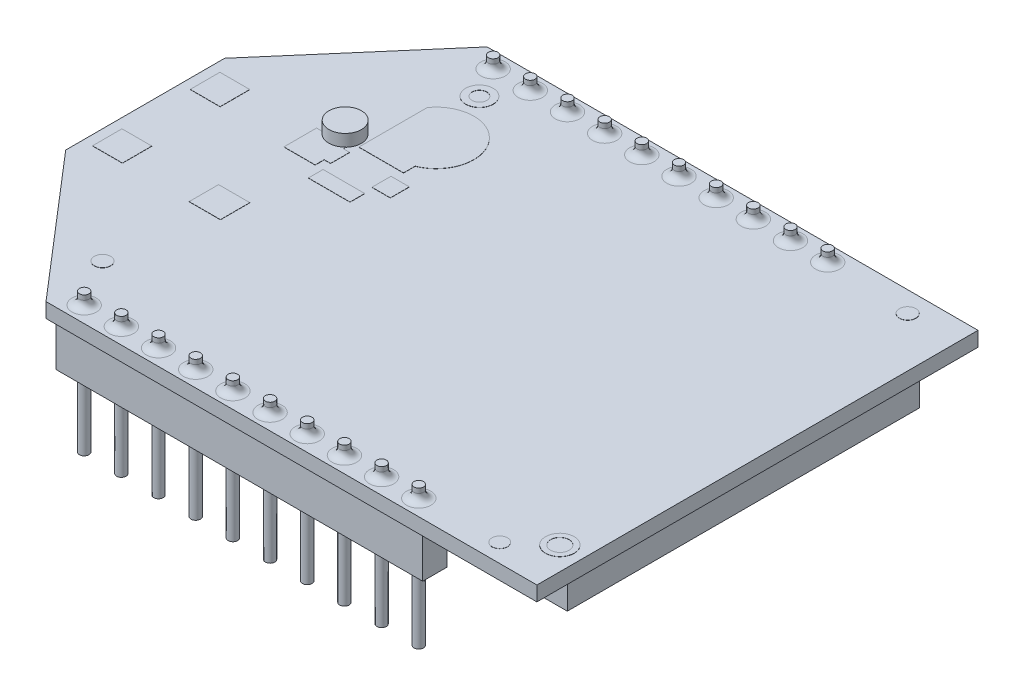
ISO-10303-21;
HEADER;
FILE_DESCRIPTION(('STEP AP214'),'2;1');
FILE_NAME('part.step','',(''),(''),'','','');
FILE_SCHEMA(('AUTOMOTIVE_DESIGN { 1 0 10303 214 1 1 1 1 }'));
ENDSEC;
DATA;
#1=APPLICATION_CONTEXT('core data for automotive mechanical design processes');
#2=APPLICATION_PROTOCOL_DEFINITION('international standard','automotive_design',2000,#1);
#3=PRODUCT_CONTEXT('',#1,'mechanical');
#4=PRODUCT('Part','Part','',(#3));
#5=PRODUCT_RELATED_PRODUCT_CATEGORY('part','',(#4));
#6=PRODUCT_DEFINITION_FORMATION('','',#4);
#7=PRODUCT_DEFINITION_CONTEXT('part definition',#1,'design');
#8=PRODUCT_DEFINITION('design','',#6,#7);
#9=PRODUCT_DEFINITION_SHAPE('','',#8);
#10=(LENGTH_UNIT() NAMED_UNIT(*) SI_UNIT(.MILLI.,.METRE.));
#11=(NAMED_UNIT(*) PLANE_ANGLE_UNIT() SI_UNIT($,.RADIAN.));
#12=(NAMED_UNIT(*) SI_UNIT($,.STERADIAN.) SOLID_ANGLE_UNIT());
#13=UNCERTAINTY_MEASURE_WITH_UNIT(LENGTH_MEASURE(1.E-05),#10,'distance_accuracy_value','');
#14=(GEOMETRIC_REPRESENTATION_CONTEXT(3) GLOBAL_UNCERTAINTY_ASSIGNED_CONTEXT((#13)) GLOBAL_UNIT_ASSIGNED_CONTEXT((#10,
#11,#12)) REPRESENTATION_CONTEXT('',''));
#15=CARTESIAN_POINT('',(0.,0.,0.));
#16=DIRECTION('',(0.,0.,1.));
#17=DIRECTION('',(1.,0.,0.));
#18=AXIS2_PLACEMENT_3D('',#15,#16,#17);
#19=CARTESIAN_POINT('',(0.,0.79,0.));
#20=DIRECTION('',(0.,-1.,0.));
#21=DIRECTION('',(0.,0.,-1.));
#22=AXIS2_PLACEMENT_3D('',#19,#20,#21);
#23=PLANE('',#22);
#24=CARTESIAN_POINT('',(17.4774211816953,0.79,-10.7508240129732));
#25=DIRECTION('',(0.,-1.,0.));
#26=DIRECTION('',(0.,0.,-1.));
#27=AXIS2_PLACEMENT_3D('',#24,#25,#26);
#28=CIRCLE('',#27,0.44215750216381);
#29=CARTESIAN_POINT('',(17.4774211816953,0.79,-11.192981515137));
#30=VERTEX_POINT('',#29);
#31=EDGE_CURVE('E69',#30,#30,#28,.F.);
#32=ORIENTED_EDGE('',*,*,#31,.F.);
#33=EDGE_LOOP('',(#32));
#34=FACE_BOUND('',#33,.T.);
#35=CARTESIAN_POINT('',(-6.61930476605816,0.79,8.46708340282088));
#36=DIRECTION('',(0.,-1.,0.));
#37=DIRECTION('',(0.,0.,-1.));
#38=AXIS2_PLACEMENT_3D('',#35,#36,#37);
#39=CIRCLE('',#38,0.439153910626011);
#40=CARTESIAN_POINT('',(-6.61930476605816,0.79,8.02792949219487));
#41=VERTEX_POINT('',#40);
#42=EDGE_CURVE('E1003',#41,#41,#39,.F.);
#43=ORIENTED_EDGE('',*,*,#42,.F.);
#44=EDGE_LOOP('',(#43));
#45=FACE_BOUND('',#44,.T.);
#46=DIRECTION('',(0.,0.,-1.));
#47=VECTOR('',#46,1.);
#48=CARTESIAN_POINT('',(-10.6501845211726,0.79,3.36487989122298));
#49=LINE('',#48,#47);
#50=CARTESIAN_POINT('',(-10.6501845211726,0.79,3.36487989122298));
#51=VERTEX_POINT('',#50);
#52=CARTESIAN_POINT('',(-10.6501845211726,0.79,1.78332849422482));
#53=VERTEX_POINT('',#52);
#54=EDGE_CURVE('E669',#51,#53,#49,.T.);
#55=ORIENTED_EDGE('',*,*,#54,.F.);
#56=DIRECTION('',(1.,0.,0.));
#57=VECTOR('',#56,1.);
#58=CARTESIAN_POINT('',(-10.6501845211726,0.79,3.36487989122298));
#59=LINE('',#58,#57);
#60=CARTESIAN_POINT('',(-12.257295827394,0.79,3.36487989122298));
#61=VERTEX_POINT('',#60);
#62=EDGE_CURVE('E674',#61,#51,#59,.T.);
#63=ORIENTED_EDGE('',*,*,#62,.F.);
#64=DIRECTION('',(0.,0.,1.));
#65=VECTOR('',#64,1.);
#66=CARTESIAN_POINT('',(-12.257295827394,0.79,3.36487989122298));
#67=LINE('',#66,#65);
#68=CARTESIAN_POINT('',(-12.257295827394,0.79,1.78332849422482));
#69=VERTEX_POINT('',#68);
#70=EDGE_CURVE('E686',#69,#61,#67,.T.);
#71=ORIENTED_EDGE('',*,*,#70,.F.);
#72=DIRECTION('',(-1.,0.,0.));
#73=VECTOR('',#72,1.);
#74=CARTESIAN_POINT('',(-10.6501845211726,0.79,1.78332849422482));
#75=LINE('',#74,#73);
#76=EDGE_CURVE('E683',#53,#69,#75,.T.);
#77=ORIENTED_EDGE('',*,*,#76,.F.);
#78=EDGE_LOOP('',(#55,#63,#71,#77));
#79=FACE_BOUND('',#78,.T.);
#80=DIRECTION('',(0.,0.,1.));
#81=VECTOR('',#80,1.);
#82=CARTESIAN_POINT('',(-2.80942936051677,0.79,-3.24273813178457));
#83=LINE('',#82,#81);
#84=CARTESIAN_POINT('',(-2.80942936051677,0.79,-3.24273813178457));
#85=VERTEX_POINT('',#84);
#86=CARTESIAN_POINT('',(-2.80942936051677,0.79,-2.22003093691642));
#87=VERTEX_POINT('',#86);
#88=EDGE_CURVE('E735',#85,#87,#83,.T.);
#89=ORIENTED_EDGE('',*,*,#88,.F.);
#90=DIRECTION('',(-1.,0.,0.));
#91=VECTOR('',#90,1.);
#92=CARTESIAN_POINT('',(-2.80942936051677,0.79,-3.24273813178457));
#93=LINE('',#92,#91);
#94=CARTESIAN_POINT('',(-1.8232474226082,0.79,-3.24273813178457));
#95=VERTEX_POINT('',#94);
#96=EDGE_CURVE('E740',#95,#85,#93,.T.);
#97=ORIENTED_EDGE('',*,*,#96,.F.);
#98=DIRECTION('',(0.,0.,-1.));
#99=VECTOR('',#98,1.);
#100=CARTESIAN_POINT('',(-1.8232474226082,0.79,-3.24273813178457));
#101=LINE('',#100,#99);
#102=CARTESIAN_POINT('',(-1.82324742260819,0.79,-2.22003093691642));
#103=VERTEX_POINT('',#102);
#104=EDGE_CURVE('E752',#103,#95,#101,.T.);
#105=ORIENTED_EDGE('',*,*,#104,.F.);
#106=DIRECTION('',(1.,0.,0.));
#107=VECTOR('',#106,1.);
#108=CARTESIAN_POINT('',(-2.80942936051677,0.79,-2.22003093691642));
#109=LINE('',#108,#107);
#110=EDGE_CURVE('E749',#87,#103,#109,.T.);
#111=ORIENTED_EDGE('',*,*,#110,.F.);
#112=EDGE_LOOP('',(#89,#97,#105,#111));
#113=FACE_BOUND('',#112,.T.);
#114=DIRECTION('',(1.,0.,0.));
#115=VECTOR('',#114,1.);
#116=CARTESIAN_POINT('',(20.1483735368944,0.79,11.865));
#117=LINE('',#116,#115);
#118=CARTESIAN_POINT('',(-6.26162646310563,0.79,11.865));
#119=VERTEX_POINT('',#118);
#120=CARTESIAN_POINT('',(20.1483735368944,0.79,11.865));
#121=VERTEX_POINT('',#120);
#122=EDGE_CURVE('E1153',#119,#121,#117,.T.);
#123=ORIENTED_EDGE('',*,*,#122,.T.);
#124=DIRECTION('',(0.,0.,-1.));
#125=VECTOR('',#124,1.);
#126=CARTESIAN_POINT('',(20.1483735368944,0.79,-0.324999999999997));
#127=LINE('',#126,#125);
#128=CARTESIAN_POINT('',(20.1483735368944,0.79,-11.865));
#129=VERTEX_POINT('',#128);
#130=EDGE_CURVE('E1156',#121,#129,#127,.T.);
#131=ORIENTED_EDGE('',*,*,#130,.T.);
#132=DIRECTION('',(-1.,0.,0.));
#133=VECTOR('',#132,1.);
#134=CARTESIAN_POINT('',(20.1483735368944,0.79,-11.865));
#135=LINE('',#134,#133);
#136=CARTESIAN_POINT('',(-6.26162646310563,0.79,-11.865));
#137=VERTEX_POINT('',#136);
#138=EDGE_CURVE('E1159',#129,#137,#135,.T.);
#139=ORIENTED_EDGE('',*,*,#138,.T.);
#140=DIRECTION('',(-0.652188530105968,0.,0.758056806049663));
#141=VECTOR('',#140,1.);
#142=CARTESIAN_POINT('',(-6.26162646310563,0.79,-11.865));
#143=LINE('',#142,#141);
#144=CARTESIAN_POINT('',(-12.7916264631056,0.79,-4.275));
#145=VERTEX_POINT('',#144);
#146=EDGE_CURVE('E1161',#137,#145,#143,.T.);
#147=ORIENTED_EDGE('',*,*,#146,.T.);
#148=DIRECTION('',(0.,0.,1.));
#149=VECTOR('',#148,1.);
#150=CARTESIAN_POINT('',(-12.7916264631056,0.79,4.275));
#151=LINE('',#150,#149);
#152=CARTESIAN_POINT('',(-12.7916264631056,0.79,4.275));
#153=VERTEX_POINT('',#152);
#154=EDGE_CURVE('E1163',#145,#153,#151,.T.);
#155=ORIENTED_EDGE('',*,*,#154,.T.);
#156=DIRECTION('',(0.652188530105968,0.,0.758056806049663));
#157=VECTOR('',#156,1.);
#158=CARTESIAN_POINT('',(-6.26162646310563,0.79,11.865));
#159=LINE('',#158,#157);
#160=EDGE_CURVE('E1165',#153,#119,#159,.T.);
#161=ORIENTED_EDGE('',*,*,#160,.T.);
#162=EDGE_LOOP('',(#123,#131,#139,#147,#155,#161));
#163=FACE_BOUND('',#162,.T.);
#164=CARTESIAN_POINT('',(12.9283735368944,0.79,11.));
#165=DIRECTION('',(0.,-1.,0.));
#166=DIRECTION('',(0.,0.,-1.));
#167=AXIS2_PLACEMENT_3D('',#164,#165,#166);
#168=CIRCLE('',#167,0.655000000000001);
#169=CARTESIAN_POINT('',(12.9283735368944,0.79,10.345));
#170=VERTEX_POINT('',#169);
#171=EDGE_CURVE('E1196',#170,#170,#168,.T.);
#172=ORIENTED_EDGE('',*,*,#171,.T.);
#173=EDGE_LOOP('',(#172));
#174=FACE_BOUND('',#173,.T.);
#175=CARTESIAN_POINT('',(10.9283735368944,0.79,11.));
#176=DIRECTION('',(0.,-1.,0.));
#177=DIRECTION('',(0.,0.,-1.));
#178=AXIS2_PLACEMENT_3D('',#175,#176,#177);
#179=CIRCLE('',#178,0.655000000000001);
#180=CARTESIAN_POINT('',(10.9283735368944,0.79,10.345));
#181=VERTEX_POINT('',#180);
#182=EDGE_CURVE('E1199',#181,#181,#179,.T.);
#183=ORIENTED_EDGE('',*,*,#182,.T.);
#184=EDGE_LOOP('',(#183));
#185=FACE_BOUND('',#184,.T.);
#186=CARTESIAN_POINT('',(8.92837353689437,0.79,11.));
#187=DIRECTION('',(0.,-1.,0.));
#188=DIRECTION('',(0.,0.,-1.));
#189=AXIS2_PLACEMENT_3D('',#186,#187,#188);
#190=CIRCLE('',#189,0.654999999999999);
#191=CARTESIAN_POINT('',(8.92837353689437,0.79,10.345));
#192=VERTEX_POINT('',#191);
#193=EDGE_CURVE('E1202',#192,#192,#190,.T.);
#194=ORIENTED_EDGE('',*,*,#193,.T.);
#195=EDGE_LOOP('',(#194));
#196=FACE_BOUND('',#195,.T.);
#197=CARTESIAN_POINT('',(6.92837353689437,0.79,11.));
#198=DIRECTION('',(0.,-1.,0.));
#199=DIRECTION('',(0.,0.,-1.));
#200=AXIS2_PLACEMENT_3D('',#197,#198,#199);
#201=CIRCLE('',#200,0.655);
#202=CARTESIAN_POINT('',(6.92837353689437,0.79,10.345));
#203=VERTEX_POINT('',#202);
#204=EDGE_CURVE('E1205',#203,#203,#201,.T.);
#205=ORIENTED_EDGE('',*,*,#204,.T.);
#206=EDGE_LOOP('',(#205));
#207=FACE_BOUND('',#206,.T.);
#208=CARTESIAN_POINT('',(4.92837353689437,0.79,11.));
#209=DIRECTION('',(0.,-1.,0.));
#210=DIRECTION('',(0.,0.,-1.));
#211=AXIS2_PLACEMENT_3D('',#208,#209,#210);
#212=CIRCLE('',#211,0.655);
#213=CARTESIAN_POINT('',(4.92837353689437,0.79,10.345));
#214=VERTEX_POINT('',#213);
#215=EDGE_CURVE('E1208',#214,#214,#212,.T.);
#216=ORIENTED_EDGE('',*,*,#215,.T.);
#217=EDGE_LOOP('',(#216));
#218=FACE_BOUND('',#217,.T.);
#219=CARTESIAN_POINT('',(2.92837353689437,0.79,11.));
#220=DIRECTION('',(0.,-1.,0.));
#221=DIRECTION('',(0.,0.,-1.));
#222=AXIS2_PLACEMENT_3D('',#219,#220,#221);
#223=CIRCLE('',#222,0.655);
#224=CARTESIAN_POINT('',(2.92837353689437,0.79,10.345));
#225=VERTEX_POINT('',#224);
#226=EDGE_CURVE('E1211',#225,#225,#223,.T.);
#227=ORIENTED_EDGE('',*,*,#226,.T.);
#228=EDGE_LOOP('',(#227));
#229=FACE_BOUND('',#228,.T.);
#230=CARTESIAN_POINT('',(0.928373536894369,0.79,11.));
#231=DIRECTION('',(0.,-1.,0.));
#232=DIRECTION('',(0.,0.,-1.));
#233=AXIS2_PLACEMENT_3D('',#230,#231,#232);
#234=CIRCLE('',#233,0.655);
#235=CARTESIAN_POINT('',(0.928373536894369,0.79,10.345));
#236=VERTEX_POINT('',#235);
#237=EDGE_CURVE('E1214',#236,#236,#234,.T.);
#238=ORIENTED_EDGE('',*,*,#237,.T.);
#239=EDGE_LOOP('',(#238));
#240=FACE_BOUND('',#239,.T.);
#241=CARTESIAN_POINT('',(-1.07162646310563,0.79,11.));
#242=DIRECTION('',(0.,-1.,0.));
#243=DIRECTION('',(0.,0.,-1.));
#244=AXIS2_PLACEMENT_3D('',#241,#242,#243);
#245=CIRCLE('',#244,0.655);
#246=CARTESIAN_POINT('',(-1.07162646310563,0.79,10.345));
#247=VERTEX_POINT('',#246);
#248=EDGE_CURVE('E1217',#247,#247,#245,.T.);
#249=ORIENTED_EDGE('',*,*,#248,.T.);
#250=EDGE_LOOP('',(#249));
#251=FACE_BOUND('',#250,.T.);
#252=CARTESIAN_POINT('',(-3.07162646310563,0.79,11.));
#253=DIRECTION('',(0.,-1.,0.));
#254=DIRECTION('',(0.,0.,-1.));
#255=AXIS2_PLACEMENT_3D('',#252,#253,#254);
#256=CIRCLE('',#255,0.655);
#257=CARTESIAN_POINT('',(-3.07162646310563,0.79,10.345));
#258=VERTEX_POINT('',#257);
#259=EDGE_CURVE('E1220',#258,#258,#256,.T.);
#260=ORIENTED_EDGE('',*,*,#259,.T.);
#261=EDGE_LOOP('',(#260));
#262=FACE_BOUND('',#261,.T.);
#263=CARTESIAN_POINT('',(-5.07162646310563,0.79,11.));
#264=DIRECTION('',(0.,-1.,0.));
#265=DIRECTION('',(0.,0.,-1.));
#266=AXIS2_PLACEMENT_3D('',#263,#264,#265);
#267=CIRCLE('',#266,0.655);
#268=CARTESIAN_POINT('',(-5.07162646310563,0.79,10.345));
#269=VERTEX_POINT('',#268);
#270=EDGE_CURVE('E1223',#269,#269,#267,.T.);
#271=ORIENTED_EDGE('',*,*,#270,.T.);
#272=EDGE_LOOP('',(#271));
#273=FACE_BOUND('',#272,.T.);
#274=CARTESIAN_POINT('',(-5.07162646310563,0.79,-11.));
#275=DIRECTION('',(0.,-1.,0.));
#276=DIRECTION('',(0.,0.,-1.));
#277=AXIS2_PLACEMENT_3D('',#274,#275,#276);
#278=CIRCLE('',#277,0.655);
#279=CARTESIAN_POINT('',(-5.07162646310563,0.79,-11.655));
#280=VERTEX_POINT('',#279);
#281=EDGE_CURVE('E1226',#280,#280,#278,.T.);
#282=ORIENTED_EDGE('',*,*,#281,.T.);
#283=EDGE_LOOP('',(#282));
#284=FACE_BOUND('',#283,.T.);
#285=CARTESIAN_POINT('',(-3.07162646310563,0.79,-11.));
#286=DIRECTION('',(0.,-1.,0.));
#287=DIRECTION('',(0.,0.,-1.));
#288=AXIS2_PLACEMENT_3D('',#285,#286,#287);
#289=CIRCLE('',#288,0.655);
#290=CARTESIAN_POINT('',(-3.07162646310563,0.79,-11.655));
#291=VERTEX_POINT('',#290);
#292=EDGE_CURVE('E1229',#291,#291,#289,.T.);
#293=ORIENTED_EDGE('',*,*,#292,.T.);
#294=EDGE_LOOP('',(#293));
#295=FACE_BOUND('',#294,.T.);
#296=CARTESIAN_POINT('',(-1.07162646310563,0.79,-11.));
#297=DIRECTION('',(0.,-1.,0.));
#298=DIRECTION('',(0.,0.,-1.));
#299=AXIS2_PLACEMENT_3D('',#296,#297,#298);
#300=CIRCLE('',#299,0.655);
#301=CARTESIAN_POINT('',(-1.07162646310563,0.79,-11.655));
#302=VERTEX_POINT('',#301);
#303=EDGE_CURVE('E1232',#302,#302,#300,.T.);
#304=ORIENTED_EDGE('',*,*,#303,.T.);
#305=EDGE_LOOP('',(#304));
#306=FACE_BOUND('',#305,.T.);
#307=CARTESIAN_POINT('',(0.928373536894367,0.79,-11.));
#308=DIRECTION('',(0.,-1.,0.));
#309=DIRECTION('',(0.,0.,-1.));
#310=AXIS2_PLACEMENT_3D('',#307,#308,#309);
#311=CIRCLE('',#310,0.655);
#312=CARTESIAN_POINT('',(0.928373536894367,0.79,-11.655));
#313=VERTEX_POINT('',#312);
#314=EDGE_CURVE('E1235',#313,#313,#311,.T.);
#315=ORIENTED_EDGE('',*,*,#314,.T.);
#316=EDGE_LOOP('',(#315));
#317=FACE_BOUND('',#316,.T.);
#318=CARTESIAN_POINT('',(2.92837353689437,0.79,-11.));
#319=DIRECTION('',(0.,-1.,0.));
#320=DIRECTION('',(0.,0.,-1.));
#321=AXIS2_PLACEMENT_3D('',#318,#319,#320);
#322=CIRCLE('',#321,0.655);
#323=CARTESIAN_POINT('',(2.92837353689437,0.79,-11.655));
#324=VERTEX_POINT('',#323);
#325=EDGE_CURVE('E1238',#324,#324,#322,.T.);
#326=ORIENTED_EDGE('',*,*,#325,.T.);
#327=EDGE_LOOP('',(#326));
#328=FACE_BOUND('',#327,.T.);
#329=CARTESIAN_POINT('',(4.92837353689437,0.79,-11.));
#330=DIRECTION('',(0.,-1.,0.));
#331=DIRECTION('',(0.,0.,-1.));
#332=AXIS2_PLACEMENT_3D('',#329,#330,#331);
#333=CIRCLE('',#332,0.655);
#334=CARTESIAN_POINT('',(4.92837353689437,0.79,-11.655));
#335=VERTEX_POINT('',#334);
#336=EDGE_CURVE('E1241',#335,#335,#333,.T.);
#337=ORIENTED_EDGE('',*,*,#336,.T.);
#338=EDGE_LOOP('',(#337));
#339=FACE_BOUND('',#338,.T.);
#340=CARTESIAN_POINT('',(6.92837353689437,0.79,-11.));
#341=DIRECTION('',(0.,-1.,0.));
#342=DIRECTION('',(0.,0.,-1.));
#343=AXIS2_PLACEMENT_3D('',#340,#341,#342);
#344=CIRCLE('',#343,0.655);
#345=CARTESIAN_POINT('',(6.92837353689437,0.79,-11.655));
#346=VERTEX_POINT('',#345);
#347=EDGE_CURVE('E1244',#346,#346,#344,.T.);
#348=ORIENTED_EDGE('',*,*,#347,.T.);
#349=EDGE_LOOP('',(#348));
#350=FACE_BOUND('',#349,.T.);
#351=CARTESIAN_POINT('',(12.9283735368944,0.79,-11.));
#352=DIRECTION('',(0.,-1.,0.));
#353=DIRECTION('',(0.,0.,-1.));
#354=AXIS2_PLACEMENT_3D('',#351,#352,#353);
#355=CIRCLE('',#354,0.655000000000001);
#356=CARTESIAN_POINT('',(12.9283735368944,0.79,-11.655));
#357=VERTEX_POINT('',#356);
#358=EDGE_CURVE('E1247',#357,#357,#355,.T.);
#359=ORIENTED_EDGE('',*,*,#358,.T.);
#360=EDGE_LOOP('',(#359));
#361=FACE_BOUND('',#360,.T.);
#362=CARTESIAN_POINT('',(10.9283735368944,0.79,-11.));
#363=DIRECTION('',(0.,-1.,0.));
#364=DIRECTION('',(0.,0.,-1.));
#365=AXIS2_PLACEMENT_3D('',#362,#363,#364);
#366=CIRCLE('',#365,0.655000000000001);
#367=CARTESIAN_POINT('',(10.9283735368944,0.79,-11.655));
#368=VERTEX_POINT('',#367);
#369=EDGE_CURVE('E1250',#368,#368,#366,.T.);
#370=ORIENTED_EDGE('',*,*,#369,.T.);
#371=EDGE_LOOP('',(#370));
#372=FACE_BOUND('',#371,.T.);
#373=CARTESIAN_POINT('',(8.92837353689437,0.79,-11.));
#374=DIRECTION('',(0.,-1.,0.));
#375=DIRECTION('',(0.,0.,-1.));
#376=AXIS2_PLACEMENT_3D('',#373,#374,#375);
#377=CIRCLE('',#376,0.654999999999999);
#378=CARTESIAN_POINT('',(8.92837353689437,0.79,-11.655));
#379=VERTEX_POINT('',#378);
#380=EDGE_CURVE('E1253',#379,#379,#377,.T.);
#381=ORIENTED_EDGE('',*,*,#380,.T.);
#382=EDGE_LOOP('',(#381));
#383=FACE_BOUND('',#382,.T.);
#384=DIRECTION('',(0.,0.,1.));
#385=VECTOR('',#384,1.);
#386=CARTESIAN_POINT('',(-12.257295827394,0.79,-3.48623984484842));
#387=LINE('',#386,#385);
#388=CARTESIAN_POINT('',(-12.257295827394,0.79,-3.48623984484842));
#389=VERTEX_POINT('',#388);
#390=CARTESIAN_POINT('',(-12.257295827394,0.79,-1.89130362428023));
#391=VERTEX_POINT('',#390);
#392=EDGE_CURVE('E855',#389,#391,#387,.T.);
#393=ORIENTED_EDGE('',*,*,#392,.F.);
#394=DIRECTION('',(-1.,0.,0.));
#395=VECTOR('',#394,1.);
#396=CARTESIAN_POINT('',(-12.257295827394,0.79,-3.48623984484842));
#397=LINE('',#396,#395);
#398=CARTESIAN_POINT('',(-10.6501845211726,0.79,-3.48623984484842));
#399=VERTEX_POINT('',#398);
#400=EDGE_CURVE('E860',#399,#389,#397,.T.);
#401=ORIENTED_EDGE('',*,*,#400,.F.);
#402=DIRECTION('',(0.,0.,-1.));
#403=VECTOR('',#402,1.);
#404=CARTESIAN_POINT('',(-10.6501845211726,0.79,-3.48623984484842));
#405=LINE('',#404,#403);
#406=CARTESIAN_POINT('',(-10.6501845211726,0.79,-1.89130362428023));
#407=VERTEX_POINT('',#406);
#408=EDGE_CURVE('E872',#407,#399,#405,.T.);
#409=ORIENTED_EDGE('',*,*,#408,.F.);
#410=DIRECTION('',(1.,0.,0.));
#411=VECTOR('',#410,1.);
#412=CARTESIAN_POINT('',(-12.257295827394,0.79,-1.89130362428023));
#413=LINE('',#412,#411);
#414=EDGE_CURVE('E869',#391,#407,#413,.T.);
#415=ORIENTED_EDGE('',*,*,#414,.F.);
#416=EDGE_LOOP('',(#393,#401,#409,#415));
#417=FACE_BOUND('',#416,.T.);
#418=DIRECTION('',(0.,0.,1.));
#419=VECTOR('',#418,1.);
#420=CARTESIAN_POINT('',(-4.95224443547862,0.79,-1.73302751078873));
#421=LINE('',#420,#419);
#422=CARTESIAN_POINT('',(-4.95224443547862,0.79,-1.73302751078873));
#423=VERTEX_POINT('',#422);
#424=CARTESIAN_POINT('',(-4.95224443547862,0.79,-0.941646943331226));
#425=VERTEX_POINT('',#424);
#426=EDGE_CURVE('E768',#423,#425,#421,.T.);
#427=ORIENTED_EDGE('',*,*,#426,.F.);
#428=DIRECTION('',(-1.,0.,0.));
#429=VECTOR('',#428,1.);
#430=CARTESIAN_POINT('',(-4.95224443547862,0.79,-1.73302751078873));
#431=LINE('',#430,#429);
#432=CARTESIAN_POINT('',(-2.71202867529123,0.79,-1.73302751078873));
#433=VERTEX_POINT('',#432);
#434=EDGE_CURVE('E773',#433,#423,#431,.T.);
#435=ORIENTED_EDGE('',*,*,#434,.F.);
#436=DIRECTION('',(0.,0.,-1.));
#437=VECTOR('',#436,1.);
#438=CARTESIAN_POINT('',(-2.71202867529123,0.79,-1.73302751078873));
#439=LINE('',#438,#437);
#440=CARTESIAN_POINT('',(-2.71202867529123,0.79,-0.941646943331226));
#441=VERTEX_POINT('',#440);
#442=EDGE_CURVE('E785',#441,#433,#439,.T.);
#443=ORIENTED_EDGE('',*,*,#442,.F.);
#444=DIRECTION('',(1.,0.,0.));
#445=VECTOR('',#444,1.);
#446=CARTESIAN_POINT('',(-4.95224443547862,0.79,-0.941646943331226));
#447=LINE('',#446,#445);
#448=EDGE_CURVE('E782',#425,#441,#447,.T.);
#449=ORIENTED_EDGE('',*,*,#448,.F.);
#450=EDGE_LOOP('',(#427,#435,#443,#449));
#451=FACE_BOUND('',#450,.T.);
#452=DIRECTION('',(0.,0.,1.));
#453=VECTOR('',#452,1.);
#454=CARTESIAN_POINT('',(-7.05853425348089,0.79,1.78332849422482));
#455=LINE('',#454,#453);
#456=CARTESIAN_POINT('',(-7.05853425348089,0.79,1.78332849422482));
#457=VERTEX_POINT('',#456);
#458=CARTESIAN_POINT('',(-7.05853425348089,0.79,3.36487989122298));
#459=VERTEX_POINT('',#458);
#460=EDGE_CURVE('E702',#457,#459,#455,.T.);
#461=ORIENTED_EDGE('',*,*,#460,.F.);
#462=DIRECTION('',(-1.,0.,0.));
#463=VECTOR('',#462,1.);
#464=CARTESIAN_POINT('',(-7.05853425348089,0.79,1.78332849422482));
#465=LINE('',#464,#463);
#466=CARTESIAN_POINT('',(-5.37837243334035,0.79,1.78332849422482));
#467=VERTEX_POINT('',#466);
#468=EDGE_CURVE('E707',#467,#457,#465,.T.);
#469=ORIENTED_EDGE('',*,*,#468,.F.);
#470=DIRECTION('',(0.,0.,-1.));
#471=VECTOR('',#470,1.);
#472=CARTESIAN_POINT('',(-5.37837243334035,0.79,1.78332849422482));
#473=LINE('',#472,#471);
#474=CARTESIAN_POINT('',(-5.37837243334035,0.79,3.36487989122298));
#475=VERTEX_POINT('',#474);
#476=EDGE_CURVE('E719',#475,#467,#473,.T.);
#477=ORIENTED_EDGE('',*,*,#476,.F.);
#478=DIRECTION('',(1.,0.,0.));
#479=VECTOR('',#478,1.);
#480=CARTESIAN_POINT('',(-7.05853425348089,0.79,3.36487989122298));
#481=LINE('',#480,#479);
#482=EDGE_CURVE('E716',#459,#475,#481,.T.);
#483=ORIENTED_EDGE('',*,*,#482,.F.);
#484=EDGE_LOOP('',(#461,#469,#477,#483));
#485=FACE_BOUND('',#484,.T.);
#486=CARTESIAN_POINT('',(-3.38207787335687,0.79,-6.24761889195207));
#487=DIRECTION('',(0.,1.,0.));
#488=DIRECTION('',(0.,0.,1.));
#489=AXIS2_PLACEMENT_3D('',#486,#487,#488);
#490=CIRCLE('',#489,2.02617108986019);
#491=CARTESIAN_POINT('',(-2.63087579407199,0.79,-4.36584719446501));
#492=VERTEX_POINT('',#491);
#493=CARTESIAN_POINT('',(-5.03539481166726,0.79,-7.41890552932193));
#494=VERTEX_POINT('',#493);
#495=EDGE_CURVE('E636',#492,#494,#490,.T.);
#496=ORIENTED_EDGE('',*,*,#495,.F.);
#497=DIRECTION('',(0.,0.,-1.));
#498=VECTOR('',#497,1.);
#499=CARTESIAN_POINT('',(-2.63087579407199,0.79,-3.73975964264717));
#500=LINE('',#499,#498);
#501=CARTESIAN_POINT('',(-2.63087579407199,0.79,-3.73975964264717));
#502=VERTEX_POINT('',#501);
#503=EDGE_CURVE('E641',#502,#492,#500,.T.);
#504=ORIENTED_EDGE('',*,*,#503,.F.);
#505=DIRECTION('',(1.,0.,0.));
#506=VECTOR('',#505,1.);
#507=CARTESIAN_POINT('',(-5.03539481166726,0.79,-3.73975964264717));
#508=LINE('',#507,#506);
#509=CARTESIAN_POINT('',(-5.03539481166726,0.79,-3.73975964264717));
#510=VERTEX_POINT('',#509);
#511=EDGE_CURVE('E653',#510,#502,#508,.T.);
#512=ORIENTED_EDGE('',*,*,#511,.F.);
#513=DIRECTION('',(0.,0.,1.));
#514=VECTOR('',#513,1.);
#515=CARTESIAN_POINT('',(-5.03539481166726,0.79,-7.41890552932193));
#516=LINE('',#515,#514);
#517=EDGE_CURVE('E650',#494,#510,#516,.T.);
#518=ORIENTED_EDGE('',*,*,#517,.F.);
#519=EDGE_LOOP('',(#496,#504,#512,#518));
#520=FACE_BOUND('',#519,.T.);
#521=CARTESIAN_POINT('',(17.1667110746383,0.79,10.883808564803));
#522=DIRECTION('',(0.,-1.,0.));
#523=DIRECTION('',(0.,0.,-1.));
#524=AXIS2_PLACEMENT_3D('',#521,#522,#523);
#525=CIRCLE('',#524,0.415562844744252);
#526=CARTESIAN_POINT('',(17.1667110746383,0.79,10.4682457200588));
#527=VERTEX_POINT('',#526);
#528=EDGE_CURVE('E1322',#527,#527,#525,.F.);
#529=ORIENTED_EDGE('',*,*,#528,.F.);
#530=EDGE_LOOP('',(#529));
#531=FACE_BOUND('',#530,.T.);
#532=CARTESIAN_POINT('',(18.9089646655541,0.79,9.39044834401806));
#533=DIRECTION('',(0.,-1.,0.));
#534=DIRECTION('',(0.,0.,-1.));
#535=AXIS2_PLACEMENT_3D('',#532,#533,#534);
#536=CIRCLE('',#535,0.769867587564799);
#537=CARTESIAN_POINT('',(18.9089646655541,0.79,8.62058075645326));
#538=VERTEX_POINT('',#537);
#539=EDGE_CURVE('E1325',#538,#538,#536,.F.);
#540=ORIENTED_EDGE('',*,*,#539,.F.);
#541=EDGE_LOOP('',(#540));
#542=FACE_BOUND('',#541,.T.);
#543=CARTESIAN_POINT('',(-4.16117214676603,0.79,-9.35308815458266));
#544=DIRECTION('',(0.,-1.,0.));
#545=DIRECTION('',(0.,0.,-1.));
#546=AXIS2_PLACEMENT_3D('',#543,#544,#545);
#547=CIRCLE('',#546,0.739333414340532);
#548=CARTESIAN_POINT('',(-4.16117214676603,0.79,-10.0924215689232));
#549=VERTEX_POINT('',#548);
#550=EDGE_CURVE('E1327',#549,#549,#547,.F.);
#551=ORIENTED_EDGE('',*,*,#550,.F.);
#552=EDGE_LOOP('',(#551));
#553=FACE_BOUND('',#552,.T.);
#554=CARTESIAN_POINT('',(-6.02162646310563,0.79,-3.98500000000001));
#555=DIRECTION('',(0.,1.,0.));
#556=DIRECTION('',(-1.,0.,0.));
#557=AXIS2_PLACEMENT_3D('',#554,#555,#556);
#558=CIRCLE('',#557,0.875);
#559=CARTESIAN_POINT('',(-5.37837243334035,0.79,-3.39183117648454));
#560=VERTEX_POINT('',#559);
#561=CARTESIAN_POINT('',(-6.74055852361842,0.79,-3.48623984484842));
#562=VERTEX_POINT('',#561);
#563=EDGE_CURVE('E76',#560,#562,#558,.T.);
#564=ORIENTED_EDGE('',*,*,#563,.F.);
#565=DIRECTION('',(0.,0.,-1.));
#566=VECTOR('',#565,1.);
#567=CARTESIAN_POINT('',(-5.37837243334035,0.79,-3.48623984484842));
#568=LINE('',#567,#566);
#569=CARTESIAN_POINT('',(-5.37837243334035,0.79,-3.24273813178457));
#570=VERTEX_POINT('',#569);
#571=EDGE_CURVE('E397',#570,#560,#568,.T.);
#572=ORIENTED_EDGE('',*,*,#571,.F.);
#573=DIRECTION('',(-1.,0.,0.));
#574=VECTOR('',#573,1.);
#575=CARTESIAN_POINT('',(-5.03539481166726,0.79,-3.24273813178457));
#576=LINE('',#575,#574);
#577=CARTESIAN_POINT('',(-5.03539481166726,0.79,-3.24273813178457));
#578=VERTEX_POINT('',#577);
#579=EDGE_CURVE('E831',#578,#570,#576,.T.);
#580=ORIENTED_EDGE('',*,*,#579,.F.);
#581=DIRECTION('',(0.,0.,-1.));
#582=VECTOR('',#581,1.);
#583=CARTESIAN_POINT('',(-5.03539481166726,0.79,-2.22003093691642));
#584=LINE('',#583,#582);
#585=CARTESIAN_POINT('',(-5.03539481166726,0.79,-2.22003093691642));
#586=VERTEX_POINT('',#585);
#587=EDGE_CURVE('E828',#586,#578,#584,.T.);
#588=ORIENTED_EDGE('',*,*,#587,.F.);
#589=DIRECTION('',(1.,0.,0.));
#590=VECTOR('',#589,1.);
#591=CARTESIAN_POINT('',(-5.03539481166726,0.79,-2.22003093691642));
#592=LINE('',#591,#590);
#593=CARTESIAN_POINT('',(-5.37837243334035,0.79,-2.22003093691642));
#594=VERTEX_POINT('',#593);
#595=EDGE_CURVE('E825',#594,#586,#592,.T.);
#596=ORIENTED_EDGE('',*,*,#595,.F.);
#597=DIRECTION('',(0.,0.,-1.));
#598=VECTOR('',#597,1.);
#599=CARTESIAN_POINT('',(-5.37837243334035,0.79,-2.22003093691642));
#600=LINE('',#599,#598);
#601=CARTESIAN_POINT('',(-5.37837243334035,0.79,-1.73302751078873));
#602=VERTEX_POINT('',#601);
#603=EDGE_CURVE('E822',#602,#594,#600,.T.);
#604=ORIENTED_EDGE('',*,*,#603,.F.);
#605=DIRECTION('',(1.,0.,0.));
#606=VECTOR('',#605,1.);
#607=CARTESIAN_POINT('',(-7.05853425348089,0.79,-1.73302751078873));
#608=LINE('',#607,#606);
#609=CARTESIAN_POINT('',(-7.05853425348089,0.79,-1.73302751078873));
#610=VERTEX_POINT('',#609);
#611=EDGE_CURVE('E819',#610,#602,#608,.T.);
#612=ORIENTED_EDGE('',*,*,#611,.F.);
#613=DIRECTION('',(0.,0.,1.));
#614=VECTOR('',#613,1.);
#615=CARTESIAN_POINT('',(-7.05853425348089,0.79,-3.48623984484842));
#616=LINE('',#615,#614);
#617=CARTESIAN_POINT('',(-7.05853425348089,0.79,-3.48623984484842));
#618=VERTEX_POINT('',#617);
#619=EDGE_CURVE('E801',#618,#610,#616,.T.);
#620=ORIENTED_EDGE('',*,*,#619,.F.);
#621=DIRECTION('',(-1.,0.,0.));
#622=VECTOR('',#621,1.);
#623=CARTESIAN_POINT('',(-7.05853425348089,0.79,-3.48623984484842));
#624=LINE('',#623,#622);
#625=EDGE_CURVE('E806',#562,#618,#624,.T.);
#626=ORIENTED_EDGE('',*,*,#625,.F.);
#627=EDGE_LOOP('',(#564,#572,#580,#588,#596,#604,#612,#620,#626));
#628=FACE_BOUND('',#627,.T.);
#629=ADVANCED_FACE('F55',(#34,#45,#79,#113,#163,#174,#185,#196,#207,#218,#229,#240,#251,#262,
#273,#284,#295,#306,#317,#328,#339,#350,#361,#372,#383,#417,#451,#485,#520,#531,#542,#553,#628),
#23,.F.);
#630=CARTESIAN_POINT('',(0.,0.,0.));
#631=DIRECTION('',(0.,-1.,0.));
#632=DIRECTION('',(0.,0.,-1.));
#633=AXIS2_PLACEMENT_3D('',#630,#631,#632);
#634=PLANE('',#633);
#635=DIRECTION('',(1.,0.,0.));
#636=VECTOR('',#635,1.);
#637=CARTESIAN_POINT('',(13.7909974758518,0.,10.3473979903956));
#638=LINE('',#637,#636);
#639=CARTESIAN_POINT('',(-5.93425040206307,0.,10.3473979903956));
#640=VERTEX_POINT('',#639);
#641=CARTESIAN_POINT('',(13.7909974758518,0.,10.3473979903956));
#642=VERTEX_POINT('',#641);
#643=EDGE_CURVE('E959',#640,#642,#638,.T.);
#644=ORIENTED_EDGE('',*,*,#643,.F.);
#645=DIRECTION('',(0.,0.,-1.));
#646=VECTOR('',#645,1.);
#647=CARTESIAN_POINT('',(-5.93425040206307,0.,10.3473979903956));
#648=LINE('',#647,#646);
#649=CARTESIAN_POINT('',(-5.93425040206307,0.,11.6526020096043));
#650=VERTEX_POINT('',#649);
#651=EDGE_CURVE('E945',#650,#640,#648,.T.);
#652=ORIENTED_EDGE('',*,*,#651,.F.);
#653=DIRECTION('',(-1.,0.,0.));
#654=VECTOR('',#653,1.);
#655=CARTESIAN_POINT('',(13.7909974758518,0.,11.6526020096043));
#656=LINE('',#655,#654);
#657=CARTESIAN_POINT('',(13.7909974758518,0.,11.6526020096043));
#658=VERTEX_POINT('',#657);
#659=EDGE_CURVE('E950',#658,#650,#656,.T.);
#660=ORIENTED_EDGE('',*,*,#659,.F.);
#661=DIRECTION('',(0.,0.,1.));
#662=VECTOR('',#661,1.);
#663=CARTESIAN_POINT('',(13.7909974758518,0.,10.3473979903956));
#664=LINE('',#663,#662);
#665=EDGE_CURVE('E961',#642,#658,#664,.T.);
#666=ORIENTED_EDGE('',*,*,#665,.F.);
#667=EDGE_LOOP('',(#644,#652,#660,#666));
#668=FACE_BOUND('',#667,.T.);
#669=DIRECTION('',(1.,0.,0.));
#670=VECTOR('',#669,1.);
#671=CARTESIAN_POINT('',(20.1483735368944,0.,11.865));
#672=LINE('',#671,#670);
#673=CARTESIAN_POINT('',(-6.26162646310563,0.,11.865));
#674=VERTEX_POINT('',#673);
#675=CARTESIAN_POINT('',(20.1483735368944,0.,11.865));
#676=VERTEX_POINT('',#675);
#677=EDGE_CURVE('E1152',#674,#676,#672,.T.);
#678=ORIENTED_EDGE('',*,*,#677,.F.);
#679=DIRECTION('',(0.652188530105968,0.,0.758056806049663));
#680=VECTOR('',#679,1.);
#681=CARTESIAN_POINT('',(-6.26162646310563,0.,11.865));
#682=LINE('',#681,#680);
#683=CARTESIAN_POINT('',(-12.7916264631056,0.,4.275));
#684=VERTEX_POINT('',#683);
#685=EDGE_CURVE('E1157',#684,#674,#682,.T.);
#686=ORIENTED_EDGE('',*,*,#685,.F.);
#687=DIRECTION('',(0.,0.,1.));
#688=VECTOR('',#687,1.);
#689=CARTESIAN_POINT('',(-12.7916264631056,0.,4.275));
#690=LINE('',#689,#688);
#691=CARTESIAN_POINT('',(-12.7916264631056,0.,-4.275));
#692=VERTEX_POINT('',#691);
#693=EDGE_CURVE('E1176',#692,#684,#690,.T.);
#694=ORIENTED_EDGE('',*,*,#693,.F.);
#695=DIRECTION('',(-0.652188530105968,0.,0.758056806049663));
#696=VECTOR('',#695,1.);
#697=CARTESIAN_POINT('',(-6.26162646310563,0.,-11.865));
#698=LINE('',#697,#696);
#699=CARTESIAN_POINT('',(-6.26162646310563,0.,-11.865));
#700=VERTEX_POINT('',#699);
#701=EDGE_CURVE('E1174',#700,#692,#698,.T.);
#702=ORIENTED_EDGE('',*,*,#701,.F.);
#703=DIRECTION('',(-1.,0.,0.));
#704=VECTOR('',#703,1.);
#705=CARTESIAN_POINT('',(20.1483735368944,0.,-11.865));
#706=LINE('',#705,#704);
#707=CARTESIAN_POINT('',(20.1483735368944,0.,-11.865));
#708=VERTEX_POINT('',#707);
#709=EDGE_CURVE('E1172',#708,#700,#706,.T.);
#710=ORIENTED_EDGE('',*,*,#709,.F.);
#711=DIRECTION('',(0.,0.,-1.));
#712=VECTOR('',#711,1.);
#713=CARTESIAN_POINT('',(20.1483735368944,0.,-0.324999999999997));
#714=LINE('',#713,#712);
#715=EDGE_CURVE('E1170',#676,#708,#714,.T.);
#716=ORIENTED_EDGE('',*,*,#715,.F.);
#717=EDGE_LOOP('',(#678,#686,#694,#702,#710,#716));
#718=FACE_BOUND('',#717,.T.);
#719=DIRECTION('',(1.,0.,0.));
#720=VECTOR('',#719,1.);
#721=CARTESIAN_POINT('',(19.3983735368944,0.,-9.48));
#722=LINE('',#721,#720);
#723=CARTESIAN_POINT('',(-5.90334164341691,0.,-9.48));
#724=VERTEX_POINT('',#723);
#725=CARTESIAN_POINT('',(19.3983735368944,0.,-9.48));
#726=VERTEX_POINT('',#725);
#727=EDGE_CURVE('E1017',#724,#726,#722,.T.);
#728=ORIENTED_EDGE('',*,*,#727,.F.);
#729=DIRECTION('',(0.,0.,-1.));
#730=VECTOR('',#729,1.);
#731=CARTESIAN_POINT('',(-5.90334164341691,0.,-9.48));
#732=LINE('',#731,#730);
#733=CARTESIAN_POINT('',(-5.90334164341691,0.,9.48));
#734=VERTEX_POINT('',#733);
#735=EDGE_CURVE('E974',#734,#724,#732,.T.);
#736=ORIENTED_EDGE('',*,*,#735,.F.);
#737=DIRECTION('',(-1.,0.,0.));
#738=VECTOR('',#737,1.);
#739=CARTESIAN_POINT('',(19.3983735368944,0.,9.48));
#740=LINE('',#739,#738);
#741=CARTESIAN_POINT('',(19.3983735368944,0.,9.48));
#742=VERTEX_POINT('',#741);
#743=EDGE_CURVE('E1008',#742,#734,#740,.T.);
#744=ORIENTED_EDGE('',*,*,#743,.F.);
#745=DIRECTION('',(0.,0.,1.));
#746=VECTOR('',#745,1.);
#747=CARTESIAN_POINT('',(19.3983735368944,0.,-9.48));
#748=LINE('',#747,#746);
#749=EDGE_CURVE('E1019',#726,#742,#748,.T.);
#750=ORIENTED_EDGE('',*,*,#749,.F.);
#751=EDGE_LOOP('',(#728,#736,#744,#750));
#752=FACE_BOUND('',#751,.T.);
#753=DIRECTION('',(-1.,0.,0.));
#754=VECTOR('',#753,1.);
#755=CARTESIAN_POINT('',(13.7909974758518,0.,-10.3473979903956));
#756=LINE('',#755,#754);
#757=CARTESIAN_POINT('',(13.7909974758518,0.,-10.3473979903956));
#758=VERTEX_POINT('',#757);
#759=CARTESIAN_POINT('',(-5.93425040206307,0.,-10.3473979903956));
#760=VERTEX_POINT('',#759);
#761=EDGE_CURVE('E902',#758,#760,#756,.T.);
#762=ORIENTED_EDGE('',*,*,#761,.F.);
#763=DIRECTION('',(0.,0.,1.));
#764=VECTOR('',#763,1.);
#765=CARTESIAN_POINT('',(13.7909974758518,0.,-10.3473979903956));
#766=LINE('',#765,#764);
#767=CARTESIAN_POINT('',(13.7909974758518,0.,-11.6526020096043));
#768=VERTEX_POINT('',#767);
#769=EDGE_CURVE('E888',#768,#758,#766,.T.);
#770=ORIENTED_EDGE('',*,*,#769,.F.);
#771=DIRECTION('',(1.,0.,0.));
#772=VECTOR('',#771,1.);
#773=CARTESIAN_POINT('',(13.7909974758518,0.,-11.6526020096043));
#774=LINE('',#773,#772);
#775=CARTESIAN_POINT('',(-5.93425040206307,0.,-11.6526020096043));
#776=VERTEX_POINT('',#775);
#777=EDGE_CURVE('E893',#776,#768,#774,.T.);
#778=ORIENTED_EDGE('',*,*,#777,.F.);
#779=DIRECTION('',(0.,0.,-1.));
#780=VECTOR('',#779,1.);
#781=CARTESIAN_POINT('',(-5.93425040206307,0.,-10.3473979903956));
#782=LINE('',#781,#780);
#783=EDGE_CURVE('E904',#760,#776,#782,.T.);
#784=ORIENTED_EDGE('',*,*,#783,.F.);
#785=EDGE_LOOP('',(#762,#770,#778,#784));
#786=FACE_BOUND('',#785,.T.);
#787=ADVANCED_FACE('F599',(#668,#718,#752,#786),#634,.T.);
#788=CARTESIAN_POINT('',(20.1483735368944,0.79,11.865));
#789=DIRECTION('',(0.,0.,-1.));
#790=DIRECTION('',(-1.,0.,0.));
#791=AXIS2_PLACEMENT_3D('',#788,#789,#790);
#792=PLANE('',#791);
#793=ORIENTED_EDGE('',*,*,#677,.T.);
#794=DIRECTION('',(0.,-1.,0.));
#795=VECTOR('',#794,1.);
#796=CARTESIAN_POINT('',(20.1483735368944,0.79,11.865));
#797=LINE('',#796,#795);
#798=EDGE_CURVE('E1193',#121,#676,#797,.T.);
#799=ORIENTED_EDGE('',*,*,#798,.F.);
#800=ORIENTED_EDGE('',*,*,#122,.F.);
#801=DIRECTION('',(0.,-1.,0.));
#802=VECTOR('',#801,1.);
#803=CARTESIAN_POINT('',(-6.26162646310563,0.79,11.865));
#804=LINE('',#803,#802);
#805=EDGE_CURVE('E1167',#119,#674,#804,.T.);
#806=ORIENTED_EDGE('',*,*,#805,.T.);
#807=EDGE_LOOP('',(#793,#799,#800,#806));
#808=FACE_BOUND('',#807,.T.);
#809=ADVANCED_FACE('F604',(#808),#792,.F.);
#810=CARTESIAN_POINT('',(20.1483735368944,0.79,-0.324999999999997));
#811=DIRECTION('',(-1.,0.,0.));
#812=DIRECTION('',(0.,0.,1.));
#813=AXIS2_PLACEMENT_3D('',#810,#811,#812);
#814=PLANE('',#813);
#815=ORIENTED_EDGE('',*,*,#715,.T.);
#816=DIRECTION('',(0.,-1.,0.));
#817=VECTOR('',#816,1.);
#818=CARTESIAN_POINT('',(20.1483735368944,0.79,-11.865));
#819=LINE('',#818,#817);
#820=EDGE_CURVE('E1190',#129,#708,#819,.T.);
#821=ORIENTED_EDGE('',*,*,#820,.F.);
#822=ORIENTED_EDGE('',*,*,#130,.F.);
#823=ORIENTED_EDGE('',*,*,#798,.T.);
#824=EDGE_LOOP('',(#815,#821,#822,#823));
#825=FACE_BOUND('',#824,.T.);
#826=ADVANCED_FACE('F2901',(#825),#814,.F.);
#827=CARTESIAN_POINT('',(20.1483735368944,0.79,-11.865));
#828=DIRECTION('',(0.,0.,1.));
#829=DIRECTION('',(1.,0.,0.));
#830=AXIS2_PLACEMENT_3D('',#827,#828,#829);
#831=PLANE('',#830);
#832=ORIENTED_EDGE('',*,*,#709,.T.);
#833=DIRECTION('',(0.,-1.,0.));
#834=VECTOR('',#833,1.);
#835=CARTESIAN_POINT('',(-6.26162646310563,0.79,-11.865));
#836=LINE('',#835,#834);
#837=EDGE_CURVE('E1187',#137,#700,#836,.T.);
#838=ORIENTED_EDGE('',*,*,#837,.F.);
#839=ORIENTED_EDGE('',*,*,#138,.F.);
#840=ORIENTED_EDGE('',*,*,#820,.T.);
#841=EDGE_LOOP('',(#832,#838,#839,#840));
#842=FACE_BOUND('',#841,.T.);
#843=ADVANCED_FACE('F2891',(#842),#831,.F.);
#844=CARTESIAN_POINT('',(-6.26162646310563,0.79,-11.865));
#845=DIRECTION('',(0.758056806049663,0.,0.652188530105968));
#846=DIRECTION('',(0.652188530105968,0.,-0.758056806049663));
#847=AXIS2_PLACEMENT_3D('',#844,#845,#846);
#848=PLANE('',#847);
#849=ORIENTED_EDGE('',*,*,#701,.T.);
#850=DIRECTION('',(0.,-1.,0.));
#851=VECTOR('',#850,1.);
#852=CARTESIAN_POINT('',(-12.7916264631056,0.79,-4.275));
#853=LINE('',#852,#851);
#854=EDGE_CURVE('E1184',#145,#692,#853,.T.);
#855=ORIENTED_EDGE('',*,*,#854,.F.);
#856=ORIENTED_EDGE('',*,*,#146,.F.);
#857=ORIENTED_EDGE('',*,*,#837,.T.);
#858=EDGE_LOOP('',(#849,#855,#856,#857));
#859=FACE_BOUND('',#858,.T.);
#860=ADVANCED_FACE('F2881',(#859),#848,.F.);
#861=CARTESIAN_POINT('',(-12.7916264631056,0.79,4.275));
#862=DIRECTION('',(1.,0.,0.));
#863=DIRECTION('',(0.,0.,-1.));
#864=AXIS2_PLACEMENT_3D('',#861,#862,#863);
#865=PLANE('',#864);
#866=ORIENTED_EDGE('',*,*,#693,.T.);
#867=DIRECTION('',(0.,-1.,0.));
#868=VECTOR('',#867,1.);
#869=CARTESIAN_POINT('',(-12.7916264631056,0.79,4.275));
#870=LINE('',#869,#868);
#871=EDGE_CURVE('E1181',#153,#684,#870,.T.);
#872=ORIENTED_EDGE('',*,*,#871,.F.);
#873=ORIENTED_EDGE('',*,*,#154,.F.);
#874=ORIENTED_EDGE('',*,*,#854,.T.);
#875=EDGE_LOOP('',(#866,#872,#873,#874));
#876=FACE_BOUND('',#875,.T.);
#877=ADVANCED_FACE('F1766',(#876),#865,.F.);
#878=CARTESIAN_POINT('',(-6.26162646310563,0.79,11.865));
#879=DIRECTION('',(0.758056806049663,0.,-0.652188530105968));
#880=DIRECTION('',(-0.652188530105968,0.,-0.758056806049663));
#881=AXIS2_PLACEMENT_3D('',#878,#879,#880);
#882=PLANE('',#881);
#883=ORIENTED_EDGE('',*,*,#685,.T.);
#884=ORIENTED_EDGE('',*,*,#805,.F.);
#885=ORIENTED_EDGE('',*,*,#160,.F.);
#886=ORIENTED_EDGE('',*,*,#871,.T.);
#887=EDGE_LOOP('',(#883,#884,#885,#886));
#888=FACE_BOUND('',#887,.T.);
#889=ADVANCED_FACE('F1761',(#888),#882,.F.);
#890=CARTESIAN_POINT('',(-5.07162646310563,-6.06,-11.));
#891=DIRECTION('',(0.,1.,0.));
#892=DIRECTION('',(0.,0.,1.));
#893=AXIS2_PLACEMENT_3D('',#890,#891,#892);
#894=CYLINDRICAL_SURFACE('',#893,0.255);
#895=CARTESIAN_POINT('',(-5.07162646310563,1.19,-11.));
#896=DIRECTION('',(0.,-1.,0.));
#897=DIRECTION('',(0.,0.,-1.));
#898=AXIS2_PLACEMENT_3D('',#895,#896,#897);
#899=CIRCLE('',#898,0.255);
#900=CARTESIAN_POINT('',(-5.07162646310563,1.19,-11.255));
#901=VERTEX_POINT('',#900);
#902=EDGE_CURVE('E1283',#901,#901,#899,.F.);
#903=ORIENTED_EDGE('',*,*,#902,.T.);
#904=EDGE_LOOP('',(#903));
#905=FACE_BOUND('',#904,.T.);
#906=CARTESIAN_POINT('',(-5.07162646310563,1.44,-11.));
#907=DIRECTION('',(0.,1.,0.));
#908=DIRECTION('',(0.,0.,1.));
#909=AXIS2_PLACEMENT_3D('',#906,#907,#908);
#910=CIRCLE('',#909,0.255);
#911=CARTESIAN_POINT('',(-5.07162646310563,1.44,-10.745));
#912=VERTEX_POINT('',#911);
#913=EDGE_CURVE('E1146',#912,#912,#910,.T.);
#914=ORIENTED_EDGE('',*,*,#913,.F.);
#915=EDGE_LOOP('',(#914));
#916=FACE_BOUND('',#915,.T.);
#917=ADVANCED_FACE('F1751',(#905,#916),#894,.T.);
#918=CARTESIAN_POINT('',(-5.07162646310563,1.44,-11.));
#919=DIRECTION('',(0.,1.,0.));
#920=DIRECTION('',(0.,0.,1.));
#921=AXIS2_PLACEMENT_3D('',#918,#919,#920);
#922=PLANE('',#921);
#923=ORIENTED_EDGE('',*,*,#913,.T.);
#924=EDGE_LOOP('',(#923));
#925=FACE_BOUND('',#924,.T.);
#926=ADVANCED_FACE('F1748',(#925),#922,.T.);
#927=CARTESIAN_POINT('',(12.9283735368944,-6.06,11.));
#928=DIRECTION('',(0.,1.,0.));
#929=DIRECTION('',(0.,0.,1.));
#930=AXIS2_PLACEMENT_3D('',#927,#928,#929);
#931=CYLINDRICAL_SURFACE('',#930,0.255000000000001);
#932=CARTESIAN_POINT('',(12.9283735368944,1.19,11.));
#933=DIRECTION('',(0.,-1.,0.));
#934=DIRECTION('',(0.,0.,-1.));
#935=AXIS2_PLACEMENT_3D('',#932,#933,#934);
#936=CIRCLE('',#935,0.255000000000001);
#937=CARTESIAN_POINT('',(12.9283735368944,1.19,10.745));
#938=VERTEX_POINT('',#937);
#939=EDGE_CURVE('E1313',#938,#938,#936,.F.);
#940=ORIENTED_EDGE('',*,*,#939,.T.);
#941=EDGE_LOOP('',(#940));
#942=FACE_BOUND('',#941,.T.);
#943=CARTESIAN_POINT('',(12.9283735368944,1.44,11.));
#944=DIRECTION('',(0.,1.,0.));
#945=DIRECTION('',(0.,0.,-1.));
#946=AXIS2_PLACEMENT_3D('',#943,#944,#945);
#947=CIRCLE('',#946,0.255000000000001);
#948=CARTESIAN_POINT('',(12.9283735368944,1.44,10.745));
#949=VERTEX_POINT('',#948);
#950=EDGE_CURVE('E1140',#949,#949,#947,.T.);
#951=ORIENTED_EDGE('',*,*,#950,.F.);
#952=EDGE_LOOP('',(#951));
#953=FACE_BOUND('',#952,.T.);
#954=ADVANCED_FACE('F1740',(#942,#953),#931,.T.);
#955=CARTESIAN_POINT('',(12.9283735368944,1.44,11.));
#956=DIRECTION('',(0.,-1.,0.));
#957=DIRECTION('',(0.,0.,-1.));
#958=AXIS2_PLACEMENT_3D('',#955,#956,#957);
#959=PLANE('',#958);
#960=ORIENTED_EDGE('',*,*,#950,.T.);
#961=EDGE_LOOP('',(#960));
#962=FACE_BOUND('',#961,.T.);
#963=ADVANCED_FACE('F1737',(#962),#959,.F.);
#964=CARTESIAN_POINT('',(-3.07162646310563,-6.06,-11.));
#965=DIRECTION('',(0.,1.,0.));
#966=DIRECTION('',(0.,0.,1.));
#967=AXIS2_PLACEMENT_3D('',#964,#965,#966);
#968=CYLINDRICAL_SURFACE('',#967,0.255);
#969=CARTESIAN_POINT('',(-3.07162646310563,1.19,-11.));
#970=DIRECTION('',(0.,-1.,0.));
#971=DIRECTION('',(0.,0.,-1.));
#972=AXIS2_PLACEMENT_3D('',#969,#970,#971);
#973=CIRCLE('',#972,0.255);
#974=CARTESIAN_POINT('',(-3.07162646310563,1.19,-11.255));
#975=VERTEX_POINT('',#974);
#976=EDGE_CURVE('E1280',#975,#975,#973,.F.);
#977=ORIENTED_EDGE('',*,*,#976,.T.);
#978=EDGE_LOOP('',(#977));
#979=FACE_BOUND('',#978,.T.);
#980=CARTESIAN_POINT('',(-3.07162646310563,1.44,-11.));
#981=DIRECTION('',(0.,1.,0.));
#982=DIRECTION('',(0.,0.,1.));
#983=AXIS2_PLACEMENT_3D('',#980,#981,#982);
#984=CIRCLE('',#983,0.255);
#985=CARTESIAN_POINT('',(-3.07162646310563,1.44,-10.745));
#986=VERTEX_POINT('',#985);
#987=EDGE_CURVE('E1134',#986,#986,#984,.T.);
#988=ORIENTED_EDGE('',*,*,#987,.F.);
#989=EDGE_LOOP('',(#988));
#990=FACE_BOUND('',#989,.T.);
#991=ADVANCED_FACE('F1727',(#979,#990),#968,.T.);
#992=CARTESIAN_POINT('',(-3.07162646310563,1.44,-11.));
#993=DIRECTION('',(0.,1.,0.));
#994=DIRECTION('',(0.,0.,1.));
#995=AXIS2_PLACEMENT_3D('',#992,#993,#994);
#996=PLANE('',#995);
#997=ORIENTED_EDGE('',*,*,#987,.T.);
#998=EDGE_LOOP('',(#997));
#999=FACE_BOUND('',#998,.T.);
#1000=ADVANCED_FACE('F1724',(#999),#996,.T.);
#1001=CARTESIAN_POINT('',(-1.07162646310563,-6.06,-11.));
#1002=DIRECTION('',(0.,1.,0.));
#1003=DIRECTION('',(0.,0.,1.));
#1004=AXIS2_PLACEMENT_3D('',#1001,#1002,#1003);
#1005=CYLINDRICAL_SURFACE('',#1004,0.255);
#1006=CARTESIAN_POINT('',(-1.07162646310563,1.19,-11.));
#1007=DIRECTION('',(0.,-1.,0.));
#1008=DIRECTION('',(0.,0.,-1.));
#1009=AXIS2_PLACEMENT_3D('',#1006,#1007,#1008);
#1010=CIRCLE('',#1009,0.255);
#1011=CARTESIAN_POINT('',(-1.07162646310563,1.19,-11.255));
#1012=VERTEX_POINT('',#1011);
#1013=EDGE_CURVE('E1277',#1012,#1012,#1010,.F.);
#1014=ORIENTED_EDGE('',*,*,#1013,.T.);
#1015=EDGE_LOOP('',(#1014));
#1016=FACE_BOUND('',#1015,.T.);
#1017=CARTESIAN_POINT('',(-1.07162646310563,1.44,-11.));
#1018=DIRECTION('',(0.,1.,0.));
#1019=DIRECTION('',(0.,0.,1.));
#1020=AXIS2_PLACEMENT_3D('',#1017,#1018,#1019);
#1021=CIRCLE('',#1020,0.255);
#1022=CARTESIAN_POINT('',(-1.07162646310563,1.44,-10.745));
#1023=VERTEX_POINT('',#1022);
#1024=EDGE_CURVE('E1128',#1023,#1023,#1021,.T.);
#1025=ORIENTED_EDGE('',*,*,#1024,.F.);
#1026=EDGE_LOOP('',(#1025));
#1027=FACE_BOUND('',#1026,.T.);
#1028=ADVANCED_FACE('F1714',(#1016,#1027),#1005,.T.);
#1029=CARTESIAN_POINT('',(-1.07162646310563,1.44,-11.));
#1030=DIRECTION('',(0.,1.,0.));
#1031=DIRECTION('',(0.,0.,1.));
#1032=AXIS2_PLACEMENT_3D('',#1029,#1030,#1031);
#1033=PLANE('',#1032);
#1034=ORIENTED_EDGE('',*,*,#1024,.T.);
#1035=EDGE_LOOP('',(#1034));
#1036=FACE_BOUND('',#1035,.T.);
#1037=ADVANCED_FACE('F1711',(#1036),#1033,.T.);
#1038=CARTESIAN_POINT('',(0.928373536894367,-6.06,-11.));
#1039=DIRECTION('',(0.,1.,0.));
#1040=DIRECTION('',(0.,0.,1.));
#1041=AXIS2_PLACEMENT_3D('',#1038,#1039,#1040);
#1042=CYLINDRICAL_SURFACE('',#1041,0.255);
#1043=CARTESIAN_POINT('',(0.928373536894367,1.19,-11.));
#1044=DIRECTION('',(0.,-1.,0.));
#1045=DIRECTION('',(0.,0.,-1.));
#1046=AXIS2_PLACEMENT_3D('',#1043,#1044,#1045);
#1047=CIRCLE('',#1046,0.255);
#1048=CARTESIAN_POINT('',(0.928373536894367,1.19,-11.255));
#1049=VERTEX_POINT('',#1048);
#1050=EDGE_CURVE('E1274',#1049,#1049,#1047,.F.);
#1051=ORIENTED_EDGE('',*,*,#1050,.T.);
#1052=EDGE_LOOP('',(#1051));
#1053=FACE_BOUND('',#1052,.T.);
#1054=CARTESIAN_POINT('',(0.928373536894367,1.44,-11.));
#1055=DIRECTION('',(0.,1.,0.));
#1056=DIRECTION('',(0.,0.,1.));
#1057=AXIS2_PLACEMENT_3D('',#1054,#1055,#1056);
#1058=CIRCLE('',#1057,0.255);
#1059=CARTESIAN_POINT('',(0.928373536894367,1.44,-10.745));
#1060=VERTEX_POINT('',#1059);
#1061=EDGE_CURVE('E1122',#1060,#1060,#1058,.T.);
#1062=ORIENTED_EDGE('',*,*,#1061,.F.);
#1063=EDGE_LOOP('',(#1062));
#1064=FACE_BOUND('',#1063,.T.);
#1065=ADVANCED_FACE('F1701',(#1053,#1064),#1042,.T.);
#1066=CARTESIAN_POINT('',(0.928373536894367,1.44,-11.));
#1067=DIRECTION('',(0.,1.,0.));
#1068=DIRECTION('',(0.,0.,1.));
#1069=AXIS2_PLACEMENT_3D('',#1066,#1067,#1068);
#1070=PLANE('',#1069);
#1071=ORIENTED_EDGE('',*,*,#1061,.T.);
#1072=EDGE_LOOP('',(#1071));
#1073=FACE_BOUND('',#1072,.T.);
#1074=ADVANCED_FACE('F1698',(#1073),#1070,.T.);
#1075=CARTESIAN_POINT('',(2.92837353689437,-6.06,-11.));
#1076=DIRECTION('',(0.,1.,0.));
#1077=DIRECTION('',(0.,0.,1.));
#1078=AXIS2_PLACEMENT_3D('',#1075,#1076,#1077);
#1079=CYLINDRICAL_SURFACE('',#1078,0.255);
#1080=CARTESIAN_POINT('',(2.92837353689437,1.19,-11.));
#1081=DIRECTION('',(0.,-1.,0.));
#1082=DIRECTION('',(0.,0.,-1.));
#1083=AXIS2_PLACEMENT_3D('',#1080,#1081,#1082);
#1084=CIRCLE('',#1083,0.255);
#1085=CARTESIAN_POINT('',(2.92837353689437,1.19,-11.255));
#1086=VERTEX_POINT('',#1085);
#1087=EDGE_CURVE('E1271',#1086,#1086,#1084,.F.);
#1088=ORIENTED_EDGE('',*,*,#1087,.T.);
#1089=EDGE_LOOP('',(#1088));
#1090=FACE_BOUND('',#1089,.T.);
#1091=CARTESIAN_POINT('',(2.92837353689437,1.44,-11.));
#1092=DIRECTION('',(0.,1.,0.));
#1093=DIRECTION('',(0.,0.,1.));
#1094=AXIS2_PLACEMENT_3D('',#1091,#1092,#1093);
#1095=CIRCLE('',#1094,0.255);
#1096=CARTESIAN_POINT('',(2.92837353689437,1.44,-10.745));
#1097=VERTEX_POINT('',#1096);
#1098=EDGE_CURVE('E1116',#1097,#1097,#1095,.T.);
#1099=ORIENTED_EDGE('',*,*,#1098,.F.);
#1100=EDGE_LOOP('',(#1099));
#1101=FACE_BOUND('',#1100,.T.);
#1102=ADVANCED_FACE('F1688',(#1090,#1101),#1079,.T.);
#1103=CARTESIAN_POINT('',(2.92837353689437,1.44,-11.));
#1104=DIRECTION('',(0.,1.,0.));
#1105=DIRECTION('',(0.,0.,1.));
#1106=AXIS2_PLACEMENT_3D('',#1103,#1104,#1105);
#1107=PLANE('',#1106);
#1108=ORIENTED_EDGE('',*,*,#1098,.T.);
#1109=EDGE_LOOP('',(#1108));
#1110=FACE_BOUND('',#1109,.T.);
#1111=ADVANCED_FACE('F1685',(#1110),#1107,.T.);
#1112=CARTESIAN_POINT('',(4.92837353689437,-6.06,-11.));
#1113=DIRECTION('',(0.,1.,0.));
#1114=DIRECTION('',(0.,0.,1.));
#1115=AXIS2_PLACEMENT_3D('',#1112,#1113,#1114);
#1116=CYLINDRICAL_SURFACE('',#1115,0.255);
#1117=CARTESIAN_POINT('',(4.92837353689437,1.19,-11.));
#1118=DIRECTION('',(0.,-1.,0.));
#1119=DIRECTION('',(0.,0.,-1.));
#1120=AXIS2_PLACEMENT_3D('',#1117,#1118,#1119);
#1121=CIRCLE('',#1120,0.255);
#1122=CARTESIAN_POINT('',(4.92837353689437,1.19,-11.255));
#1123=VERTEX_POINT('',#1122);
#1124=EDGE_CURVE('E1268',#1123,#1123,#1121,.F.);
#1125=ORIENTED_EDGE('',*,*,#1124,.T.);
#1126=EDGE_LOOP('',(#1125));
#1127=FACE_BOUND('',#1126,.T.);
#1128=CARTESIAN_POINT('',(4.92837353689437,1.44,-11.));
#1129=DIRECTION('',(0.,1.,0.));
#1130=DIRECTION('',(0.,0.,1.));
#1131=AXIS2_PLACEMENT_3D('',#1128,#1129,#1130);
#1132=CIRCLE('',#1131,0.255);
#1133=CARTESIAN_POINT('',(4.92837353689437,1.44,-10.745));
#1134=VERTEX_POINT('',#1133);
#1135=EDGE_CURVE('E1110',#1134,#1134,#1132,.T.);
#1136=ORIENTED_EDGE('',*,*,#1135,.F.);
#1137=EDGE_LOOP('',(#1136));
#1138=FACE_BOUND('',#1137,.T.);
#1139=ADVANCED_FACE('F1675',(#1127,#1138),#1116,.T.);
#1140=CARTESIAN_POINT('',(4.92837353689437,1.44,-11.));
#1141=DIRECTION('',(0.,1.,0.));
#1142=DIRECTION('',(0.,0.,1.));
#1143=AXIS2_PLACEMENT_3D('',#1140,#1141,#1142);
#1144=PLANE('',#1143);
#1145=ORIENTED_EDGE('',*,*,#1135,.T.);
#1146=EDGE_LOOP('',(#1145));
#1147=FACE_BOUND('',#1146,.T.);
#1148=ADVANCED_FACE('F1672',(#1147),#1144,.T.);
#1149=CARTESIAN_POINT('',(6.92837353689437,-6.06,-11.));
#1150=DIRECTION('',(0.,1.,0.));
#1151=DIRECTION('',(0.,0.,1.));
#1152=AXIS2_PLACEMENT_3D('',#1149,#1150,#1151);
#1153=CYLINDRICAL_SURFACE('',#1152,0.255);
#1154=CARTESIAN_POINT('',(6.92837353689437,1.19,-11.));
#1155=DIRECTION('',(0.,-1.,0.));
#1156=DIRECTION('',(0.,0.,-1.));
#1157=AXIS2_PLACEMENT_3D('',#1154,#1155,#1156);
#1158=CIRCLE('',#1157,0.255);
#1159=CARTESIAN_POINT('',(6.92837353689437,1.19,-11.255));
#1160=VERTEX_POINT('',#1159);
#1161=EDGE_CURVE('E1265',#1160,#1160,#1158,.F.);
#1162=ORIENTED_EDGE('',*,*,#1161,.T.);
#1163=EDGE_LOOP('',(#1162));
#1164=FACE_BOUND('',#1163,.T.);
#1165=CARTESIAN_POINT('',(6.92837353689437,1.44,-11.));
#1166=DIRECTION('',(0.,1.,0.));
#1167=DIRECTION('',(0.,0.,1.));
#1168=AXIS2_PLACEMENT_3D('',#1165,#1166,#1167);
#1169=CIRCLE('',#1168,0.255);
#1170=CARTESIAN_POINT('',(6.92837353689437,1.44,-10.745));
#1171=VERTEX_POINT('',#1170);
#1172=EDGE_CURVE('E1104',#1171,#1171,#1169,.T.);
#1173=ORIENTED_EDGE('',*,*,#1172,.F.);
#1174=EDGE_LOOP('',(#1173));
#1175=FACE_BOUND('',#1174,.T.);
#1176=ADVANCED_FACE('F1662',(#1164,#1175),#1153,.T.);
#1177=CARTESIAN_POINT('',(6.92837353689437,1.44,-11.));
#1178=DIRECTION('',(0.,1.,0.));
#1179=DIRECTION('',(0.,0.,1.));
#1180=AXIS2_PLACEMENT_3D('',#1177,#1178,#1179);
#1181=PLANE('',#1180);
#1182=ORIENTED_EDGE('',*,*,#1172,.T.);
#1183=EDGE_LOOP('',(#1182));
#1184=FACE_BOUND('',#1183,.T.);
#1185=ADVANCED_FACE('F1659',(#1184),#1181,.T.);
#1186=CARTESIAN_POINT('',(8.92837353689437,-6.06,-11.));
#1187=DIRECTION('',(0.,1.,0.));
#1188=DIRECTION('',(0.,0.,1.));
#1189=AXIS2_PLACEMENT_3D('',#1186,#1187,#1188);
#1190=CYLINDRICAL_SURFACE('',#1189,0.254999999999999);
#1191=CARTESIAN_POINT('',(8.92837353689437,1.19,-11.));
#1192=DIRECTION('',(0.,-1.,0.));
#1193=DIRECTION('',(0.,0.,-1.));
#1194=AXIS2_PLACEMENT_3D('',#1191,#1192,#1193);
#1195=CIRCLE('',#1194,0.254999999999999);
#1196=CARTESIAN_POINT('',(8.92837353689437,1.19,-11.255));
#1197=VERTEX_POINT('',#1196);
#1198=EDGE_CURVE('E1256',#1197,#1197,#1195,.F.);
#1199=ORIENTED_EDGE('',*,*,#1198,.T.);
#1200=EDGE_LOOP('',(#1199));
#1201=FACE_BOUND('',#1200,.T.);
#1202=CARTESIAN_POINT('',(8.92837353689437,1.44,-11.));
#1203=DIRECTION('',(0.,1.,0.));
#1204=DIRECTION('',(0.,0.,1.));
#1205=AXIS2_PLACEMENT_3D('',#1202,#1203,#1204);
#1206=CIRCLE('',#1205,0.254999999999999);
#1207=CARTESIAN_POINT('',(8.92837353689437,1.44,-10.745));
#1208=VERTEX_POINT('',#1207);
#1209=EDGE_CURVE('E1098',#1208,#1208,#1206,.T.);
#1210=ORIENTED_EDGE('',*,*,#1209,.F.);
#1211=EDGE_LOOP('',(#1210));
#1212=FACE_BOUND('',#1211,.T.);
#1213=ADVANCED_FACE('F1649',(#1201,#1212),#1190,.T.);
#1214=CARTESIAN_POINT('',(8.92837353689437,1.44,-11.));
#1215=DIRECTION('',(0.,1.,0.));
#1216=DIRECTION('',(0.,0.,1.));
#1217=AXIS2_PLACEMENT_3D('',#1214,#1215,#1216);
#1218=PLANE('',#1217);
#1219=ORIENTED_EDGE('',*,*,#1209,.T.);
#1220=EDGE_LOOP('',(#1219));
#1221=FACE_BOUND('',#1220,.T.);
#1222=ADVANCED_FACE('F1646',(#1221),#1218,.T.);
#1223=CARTESIAN_POINT('',(10.9283735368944,-6.06,-11.));
#1224=DIRECTION('',(0.,1.,0.));
#1225=DIRECTION('',(0.,0.,1.));
#1226=AXIS2_PLACEMENT_3D('',#1223,#1224,#1225);
#1227=CYLINDRICAL_SURFACE('',#1226,0.255000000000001);
#1228=CARTESIAN_POINT('',(10.9283735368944,1.19,-11.));
#1229=DIRECTION('',(0.,-1.,0.));
#1230=DIRECTION('',(0.,0.,-1.));
#1231=AXIS2_PLACEMENT_3D('',#1228,#1229,#1230);
#1232=CIRCLE('',#1231,0.255000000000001);
#1233=CARTESIAN_POINT('',(10.9283735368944,1.19,-11.255));
#1234=VERTEX_POINT('',#1233);
#1235=EDGE_CURVE('E1259',#1234,#1234,#1232,.F.);
#1236=ORIENTED_EDGE('',*,*,#1235,.T.);
#1237=EDGE_LOOP('',(#1236));
#1238=FACE_BOUND('',#1237,.T.);
#1239=CARTESIAN_POINT('',(10.9283735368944,1.44,-11.));
#1240=DIRECTION('',(0.,1.,0.));
#1241=DIRECTION('',(0.,0.,1.));
#1242=AXIS2_PLACEMENT_3D('',#1239,#1240,#1241);
#1243=CIRCLE('',#1242,0.255000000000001);
#1244=CARTESIAN_POINT('',(10.9283735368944,1.44,-10.745));
#1245=VERTEX_POINT('',#1244);
#1246=EDGE_CURVE('E1092',#1245,#1245,#1243,.T.);
#1247=ORIENTED_EDGE('',*,*,#1246,.F.);
#1248=EDGE_LOOP('',(#1247));
#1249=FACE_BOUND('',#1248,.T.);
#1250=ADVANCED_FACE('F1636',(#1238,#1249),#1227,.T.);
#1251=CARTESIAN_POINT('',(10.9283735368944,1.44,-11.));
#1252=DIRECTION('',(0.,1.,0.));
#1253=DIRECTION('',(0.,0.,1.));
#1254=AXIS2_PLACEMENT_3D('',#1251,#1252,#1253);
#1255=PLANE('',#1254);
#1256=ORIENTED_EDGE('',*,*,#1246,.T.);
#1257=EDGE_LOOP('',(#1256));
#1258=FACE_BOUND('',#1257,.T.);
#1259=ADVANCED_FACE('F1633',(#1258),#1255,.T.);
#1260=CARTESIAN_POINT('',(12.9283735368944,-6.06,-11.));
#1261=DIRECTION('',(0.,1.,0.));
#1262=DIRECTION('',(0.,0.,1.));
#1263=AXIS2_PLACEMENT_3D('',#1260,#1261,#1262);
#1264=CYLINDRICAL_SURFACE('',#1263,0.255000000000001);
#1265=CARTESIAN_POINT('',(12.9283735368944,1.19,-11.));
#1266=DIRECTION('',(0.,-1.,0.));
#1267=DIRECTION('',(0.,0.,-1.));
#1268=AXIS2_PLACEMENT_3D('',#1265,#1266,#1267);
#1269=CIRCLE('',#1268,0.255000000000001);
#1270=CARTESIAN_POINT('',(12.9283735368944,1.19,-11.255));
#1271=VERTEX_POINT('',#1270);
#1272=EDGE_CURVE('E1262',#1271,#1271,#1269,.F.);
#1273=ORIENTED_EDGE('',*,*,#1272,.T.);
#1274=EDGE_LOOP('',(#1273));
#1275=FACE_BOUND('',#1274,.T.);
#1276=CARTESIAN_POINT('',(12.9283735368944,1.44,-11.));
#1277=DIRECTION('',(0.,1.,0.));
#1278=DIRECTION('',(0.,0.,1.));
#1279=AXIS2_PLACEMENT_3D('',#1276,#1277,#1278);
#1280=CIRCLE('',#1279,0.255000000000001);
#1281=CARTESIAN_POINT('',(12.9283735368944,1.44,-10.745));
#1282=VERTEX_POINT('',#1281);
#1283=EDGE_CURVE('E1086',#1282,#1282,#1280,.T.);
#1284=ORIENTED_EDGE('',*,*,#1283,.F.);
#1285=EDGE_LOOP('',(#1284));
#1286=FACE_BOUND('',#1285,.T.);
#1287=ADVANCED_FACE('F1623',(#1275,#1286),#1264,.T.);
#1288=CARTESIAN_POINT('',(12.9283735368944,1.44,-11.));
#1289=DIRECTION('',(0.,1.,0.));
#1290=DIRECTION('',(0.,0.,1.));
#1291=AXIS2_PLACEMENT_3D('',#1288,#1289,#1290);
#1292=PLANE('',#1291);
#1293=ORIENTED_EDGE('',*,*,#1283,.T.);
#1294=EDGE_LOOP('',(#1293));
#1295=FACE_BOUND('',#1294,.T.);
#1296=ADVANCED_FACE('F1620',(#1295),#1292,.T.);
#1297=CARTESIAN_POINT('',(10.9283735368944,-6.06,11.));
#1298=DIRECTION('',(0.,1.,0.));
#1299=DIRECTION('',(0.,0.,1.));
#1300=AXIS2_PLACEMENT_3D('',#1297,#1298,#1299);
#1301=CYLINDRICAL_SURFACE('',#1300,0.255000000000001);
#1302=CARTESIAN_POINT('',(10.9283735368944,1.19,11.));
#1303=DIRECTION('',(0.,-1.,0.));
#1304=DIRECTION('',(0.,0.,-1.));
#1305=AXIS2_PLACEMENT_3D('',#1302,#1303,#1304);
#1306=CIRCLE('',#1305,0.255000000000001);
#1307=CARTESIAN_POINT('',(10.9283735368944,1.19,10.745));
#1308=VERTEX_POINT('',#1307);
#1309=EDGE_CURVE('E1310',#1308,#1308,#1306,.F.);
#1310=ORIENTED_EDGE('',*,*,#1309,.T.);
#1311=EDGE_LOOP('',(#1310));
#1312=FACE_BOUND('',#1311,.T.);
#1313=CARTESIAN_POINT('',(10.9283735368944,1.44,11.));
#1314=DIRECTION('',(0.,1.,0.));
#1315=DIRECTION('',(0.,0.,-1.));
#1316=AXIS2_PLACEMENT_3D('',#1313,#1314,#1315);
#1317=CIRCLE('',#1316,0.255000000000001);
#1318=CARTESIAN_POINT('',(10.9283735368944,1.44,10.745));
#1319=VERTEX_POINT('',#1318);
#1320=EDGE_CURVE('E1080',#1319,#1319,#1317,.T.);
#1321=ORIENTED_EDGE('',*,*,#1320,.F.);
#1322=EDGE_LOOP('',(#1321));
#1323=FACE_BOUND('',#1322,.T.);
#1324=ADVANCED_FACE('F1610',(#1312,#1323),#1301,.T.);
#1325=CARTESIAN_POINT('',(10.9283735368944,1.44,11.));
#1326=DIRECTION('',(0.,-1.,0.));
#1327=DIRECTION('',(0.,0.,-1.));
#1328=AXIS2_PLACEMENT_3D('',#1325,#1326,#1327);
#1329=PLANE('',#1328);
#1330=ORIENTED_EDGE('',*,*,#1320,.T.);
#1331=EDGE_LOOP('',(#1330));
#1332=FACE_BOUND('',#1331,.T.);
#1333=ADVANCED_FACE('F1607',(#1332),#1329,.F.);
#1334=CARTESIAN_POINT('',(8.92837353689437,-6.06,11.));
#1335=DIRECTION('',(0.,1.,0.));
#1336=DIRECTION('',(0.,0.,1.));
#1337=AXIS2_PLACEMENT_3D('',#1334,#1335,#1336);
#1338=CYLINDRICAL_SURFACE('',#1337,0.254999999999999);
#1339=CARTESIAN_POINT('',(8.92837353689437,1.19,11.));
#1340=DIRECTION('',(0.,-1.,0.));
#1341=DIRECTION('',(0.,0.,-1.));
#1342=AXIS2_PLACEMENT_3D('',#1339,#1340,#1341);
#1343=CIRCLE('',#1342,0.254999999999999);
#1344=CARTESIAN_POINT('',(8.92837353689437,1.19,10.745));
#1345=VERTEX_POINT('',#1344);
#1346=EDGE_CURVE('E1307',#1345,#1345,#1343,.F.);
#1347=ORIENTED_EDGE('',*,*,#1346,.T.);
#1348=EDGE_LOOP('',(#1347));
#1349=FACE_BOUND('',#1348,.T.);
#1350=CARTESIAN_POINT('',(8.92837353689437,1.44,11.));
#1351=DIRECTION('',(0.,1.,0.));
#1352=DIRECTION('',(0.,0.,-1.));
#1353=AXIS2_PLACEMENT_3D('',#1350,#1351,#1352);
#1354=CIRCLE('',#1353,0.254999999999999);
#1355=CARTESIAN_POINT('',(8.92837353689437,1.44,10.745));
#1356=VERTEX_POINT('',#1355);
#1357=EDGE_CURVE('E1074',#1356,#1356,#1354,.T.);
#1358=ORIENTED_EDGE('',*,*,#1357,.F.);
#1359=EDGE_LOOP('',(#1358));
#1360=FACE_BOUND('',#1359,.T.);
#1361=ADVANCED_FACE('F1597',(#1349,#1360),#1338,.T.);
#1362=CARTESIAN_POINT('',(8.92837353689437,1.44,11.));
#1363=DIRECTION('',(0.,-1.,0.));
#1364=DIRECTION('',(0.,0.,-1.));
#1365=AXIS2_PLACEMENT_3D('',#1362,#1363,#1364);
#1366=PLANE('',#1365);
#1367=ORIENTED_EDGE('',*,*,#1357,.T.);
#1368=EDGE_LOOP('',(#1367));
#1369=FACE_BOUND('',#1368,.T.);
#1370=ADVANCED_FACE('F1594',(#1369),#1366,.F.);
#1371=CARTESIAN_POINT('',(6.92837353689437,-6.06,11.));
#1372=DIRECTION('',(0.,1.,0.));
#1373=DIRECTION('',(0.,0.,1.));
#1374=AXIS2_PLACEMENT_3D('',#1371,#1372,#1373);
#1375=CYLINDRICAL_SURFACE('',#1374,0.255);
#1376=CARTESIAN_POINT('',(6.92837353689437,1.19,11.));
#1377=DIRECTION('',(0.,-1.,0.));
#1378=DIRECTION('',(0.,0.,-1.));
#1379=AXIS2_PLACEMENT_3D('',#1376,#1377,#1378);
#1380=CIRCLE('',#1379,0.255);
#1381=CARTESIAN_POINT('',(6.92837353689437,1.19,10.745));
#1382=VERTEX_POINT('',#1381);
#1383=EDGE_CURVE('E1304',#1382,#1382,#1380,.F.);
#1384=ORIENTED_EDGE('',*,*,#1383,.T.);
#1385=EDGE_LOOP('',(#1384));
#1386=FACE_BOUND('',#1385,.T.);
#1387=CARTESIAN_POINT('',(6.92837353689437,1.44,11.));
#1388=DIRECTION('',(0.,1.,0.));
#1389=DIRECTION('',(0.,0.,-1.));
#1390=AXIS2_PLACEMENT_3D('',#1387,#1388,#1389);
#1391=CIRCLE('',#1390,0.255);
#1392=CARTESIAN_POINT('',(6.92837353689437,1.44,10.745));
#1393=VERTEX_POINT('',#1392);
#1394=EDGE_CURVE('E1068',#1393,#1393,#1391,.T.);
#1395=ORIENTED_EDGE('',*,*,#1394,.F.);
#1396=EDGE_LOOP('',(#1395));
#1397=FACE_BOUND('',#1396,.T.);
#1398=ADVANCED_FACE('F1584',(#1386,#1397),#1375,.T.);
#1399=CARTESIAN_POINT('',(6.92837353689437,1.44,11.));
#1400=DIRECTION('',(0.,-1.,0.));
#1401=DIRECTION('',(0.,0.,-1.));
#1402=AXIS2_PLACEMENT_3D('',#1399,#1400,#1401);
#1403=PLANE('',#1402);
#1404=ORIENTED_EDGE('',*,*,#1394,.T.);
#1405=EDGE_LOOP('',(#1404));
#1406=FACE_BOUND('',#1405,.T.);
#1407=ADVANCED_FACE('F1581',(#1406),#1403,.F.);
#1408=CARTESIAN_POINT('',(4.92837353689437,-6.06,11.));
#1409=DIRECTION('',(0.,1.,0.));
#1410=DIRECTION('',(0.,0.,1.));
#1411=AXIS2_PLACEMENT_3D('',#1408,#1409,#1410);
#1412=CYLINDRICAL_SURFACE('',#1411,0.255);
#1413=CARTESIAN_POINT('',(4.92837353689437,1.19,11.));
#1414=DIRECTION('',(0.,-1.,0.));
#1415=DIRECTION('',(0.,0.,-1.));
#1416=AXIS2_PLACEMENT_3D('',#1413,#1414,#1415);
#1417=CIRCLE('',#1416,0.255);
#1418=CARTESIAN_POINT('',(4.92837353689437,1.19,10.745));
#1419=VERTEX_POINT('',#1418);
#1420=EDGE_CURVE('E1301',#1419,#1419,#1417,.F.);
#1421=ORIENTED_EDGE('',*,*,#1420,.T.);
#1422=EDGE_LOOP('',(#1421));
#1423=FACE_BOUND('',#1422,.T.);
#1424=CARTESIAN_POINT('',(4.92837353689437,1.44,11.));
#1425=DIRECTION('',(0.,1.,0.));
#1426=DIRECTION('',(0.,0.,-1.));
#1427=AXIS2_PLACEMENT_3D('',#1424,#1425,#1426);
#1428=CIRCLE('',#1427,0.255);
#1429=CARTESIAN_POINT('',(4.92837353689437,1.44,10.745));
#1430=VERTEX_POINT('',#1429);
#1431=EDGE_CURVE('E1062',#1430,#1430,#1428,.T.);
#1432=ORIENTED_EDGE('',*,*,#1431,.F.);
#1433=EDGE_LOOP('',(#1432));
#1434=FACE_BOUND('',#1433,.T.);
#1435=ADVANCED_FACE('F1571',(#1423,#1434),#1412,.T.);
#1436=CARTESIAN_POINT('',(4.92837353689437,1.44,11.));
#1437=DIRECTION('',(0.,-1.,0.));
#1438=DIRECTION('',(0.,0.,-1.));
#1439=AXIS2_PLACEMENT_3D('',#1436,#1437,#1438);
#1440=PLANE('',#1439);
#1441=ORIENTED_EDGE('',*,*,#1431,.T.);
#1442=EDGE_LOOP('',(#1441));
#1443=FACE_BOUND('',#1442,.T.);
#1444=ADVANCED_FACE('F1568',(#1443),#1440,.F.);
#1445=CARTESIAN_POINT('',(2.92837353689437,-6.06,11.));
#1446=DIRECTION('',(0.,1.,0.));
#1447=DIRECTION('',(0.,0.,1.));
#1448=AXIS2_PLACEMENT_3D('',#1445,#1446,#1447);
#1449=CYLINDRICAL_SURFACE('',#1448,0.255);
#1450=CARTESIAN_POINT('',(2.92837353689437,1.19,11.));
#1451=DIRECTION('',(0.,-1.,0.));
#1452=DIRECTION('',(0.,0.,-1.));
#1453=AXIS2_PLACEMENT_3D('',#1450,#1451,#1452);
#1454=CIRCLE('',#1453,0.255);
#1455=CARTESIAN_POINT('',(2.92837353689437,1.19,10.745));
#1456=VERTEX_POINT('',#1455);
#1457=EDGE_CURVE('E1298',#1456,#1456,#1454,.F.);
#1458=ORIENTED_EDGE('',*,*,#1457,.T.);
#1459=EDGE_LOOP('',(#1458));
#1460=FACE_BOUND('',#1459,.T.);
#1461=CARTESIAN_POINT('',(2.92837353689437,1.44,11.));
#1462=DIRECTION('',(0.,1.,0.));
#1463=DIRECTION('',(0.,0.,-1.));
#1464=AXIS2_PLACEMENT_3D('',#1461,#1462,#1463);
#1465=CIRCLE('',#1464,0.255);
#1466=CARTESIAN_POINT('',(2.92837353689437,1.44,10.745));
#1467=VERTEX_POINT('',#1466);
#1468=EDGE_CURVE('E1056',#1467,#1467,#1465,.T.);
#1469=ORIENTED_EDGE('',*,*,#1468,.F.);
#1470=EDGE_LOOP('',(#1469));
#1471=FACE_BOUND('',#1470,.T.);
#1472=ADVANCED_FACE('F1558',(#1460,#1471),#1449,.T.);
#1473=CARTESIAN_POINT('',(2.92837353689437,1.44,11.));
#1474=DIRECTION('',(0.,-1.,0.));
#1475=DIRECTION('',(0.,0.,-1.));
#1476=AXIS2_PLACEMENT_3D('',#1473,#1474,#1475);
#1477=PLANE('',#1476);
#1478=ORIENTED_EDGE('',*,*,#1468,.T.);
#1479=EDGE_LOOP('',(#1478));
#1480=FACE_BOUND('',#1479,.T.);
#1481=ADVANCED_FACE('F1555',(#1480),#1477,.F.);
#1482=CARTESIAN_POINT('',(0.928373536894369,-6.06,11.));
#1483=DIRECTION('',(0.,1.,0.));
#1484=DIRECTION('',(0.,0.,1.));
#1485=AXIS2_PLACEMENT_3D('',#1482,#1483,#1484);
#1486=CYLINDRICAL_SURFACE('',#1485,0.255);
#1487=CARTESIAN_POINT('',(0.928373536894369,1.19,11.));
#1488=DIRECTION('',(0.,-1.,0.));
#1489=DIRECTION('',(0.,0.,-1.));
#1490=AXIS2_PLACEMENT_3D('',#1487,#1488,#1489);
#1491=CIRCLE('',#1490,0.255);
#1492=CARTESIAN_POINT('',(0.928373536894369,1.19,10.745));
#1493=VERTEX_POINT('',#1492);
#1494=EDGE_CURVE('E1295',#1493,#1493,#1491,.F.);
#1495=ORIENTED_EDGE('',*,*,#1494,.T.);
#1496=EDGE_LOOP('',(#1495));
#1497=FACE_BOUND('',#1496,.T.);
#1498=CARTESIAN_POINT('',(0.928373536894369,1.44,11.));
#1499=DIRECTION('',(0.,1.,0.));
#1500=DIRECTION('',(0.,0.,-1.));
#1501=AXIS2_PLACEMENT_3D('',#1498,#1499,#1500);
#1502=CIRCLE('',#1501,0.255);
#1503=CARTESIAN_POINT('',(0.928373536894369,1.44,10.745));
#1504=VERTEX_POINT('',#1503);
#1505=EDGE_CURVE('E1050',#1504,#1504,#1502,.T.);
#1506=ORIENTED_EDGE('',*,*,#1505,.F.);
#1507=EDGE_LOOP('',(#1506));
#1508=FACE_BOUND('',#1507,.T.);
#1509=ADVANCED_FACE('F1545',(#1497,#1508),#1486,.T.);
#1510=CARTESIAN_POINT('',(0.928373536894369,1.44,11.));
#1511=DIRECTION('',(0.,-1.,0.));
#1512=DIRECTION('',(0.,0.,-1.));
#1513=AXIS2_PLACEMENT_3D('',#1510,#1511,#1512);
#1514=PLANE('',#1513);
#1515=ORIENTED_EDGE('',*,*,#1505,.T.);
#1516=EDGE_LOOP('',(#1515));
#1517=FACE_BOUND('',#1516,.T.);
#1518=ADVANCED_FACE('F1542',(#1517),#1514,.F.);
#1519=CARTESIAN_POINT('',(-1.07162646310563,-6.06,11.));
#1520=DIRECTION('',(0.,1.,0.));
#1521=DIRECTION('',(0.,0.,1.));
#1522=AXIS2_PLACEMENT_3D('',#1519,#1520,#1521);
#1523=CYLINDRICAL_SURFACE('',#1522,0.255);
#1524=CARTESIAN_POINT('',(-1.07162646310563,1.19,11.));
#1525=DIRECTION('',(0.,-1.,0.));
#1526=DIRECTION('',(0.,0.,-1.));
#1527=AXIS2_PLACEMENT_3D('',#1524,#1525,#1526);
#1528=CIRCLE('',#1527,0.255);
#1529=CARTESIAN_POINT('',(-1.07162646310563,1.19,10.745));
#1530=VERTEX_POINT('',#1529);
#1531=EDGE_CURVE('E1292',#1530,#1530,#1528,.F.);
#1532=ORIENTED_EDGE('',*,*,#1531,.T.);
#1533=EDGE_LOOP('',(#1532));
#1534=FACE_BOUND('',#1533,.T.);
#1535=CARTESIAN_POINT('',(-1.07162646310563,1.44,11.));
#1536=DIRECTION('',(0.,1.,0.));
#1537=DIRECTION('',(0.,0.,-1.));
#1538=AXIS2_PLACEMENT_3D('',#1535,#1536,#1537);
#1539=CIRCLE('',#1538,0.255);
#1540=CARTESIAN_POINT('',(-1.07162646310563,1.44,10.745));
#1541=VERTEX_POINT('',#1540);
#1542=EDGE_CURVE('E1044',#1541,#1541,#1539,.T.);
#1543=ORIENTED_EDGE('',*,*,#1542,.F.);
#1544=EDGE_LOOP('',(#1543));
#1545=FACE_BOUND('',#1544,.T.);
#1546=ADVANCED_FACE('F1532',(#1534,#1545),#1523,.T.);
#1547=CARTESIAN_POINT('',(-1.07162646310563,1.44,11.));
#1548=DIRECTION('',(0.,-1.,0.));
#1549=DIRECTION('',(0.,0.,-1.));
#1550=AXIS2_PLACEMENT_3D('',#1547,#1548,#1549);
#1551=PLANE('',#1550);
#1552=ORIENTED_EDGE('',*,*,#1542,.T.);
#1553=EDGE_LOOP('',(#1552));
#1554=FACE_BOUND('',#1553,.T.);
#1555=ADVANCED_FACE('F1529',(#1554),#1551,.F.);
#1556=CARTESIAN_POINT('',(-3.07162646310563,-6.06,11.));
#1557=DIRECTION('',(0.,1.,0.));
#1558=DIRECTION('',(0.,0.,1.));
#1559=AXIS2_PLACEMENT_3D('',#1556,#1557,#1558);
#1560=CYLINDRICAL_SURFACE('',#1559,0.255);
#1561=CARTESIAN_POINT('',(-3.07162646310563,1.19,11.));
#1562=DIRECTION('',(0.,-1.,0.));
#1563=DIRECTION('',(0.,0.,-1.));
#1564=AXIS2_PLACEMENT_3D('',#1561,#1562,#1563);
#1565=CIRCLE('',#1564,0.255);
#1566=CARTESIAN_POINT('',(-3.07162646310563,1.19,10.745));
#1567=VERTEX_POINT('',#1566);
#1568=EDGE_CURVE('E1289',#1567,#1567,#1565,.F.);
#1569=ORIENTED_EDGE('',*,*,#1568,.T.);
#1570=EDGE_LOOP('',(#1569));
#1571=FACE_BOUND('',#1570,.T.);
#1572=CARTESIAN_POINT('',(-3.07162646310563,1.44,11.));
#1573=DIRECTION('',(0.,1.,0.));
#1574=DIRECTION('',(0.,0.,-1.));
#1575=AXIS2_PLACEMENT_3D('',#1572,#1573,#1574);
#1576=CIRCLE('',#1575,0.255);
#1577=CARTESIAN_POINT('',(-3.07162646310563,1.44,10.745));
#1578=VERTEX_POINT('',#1577);
#1579=EDGE_CURVE('E1038',#1578,#1578,#1576,.T.);
#1580=ORIENTED_EDGE('',*,*,#1579,.F.);
#1581=EDGE_LOOP('',(#1580));
#1582=FACE_BOUND('',#1581,.T.);
#1583=ADVANCED_FACE('F1519',(#1571,#1582),#1560,.T.);
#1584=CARTESIAN_POINT('',(-3.07162646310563,1.44,11.));
#1585=DIRECTION('',(0.,-1.,0.));
#1586=DIRECTION('',(0.,0.,-1.));
#1587=AXIS2_PLACEMENT_3D('',#1584,#1585,#1586);
#1588=PLANE('',#1587);
#1589=ORIENTED_EDGE('',*,*,#1579,.T.);
#1590=EDGE_LOOP('',(#1589));
#1591=FACE_BOUND('',#1590,.T.);
#1592=ADVANCED_FACE('F1516',(#1591),#1588,.F.);
#1593=CARTESIAN_POINT('',(-5.07162646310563,-6.06,11.));
#1594=DIRECTION('',(0.,1.,0.));
#1595=DIRECTION('',(0.,0.,1.));
#1596=AXIS2_PLACEMENT_3D('',#1593,#1594,#1595);
#1597=CYLINDRICAL_SURFACE('',#1596,0.255);
#1598=CARTESIAN_POINT('',(-5.07162646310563,1.19,11.));
#1599=DIRECTION('',(0.,-1.,0.));
#1600=DIRECTION('',(0.,0.,-1.));
#1601=AXIS2_PLACEMENT_3D('',#1598,#1599,#1600);
#1602=CIRCLE('',#1601,0.255);
#1603=CARTESIAN_POINT('',(-5.07162646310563,1.19,10.745));
#1604=VERTEX_POINT('',#1603);
#1605=EDGE_CURVE('E1286',#1604,#1604,#1602,.F.);
#1606=ORIENTED_EDGE('',*,*,#1605,.T.);
#1607=EDGE_LOOP('',(#1606));
#1608=FACE_BOUND('',#1607,.T.);
#1609=CARTESIAN_POINT('',(-5.07162646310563,1.44,11.));
#1610=DIRECTION('',(0.,1.,0.));
#1611=DIRECTION('',(0.,0.,-1.));
#1612=AXIS2_PLACEMENT_3D('',#1609,#1610,#1611);
#1613=CIRCLE('',#1612,0.255);
#1614=CARTESIAN_POINT('',(-5.07162646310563,1.44,10.745));
#1615=VERTEX_POINT('',#1614);
#1616=EDGE_CURVE('E1032',#1615,#1615,#1613,.T.);
#1617=ORIENTED_EDGE('',*,*,#1616,.F.);
#1618=EDGE_LOOP('',(#1617));
#1619=FACE_BOUND('',#1618,.T.);
#1620=ADVANCED_FACE('F1506',(#1608,#1619),#1597,.T.);
#1621=CARTESIAN_POINT('',(-5.07162646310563,1.44,11.));
#1622=DIRECTION('',(0.,-1.,0.));
#1623=DIRECTION('',(0.,0.,-1.));
#1624=AXIS2_PLACEMENT_3D('',#1621,#1622,#1623);
#1625=PLANE('',#1624);
#1626=ORIENTED_EDGE('',*,*,#1616,.T.);
#1627=EDGE_LOOP('',(#1626));
#1628=FACE_BOUND('',#1627,.T.);
#1629=ADVANCED_FACE('F1502',(#1628),#1625,.F.);
#1630=CARTESIAN_POINT('',(8.92837353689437,1.19,-11.));
#1631=DIRECTION('',(0.,-1.,0.));
#1632=DIRECTION('',(0.,0.,-1.));
#1633=AXIS2_PLACEMENT_3D('',#1630,#1631,#1632);
#1634=TOROIDAL_SURFACE('',#1633,0.654999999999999,0.4);
#1635=ORIENTED_EDGE('',*,*,#1198,.F.);
#1636=EDGE_LOOP('',(#1635));
#1637=FACE_BOUND('',#1636,.T.);
#1638=ORIENTED_EDGE('',*,*,#380,.F.);
#1639=EDGE_LOOP('',(#1638));
#1640=FACE_BOUND('',#1639,.T.);
#1641=ADVANCED_FACE('F1505',(#1637,#1640),#1634,.F.);
#1642=CARTESIAN_POINT('',(10.9283735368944,1.19,-11.));
#1643=DIRECTION('',(0.,-1.,0.));
#1644=DIRECTION('',(0.,0.,-1.));
#1645=AXIS2_PLACEMENT_3D('',#1642,#1643,#1644);
#1646=TOROIDAL_SURFACE('',#1645,0.655000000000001,0.4);
#1647=ORIENTED_EDGE('',*,*,#1235,.F.);
#1648=EDGE_LOOP('',(#1647));
#1649=FACE_BOUND('',#1648,.T.);
#1650=ORIENTED_EDGE('',*,*,#369,.F.);
#1651=EDGE_LOOP('',(#1650));
#1652=FACE_BOUND('',#1651,.T.);
#1653=ADVANCED_FACE('F1935',(#1649,#1652),#1646,.F.);
#1654=CARTESIAN_POINT('',(12.9283735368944,1.19,-11.));
#1655=DIRECTION('',(0.,-1.,0.));
#1656=DIRECTION('',(0.,0.,-1.));
#1657=AXIS2_PLACEMENT_3D('',#1654,#1655,#1656);
#1658=TOROIDAL_SURFACE('',#1657,0.655000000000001,0.4);
#1659=ORIENTED_EDGE('',*,*,#1272,.F.);
#1660=EDGE_LOOP('',(#1659));
#1661=FACE_BOUND('',#1660,.T.);
#1662=ORIENTED_EDGE('',*,*,#358,.F.);
#1663=EDGE_LOOP('',(#1662));
#1664=FACE_BOUND('',#1663,.T.);
#1665=ADVANCED_FACE('F1943',(#1661,#1664),#1658,.F.);
#1666=CARTESIAN_POINT('',(6.92837353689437,1.19,-11.));
#1667=DIRECTION('',(0.,-1.,0.));
#1668=DIRECTION('',(0.,0.,-1.));
#1669=AXIS2_PLACEMENT_3D('',#1666,#1667,#1668);
#1670=TOROIDAL_SURFACE('',#1669,0.655,0.4);
#1671=ORIENTED_EDGE('',*,*,#1161,.F.);
#1672=EDGE_LOOP('',(#1671));
#1673=FACE_BOUND('',#1672,.T.);
#1674=ORIENTED_EDGE('',*,*,#347,.F.);
#1675=EDGE_LOOP('',(#1674));
#1676=FACE_BOUND('',#1675,.T.);
#1677=ADVANCED_FACE('F1951',(#1673,#1676),#1670,.F.);
#1678=CARTESIAN_POINT('',(4.92837353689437,1.19,-11.));
#1679=DIRECTION('',(0.,-1.,0.));
#1680=DIRECTION('',(0.,0.,-1.));
#1681=AXIS2_PLACEMENT_3D('',#1678,#1679,#1680);
#1682=TOROIDAL_SURFACE('',#1681,0.655,0.4);
#1683=ORIENTED_EDGE('',*,*,#1124,.F.);
#1684=EDGE_LOOP('',(#1683));
#1685=FACE_BOUND('',#1684,.T.);
#1686=ORIENTED_EDGE('',*,*,#336,.F.);
#1687=EDGE_LOOP('',(#1686));
#1688=FACE_BOUND('',#1687,.T.);
#1689=ADVANCED_FACE('F1959',(#1685,#1688),#1682,.F.);
#1690=CARTESIAN_POINT('',(2.92837353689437,1.19,-11.));
#1691=DIRECTION('',(0.,-1.,0.));
#1692=DIRECTION('',(0.,0.,-1.));
#1693=AXIS2_PLACEMENT_3D('',#1690,#1691,#1692);
#1694=TOROIDAL_SURFACE('',#1693,0.655,0.4);
#1695=ORIENTED_EDGE('',*,*,#1087,.F.);
#1696=EDGE_LOOP('',(#1695));
#1697=FACE_BOUND('',#1696,.T.);
#1698=ORIENTED_EDGE('',*,*,#325,.F.);
#1699=EDGE_LOOP('',(#1698));
#1700=FACE_BOUND('',#1699,.T.);
#1701=ADVANCED_FACE('F1967',(#1697,#1700),#1694,.F.);
#1702=CARTESIAN_POINT('',(0.928373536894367,1.19,-11.));
#1703=DIRECTION('',(0.,-1.,0.));
#1704=DIRECTION('',(0.,0.,-1.));
#1705=AXIS2_PLACEMENT_3D('',#1702,#1703,#1704);
#1706=TOROIDAL_SURFACE('',#1705,0.655,0.4);
#1707=ORIENTED_EDGE('',*,*,#1050,.F.);
#1708=EDGE_LOOP('',(#1707));
#1709=FACE_BOUND('',#1708,.T.);
#1710=ORIENTED_EDGE('',*,*,#314,.F.);
#1711=EDGE_LOOP('',(#1710));
#1712=FACE_BOUND('',#1711,.T.);
#1713=ADVANCED_FACE('F1975',(#1709,#1712),#1706,.F.);
#1714=CARTESIAN_POINT('',(-1.07162646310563,1.19,-11.));
#1715=DIRECTION('',(0.,-1.,0.));
#1716=DIRECTION('',(0.,0.,-1.));
#1717=AXIS2_PLACEMENT_3D('',#1714,#1715,#1716);
#1718=TOROIDAL_SURFACE('',#1717,0.655,0.4);
#1719=ORIENTED_EDGE('',*,*,#1013,.F.);
#1720=EDGE_LOOP('',(#1719));
#1721=FACE_BOUND('',#1720,.T.);
#1722=ORIENTED_EDGE('',*,*,#303,.F.);
#1723=EDGE_LOOP('',(#1722));
#1724=FACE_BOUND('',#1723,.T.);
#1725=ADVANCED_FACE('F1786',(#1721,#1724),#1718,.F.);
#1726=CARTESIAN_POINT('',(-3.07162646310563,1.19,-11.));
#1727=DIRECTION('',(0.,-1.,0.));
#1728=DIRECTION('',(0.,0.,-1.));
#1729=AXIS2_PLACEMENT_3D('',#1726,#1727,#1728);
#1730=TOROIDAL_SURFACE('',#1729,0.655,0.4);
#1731=ORIENTED_EDGE('',*,*,#976,.F.);
#1732=EDGE_LOOP('',(#1731));
#1733=FACE_BOUND('',#1732,.T.);
#1734=ORIENTED_EDGE('',*,*,#292,.F.);
#1735=EDGE_LOOP('',(#1734));
#1736=FACE_BOUND('',#1735,.T.);
#1737=ADVANCED_FACE('F1777',(#1733,#1736),#1730,.F.);
#1738=CARTESIAN_POINT('',(-5.07162646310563,1.19,-11.));
#1739=DIRECTION('',(0.,-1.,0.));
#1740=DIRECTION('',(0.,0.,-1.));
#1741=AXIS2_PLACEMENT_3D('',#1738,#1739,#1740);
#1742=TOROIDAL_SURFACE('',#1741,0.655,0.4);
#1743=ORIENTED_EDGE('',*,*,#902,.F.);
#1744=EDGE_LOOP('',(#1743));
#1745=FACE_BOUND('',#1744,.T.);
#1746=ORIENTED_EDGE('',*,*,#281,.F.);
#1747=EDGE_LOOP('',(#1746));
#1748=FACE_BOUND('',#1747,.T.);
#1749=ADVANCED_FACE('F1773',(#1745,#1748),#1742,.F.);
#1750=CARTESIAN_POINT('',(-5.07162646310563,1.19,11.));
#1751=DIRECTION('',(0.,-1.,0.));
#1752=DIRECTION('',(0.,0.,-1.));
#1753=AXIS2_PLACEMENT_3D('',#1750,#1751,#1752);
#1754=TOROIDAL_SURFACE('',#1753,0.655,0.4);
#1755=ORIENTED_EDGE('',*,*,#1605,.F.);
#1756=EDGE_LOOP('',(#1755));
#1757=FACE_BOUND('',#1756,.T.);
#1758=ORIENTED_EDGE('',*,*,#270,.F.);
#1759=EDGE_LOOP('',(#1758));
#1760=FACE_BOUND('',#1759,.T.);
#1761=ADVANCED_FACE('F1776',(#1757,#1760),#1754,.F.);
#1762=CARTESIAN_POINT('',(-3.07162646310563,1.19,11.));
#1763=DIRECTION('',(0.,-1.,0.));
#1764=DIRECTION('',(0.,0.,-1.));
#1765=AXIS2_PLACEMENT_3D('',#1762,#1763,#1764);
#1766=TOROIDAL_SURFACE('',#1765,0.655,0.4);
#1767=ORIENTED_EDGE('',*,*,#1568,.F.);
#1768=EDGE_LOOP('',(#1767));
#1769=FACE_BOUND('',#1768,.T.);
#1770=ORIENTED_EDGE('',*,*,#259,.F.);
#1771=EDGE_LOOP('',(#1770));
#1772=FACE_BOUND('',#1771,.T.);
#1773=ADVANCED_FACE('F1783',(#1769,#1772),#1766,.F.);
#1774=CARTESIAN_POINT('',(-1.07162646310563,1.19,11.));
#1775=DIRECTION('',(0.,-1.,0.));
#1776=DIRECTION('',(0.,0.,-1.));
#1777=AXIS2_PLACEMENT_3D('',#1774,#1775,#1776);
#1778=TOROIDAL_SURFACE('',#1777,0.655,0.4);
#1779=ORIENTED_EDGE('',*,*,#1531,.F.);
#1780=EDGE_LOOP('',(#1779));
#1781=FACE_BOUND('',#1780,.T.);
#1782=ORIENTED_EDGE('',*,*,#248,.F.);
#1783=EDGE_LOOP('',(#1782));
#1784=FACE_BOUND('',#1783,.T.);
#1785=ADVANCED_FACE('F1793',(#1781,#1784),#1778,.F.);
#1786=CARTESIAN_POINT('',(0.928373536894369,1.19,11.));
#1787=DIRECTION('',(0.,-1.,0.));
#1788=DIRECTION('',(0.,0.,-1.));
#1789=AXIS2_PLACEMENT_3D('',#1786,#1787,#1788);
#1790=TOROIDAL_SURFACE('',#1789,0.655,0.4);
#1791=ORIENTED_EDGE('',*,*,#1494,.F.);
#1792=EDGE_LOOP('',(#1791));
#1793=FACE_BOUND('',#1792,.T.);
#1794=ORIENTED_EDGE('',*,*,#237,.F.);
#1795=EDGE_LOOP('',(#1794));
#1796=FACE_BOUND('',#1795,.T.);
#1797=ADVANCED_FACE('F1797',(#1793,#1796),#1790,.F.);
#1798=CARTESIAN_POINT('',(2.92837353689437,1.19,11.));
#1799=DIRECTION('',(0.,-1.,0.));
#1800=DIRECTION('',(0.,0.,-1.));
#1801=AXIS2_PLACEMENT_3D('',#1798,#1799,#1800);
#1802=TOROIDAL_SURFACE('',#1801,0.655,0.4);
#1803=ORIENTED_EDGE('',*,*,#1457,.F.);
#1804=EDGE_LOOP('',(#1803));
#1805=FACE_BOUND('',#1804,.T.);
#1806=ORIENTED_EDGE('',*,*,#226,.F.);
#1807=EDGE_LOOP('',(#1806));
#1808=FACE_BOUND('',#1807,.T.);
#1809=ADVANCED_FACE('F1801',(#1805,#1808),#1802,.F.);
#1810=CARTESIAN_POINT('',(4.92837353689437,1.19,11.));
#1811=DIRECTION('',(0.,-1.,0.));
#1812=DIRECTION('',(0.,0.,-1.));
#1813=AXIS2_PLACEMENT_3D('',#1810,#1811,#1812);
#1814=TOROIDAL_SURFACE('',#1813,0.655,0.4);
#1815=ORIENTED_EDGE('',*,*,#1420,.F.);
#1816=EDGE_LOOP('',(#1815));
#1817=FACE_BOUND('',#1816,.T.);
#1818=ORIENTED_EDGE('',*,*,#215,.F.);
#1819=EDGE_LOOP('',(#1818));
#1820=FACE_BOUND('',#1819,.T.);
#1821=ADVANCED_FACE('F1805',(#1817,#1820),#1814,.F.);
#1822=CARTESIAN_POINT('',(6.92837353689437,1.19,11.));
#1823=DIRECTION('',(0.,-1.,0.));
#1824=DIRECTION('',(0.,0.,-1.));
#1825=AXIS2_PLACEMENT_3D('',#1822,#1823,#1824);
#1826=TOROIDAL_SURFACE('',#1825,0.655,0.4);
#1827=ORIENTED_EDGE('',*,*,#1383,.F.);
#1828=EDGE_LOOP('',(#1827));
#1829=FACE_BOUND('',#1828,.T.);
#1830=ORIENTED_EDGE('',*,*,#204,.F.);
#1831=EDGE_LOOP('',(#1830));
#1832=FACE_BOUND('',#1831,.T.);
#1833=ADVANCED_FACE('F1809',(#1829,#1832),#1826,.F.);
#1834=CARTESIAN_POINT('',(8.92837353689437,1.19,11.));
#1835=DIRECTION('',(0.,-1.,0.));
#1836=DIRECTION('',(0.,0.,-1.));
#1837=AXIS2_PLACEMENT_3D('',#1834,#1835,#1836);
#1838=TOROIDAL_SURFACE('',#1837,0.654999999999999,0.4);
#1839=ORIENTED_EDGE('',*,*,#1346,.F.);
#1840=EDGE_LOOP('',(#1839));
#1841=FACE_BOUND('',#1840,.T.);
#1842=ORIENTED_EDGE('',*,*,#193,.F.);
#1843=EDGE_LOOP('',(#1842));
#1844=FACE_BOUND('',#1843,.T.);
#1845=ADVANCED_FACE('F1813',(#1841,#1844),#1838,.F.);
#1846=CARTESIAN_POINT('',(10.9283735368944,1.19,11.));
#1847=DIRECTION('',(0.,-1.,0.));
#1848=DIRECTION('',(0.,0.,-1.));
#1849=AXIS2_PLACEMENT_3D('',#1846,#1847,#1848);
#1850=TOROIDAL_SURFACE('',#1849,0.655000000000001,0.4);
#1851=ORIENTED_EDGE('',*,*,#1309,.F.);
#1852=EDGE_LOOP('',(#1851));
#1853=FACE_BOUND('',#1852,.T.);
#1854=ORIENTED_EDGE('',*,*,#182,.F.);
#1855=EDGE_LOOP('',(#1854));
#1856=FACE_BOUND('',#1855,.T.);
#1857=ADVANCED_FACE('F1816',(#1853,#1856),#1850,.F.);
#1858=CARTESIAN_POINT('',(12.9283735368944,1.19,11.));
#1859=DIRECTION('',(0.,-1.,0.));
#1860=DIRECTION('',(0.,0.,-1.));
#1861=AXIS2_PLACEMENT_3D('',#1858,#1859,#1860);
#1862=TOROIDAL_SURFACE('',#1861,0.655000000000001,0.4);
#1863=ORIENTED_EDGE('',*,*,#939,.F.);
#1864=EDGE_LOOP('',(#1863));
#1865=FACE_BOUND('',#1864,.T.);
#1866=ORIENTED_EDGE('',*,*,#171,.F.);
#1867=EDGE_LOOP('',(#1866));
#1868=FACE_BOUND('',#1867,.T.);
#1869=ADVANCED_FACE('F57',(#1865,#1868),#1862,.F.);
#1870=CARTESIAN_POINT('',(-5.90334164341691,-2.,-9.48));
#1871=DIRECTION('',(1.,0.,0.));
#1872=DIRECTION('',(0.,0.,-1.));
#1873=AXIS2_PLACEMENT_3D('',#1870,#1871,#1872);
#1874=PLANE('',#1873);
#1875=ORIENTED_EDGE('',*,*,#735,.T.);
#1876=DIRECTION('',(0.,1.,0.));
#1877=VECTOR('',#1876,1.);
#1878=CARTESIAN_POINT('',(-5.90334164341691,-2.,-9.48));
#1879=LINE('',#1878,#1877);
#1880=CARTESIAN_POINT('',(-5.90334164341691,-2.,-9.48));
#1881=VERTEX_POINT('',#1880);
#1882=EDGE_CURVE('E1030',#1881,#724,#1879,.T.);
#1883=ORIENTED_EDGE('',*,*,#1882,.F.);
#1884=DIRECTION('',(0.,0.,-1.));
#1885=VECTOR('',#1884,1.);
#1886=CARTESIAN_POINT('',(-5.90334164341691,-2.,-9.48));
#1887=LINE('',#1886,#1885);
#1888=CARTESIAN_POINT('',(-5.90334164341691,-2.,9.48));
#1889=VERTEX_POINT('',#1888);
#1890=EDGE_CURVE('E1004',#1889,#1881,#1887,.T.);
#1891=ORIENTED_EDGE('',*,*,#1890,.F.);
#1892=DIRECTION('',(0.,1.,0.));
#1893=VECTOR('',#1892,1.);
#1894=CARTESIAN_POINT('',(-5.90334164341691,-2.,9.48));
#1895=LINE('',#1894,#1893);
#1896=EDGE_CURVE('E1014',#1889,#734,#1895,.T.);
#1897=ORIENTED_EDGE('',*,*,#1896,.T.);
#1898=EDGE_LOOP('',(#1875,#1883,#1891,#1897));
#1899=FACE_BOUND('',#1898,.T.);
#1900=ADVANCED_FACE('F1497',(#1899),#1874,.F.);
#1901=CARTESIAN_POINT('',(19.3983735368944,-2.,-9.48));
#1902=DIRECTION('',(0.,0.,1.));
#1903=DIRECTION('',(1.,0.,0.));
#1904=AXIS2_PLACEMENT_3D('',#1901,#1902,#1903);
#1905=PLANE('',#1904);
#1906=ORIENTED_EDGE('',*,*,#727,.T.);
#1907=DIRECTION('',(0.,1.,0.));
#1908=VECTOR('',#1907,1.);
#1909=CARTESIAN_POINT('',(19.3983735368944,-2.,-9.48));
#1910=LINE('',#1909,#1908);
#1911=CARTESIAN_POINT('',(19.3983735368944,-2.,-9.48));
#1912=VERTEX_POINT('',#1911);
#1913=EDGE_CURVE('E1027',#1912,#726,#1910,.T.);
#1914=ORIENTED_EDGE('',*,*,#1913,.F.);
#1915=DIRECTION('',(1.,0.,0.));
#1916=VECTOR('',#1915,1.);
#1917=CARTESIAN_POINT('',(19.3983735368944,-2.,-9.48));
#1918=LINE('',#1917,#1916);
#1919=EDGE_CURVE('E1007',#1881,#1912,#1918,.T.);
#1920=ORIENTED_EDGE('',*,*,#1919,.F.);
#1921=ORIENTED_EDGE('',*,*,#1882,.T.);
#1922=EDGE_LOOP('',(#1906,#1914,#1920,#1921));
#1923=FACE_BOUND('',#1922,.T.);
#1924=ADVANCED_FACE('F1493',(#1923),#1905,.F.);
#1925=CARTESIAN_POINT('',(19.3983735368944,-2.,-9.48));
#1926=DIRECTION('',(-1.,0.,0.));
#1927=DIRECTION('',(0.,0.,1.));
#1928=AXIS2_PLACEMENT_3D('',#1925,#1926,#1927);
#1929=PLANE('',#1928);
#1930=ORIENTED_EDGE('',*,*,#749,.T.);
#1931=DIRECTION('',(0.,1.,0.));
#1932=VECTOR('',#1931,1.);
#1933=CARTESIAN_POINT('',(19.3983735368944,-2.,9.48));
#1934=LINE('',#1933,#1932);
#1935=CARTESIAN_POINT('',(19.3983735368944,-2.,9.48));
#1936=VERTEX_POINT('',#1935);
#1937=EDGE_CURVE('E1025',#1936,#742,#1934,.T.);
#1938=ORIENTED_EDGE('',*,*,#1937,.F.);
#1939=DIRECTION('',(0.,0.,1.));
#1940=VECTOR('',#1939,1.);
#1941=CARTESIAN_POINT('',(19.3983735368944,-2.,-9.48));
#1942=LINE('',#1941,#1940);
#1943=EDGE_CURVE('E1010',#1912,#1936,#1942,.T.);
#1944=ORIENTED_EDGE('',*,*,#1943,.F.);
#1945=ORIENTED_EDGE('',*,*,#1913,.T.);
#1946=EDGE_LOOP('',(#1930,#1938,#1944,#1945));
#1947=FACE_BOUND('',#1946,.T.);
#1948=ADVANCED_FACE('F1489',(#1947),#1929,.F.);
#1949=CARTESIAN_POINT('',(19.3983735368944,-2.,9.48));
#1950=DIRECTION('',(0.,0.,-1.));
#1951=DIRECTION('',(-1.,0.,0.));
#1952=AXIS2_PLACEMENT_3D('',#1949,#1950,#1951);
#1953=PLANE('',#1952);
#1954=ORIENTED_EDGE('',*,*,#743,.T.);
#1955=ORIENTED_EDGE('',*,*,#1896,.F.);
#1956=DIRECTION('',(-1.,0.,0.));
#1957=VECTOR('',#1956,1.);
#1958=CARTESIAN_POINT('',(19.3983735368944,-2.,9.48));
#1959=LINE('',#1958,#1957);
#1960=EDGE_CURVE('E1012',#1936,#1889,#1959,.T.);
#1961=ORIENTED_EDGE('',*,*,#1960,.F.);
#1962=ORIENTED_EDGE('',*,*,#1937,.T.);
#1963=EDGE_LOOP('',(#1954,#1955,#1961,#1962));
#1964=FACE_BOUND('',#1963,.T.);
#1965=ADVANCED_FACE('F1485',(#1964),#1953,.F.);
#1966=CARTESIAN_POINT('',(0.,-2.,0.));
#1967=DIRECTION('',(0.,-1.,0.));
#1968=DIRECTION('',(0.,0.,-1.));
#1969=AXIS2_PLACEMENT_3D('',#1966,#1967,#1968);
#1970=PLANE('',#1969);
#1971=ORIENTED_EDGE('',*,*,#1890,.T.);
#1972=ORIENTED_EDGE('',*,*,#1919,.T.);
#1973=ORIENTED_EDGE('',*,*,#1943,.T.);
#1974=ORIENTED_EDGE('',*,*,#1960,.T.);
#1975=EDGE_LOOP('',(#1971,#1972,#1973,#1974));
#1976=FACE_BOUND('',#1975,.T.);
#1977=ADVANCED_FACE('F1481',(#1976),#1970,.T.);
#1978=CARTESIAN_POINT('',(-5.93425040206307,-2.32,10.3473979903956));
#1979=DIRECTION('',(1.,0.,0.));
#1980=DIRECTION('',(0.,0.,-1.));
#1981=AXIS2_PLACEMENT_3D('',#1978,#1979,#1980);
#1982=PLANE('',#1981);
#1983=ORIENTED_EDGE('',*,*,#651,.T.);
#1984=DIRECTION('',(0.,1.,0.));
#1985=VECTOR('',#1984,1.);
#1986=CARTESIAN_POINT('',(-5.93425040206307,-2.32,10.3473979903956));
#1987=LINE('',#1986,#1985);
#1988=CARTESIAN_POINT('',(-5.93425040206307,-2.32,10.3473979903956));
#1989=VERTEX_POINT('',#1988);
#1990=EDGE_CURVE('E972',#1989,#640,#1987,.T.);
#1991=ORIENTED_EDGE('',*,*,#1990,.F.);
#1992=DIRECTION('',(0.,0.,-1.));
#1993=VECTOR('',#1992,1.);
#1994=CARTESIAN_POINT('',(-5.93425040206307,-2.32,10.3473979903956));
#1995=LINE('',#1994,#1993);
#1996=CARTESIAN_POINT('',(-5.93425040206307,-2.32,11.6526020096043));
#1997=VERTEX_POINT('',#1996);
#1998=EDGE_CURVE('E946',#1997,#1989,#1995,.T.);
#1999=ORIENTED_EDGE('',*,*,#1998,.F.);
#2000=DIRECTION('',(0.,1.,0.));
#2001=VECTOR('',#2000,1.);
#2002=CARTESIAN_POINT('',(-5.93425040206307,-2.32,11.6526020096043));
#2003=LINE('',#2002,#2001);
#2004=EDGE_CURVE('E956',#1997,#650,#2003,.T.);
#2005=ORIENTED_EDGE('',*,*,#2004,.T.);
#2006=EDGE_LOOP('',(#1983,#1991,#1999,#2005));
#2007=FACE_BOUND('',#2006,.T.);
#2008=ADVANCED_FACE('F1477',(#2007),#1982,.F.);
#2009=CARTESIAN_POINT('',(13.7909974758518,-2.32,10.3473979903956));
#2010=DIRECTION('',(0.,0.,1.));
#2011=DIRECTION('',(1.,0.,0.));
#2012=AXIS2_PLACEMENT_3D('',#2009,#2010,#2011);
#2013=PLANE('',#2012);
#2014=ORIENTED_EDGE('',*,*,#643,.T.);
#2015=DIRECTION('',(0.,1.,0.));
#2016=VECTOR('',#2015,1.);
#2017=CARTESIAN_POINT('',(13.7909974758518,-2.32,10.3473979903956));
#2018=LINE('',#2017,#2016);
#2019=CARTESIAN_POINT('',(13.7909974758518,-2.32,10.3473979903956));
#2020=VERTEX_POINT('',#2019);
#2021=EDGE_CURVE('E969',#2020,#642,#2018,.T.);
#2022=ORIENTED_EDGE('',*,*,#2021,.F.);
#2023=DIRECTION('',(1.,0.,0.));
#2024=VECTOR('',#2023,1.);
#2025=CARTESIAN_POINT('',(13.7909974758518,-2.32,10.3473979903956));
#2026=LINE('',#2025,#2024);
#2027=EDGE_CURVE('E949',#1989,#2020,#2026,.T.);
#2028=ORIENTED_EDGE('',*,*,#2027,.F.);
#2029=ORIENTED_EDGE('',*,*,#1990,.T.);
#2030=EDGE_LOOP('',(#2014,#2022,#2028,#2029));
#2031=FACE_BOUND('',#2030,.T.);
#2032=ADVANCED_FACE('F1473',(#2031),#2013,.F.);
#2033=CARTESIAN_POINT('',(13.7909974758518,-2.32,10.3473979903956));
#2034=DIRECTION('',(-1.,0.,0.));
#2035=DIRECTION('',(0.,0.,1.));
#2036=AXIS2_PLACEMENT_3D('',#2033,#2034,#2035);
#2037=PLANE('',#2036);
#2038=ORIENTED_EDGE('',*,*,#665,.T.);
#2039=DIRECTION('',(0.,1.,0.));
#2040=VECTOR('',#2039,1.);
#2041=CARTESIAN_POINT('',(13.7909974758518,-2.32,11.6526020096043));
#2042=LINE('',#2041,#2040);
#2043=CARTESIAN_POINT('',(13.7909974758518,-2.32,11.6526020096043));
#2044=VERTEX_POINT('',#2043);
#2045=EDGE_CURVE('E967',#2044,#658,#2042,.T.);
#2046=ORIENTED_EDGE('',*,*,#2045,.F.);
#2047=DIRECTION('',(0.,0.,1.));
#2048=VECTOR('',#2047,1.);
#2049=CARTESIAN_POINT('',(13.7909974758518,-2.32,10.3473979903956));
#2050=LINE('',#2049,#2048);
#2051=EDGE_CURVE('E952',#2020,#2044,#2050,.T.);
#2052=ORIENTED_EDGE('',*,*,#2051,.F.);
#2053=ORIENTED_EDGE('',*,*,#2021,.T.);
#2054=EDGE_LOOP('',(#2038,#2046,#2052,#2053));
#2055=FACE_BOUND('',#2054,.T.);
#2056=ADVANCED_FACE('F1469',(#2055),#2037,.F.);
#2057=CARTESIAN_POINT('',(13.7909974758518,-2.32,11.6526020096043));
#2058=DIRECTION('',(0.,0.,-1.));
#2059=DIRECTION('',(-1.,0.,0.));
#2060=AXIS2_PLACEMENT_3D('',#2057,#2058,#2059);
#2061=PLANE('',#2060);
#2062=ORIENTED_EDGE('',*,*,#659,.T.);
#2063=ORIENTED_EDGE('',*,*,#2004,.F.);
#2064=DIRECTION('',(-1.,0.,0.));
#2065=VECTOR('',#2064,1.);
#2066=CARTESIAN_POINT('',(13.7909974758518,-2.32,11.6526020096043));
#2067=LINE('',#2066,#2065);
#2068=EDGE_CURVE('E954',#2044,#1997,#2067,.T.);
#2069=ORIENTED_EDGE('',*,*,#2068,.F.);
#2070=ORIENTED_EDGE('',*,*,#2045,.T.);
#2071=EDGE_LOOP('',(#2062,#2063,#2069,#2070));
#2072=FACE_BOUND('',#2071,.T.);
#2073=ADVANCED_FACE('F1465',(#2072),#2061,.F.);
#2074=CARTESIAN_POINT('',(0.,-2.32,0.));
#2075=DIRECTION('',(0.,-1.,0.));
#2076=DIRECTION('',(0.,0.,-1.));
#2077=AXIS2_PLACEMENT_3D('',#2074,#2075,#2076);
#2078=PLANE('',#2077);
#2079=CARTESIAN_POINT('',(12.9283735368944,-2.32,11.));
#2080=DIRECTION('',(0.,-1.,0.));
#2081=DIRECTION('',(0.,0.,-1.));
#2082=AXIS2_PLACEMENT_3D('',#2079,#2080,#2081);
#2083=CIRCLE('',#2082,0.255000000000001);
#2084=CARTESIAN_POINT('',(12.9283735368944,-2.32,10.745));
#2085=VERTEX_POINT('',#2084);
#2086=EDGE_CURVE('E1000',#2085,#2085,#2083,.F.);
#2087=ORIENTED_EDGE('',*,*,#2086,.T.);
#2088=EDGE_LOOP('',(#2087));
#2089=FACE_BOUND('',#2088,.T.);
#2090=CARTESIAN_POINT('',(10.9283735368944,-2.32,11.));
#2091=DIRECTION('',(0.,-1.,0.));
#2092=DIRECTION('',(0.,0.,-1.));
#2093=AXIS2_PLACEMENT_3D('',#2090,#2091,#2092);
#2094=CIRCLE('',#2093,0.255000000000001);
#2095=CARTESIAN_POINT('',(10.9283735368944,-2.32,10.745));
#2096=VERTEX_POINT('',#2095);
#2097=EDGE_CURVE('E997',#2096,#2096,#2094,.F.);
#2098=ORIENTED_EDGE('',*,*,#2097,.T.);
#2099=EDGE_LOOP('',(#2098));
#2100=FACE_BOUND('',#2099,.T.);
#2101=CARTESIAN_POINT('',(8.92837353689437,-2.32,11.));
#2102=DIRECTION('',(0.,-1.,0.));
#2103=DIRECTION('',(0.,0.,-1.));
#2104=AXIS2_PLACEMENT_3D('',#2101,#2102,#2103);
#2105=CIRCLE('',#2104,0.254999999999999);
#2106=CARTESIAN_POINT('',(8.92837353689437,-2.32,10.745));
#2107=VERTEX_POINT('',#2106);
#2108=EDGE_CURVE('E994',#2107,#2107,#2105,.F.);
#2109=ORIENTED_EDGE('',*,*,#2108,.T.);
#2110=EDGE_LOOP('',(#2109));
#2111=FACE_BOUND('',#2110,.T.);
#2112=CARTESIAN_POINT('',(6.92837353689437,-2.32,11.));
#2113=DIRECTION('',(0.,-1.,0.));
#2114=DIRECTION('',(0.,0.,-1.));
#2115=AXIS2_PLACEMENT_3D('',#2112,#2113,#2114);
#2116=CIRCLE('',#2115,0.255);
#2117=CARTESIAN_POINT('',(6.92837353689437,-2.32,10.745));
#2118=VERTEX_POINT('',#2117);
#2119=EDGE_CURVE('E991',#2118,#2118,#2116,.F.);
#2120=ORIENTED_EDGE('',*,*,#2119,.T.);
#2121=EDGE_LOOP('',(#2120));
#2122=FACE_BOUND('',#2121,.T.);
#2123=CARTESIAN_POINT('',(4.92837353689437,-2.32,11.));
#2124=DIRECTION('',(0.,-1.,0.));
#2125=DIRECTION('',(0.,0.,-1.));
#2126=AXIS2_PLACEMENT_3D('',#2123,#2124,#2125);
#2127=CIRCLE('',#2126,0.255);
#2128=CARTESIAN_POINT('',(4.92837353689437,-2.32,10.745));
#2129=VERTEX_POINT('',#2128);
#2130=EDGE_CURVE('E988',#2129,#2129,#2127,.F.);
#2131=ORIENTED_EDGE('',*,*,#2130,.T.);
#2132=EDGE_LOOP('',(#2131));
#2133=FACE_BOUND('',#2132,.T.);
#2134=CARTESIAN_POINT('',(2.92837353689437,-2.32,11.));
#2135=DIRECTION('',(0.,-1.,0.));
#2136=DIRECTION('',(0.,0.,-1.));
#2137=AXIS2_PLACEMENT_3D('',#2134,#2135,#2136);
#2138=CIRCLE('',#2137,0.255);
#2139=CARTESIAN_POINT('',(2.92837353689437,-2.32,10.745));
#2140=VERTEX_POINT('',#2139);
#2141=EDGE_CURVE('E985',#2140,#2140,#2138,.F.);
#2142=ORIENTED_EDGE('',*,*,#2141,.T.);
#2143=EDGE_LOOP('',(#2142));
#2144=FACE_BOUND('',#2143,.T.);
#2145=CARTESIAN_POINT('',(0.928373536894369,-2.32,11.));
#2146=DIRECTION('',(0.,-1.,0.));
#2147=DIRECTION('',(0.,0.,-1.));
#2148=AXIS2_PLACEMENT_3D('',#2145,#2146,#2147);
#2149=CIRCLE('',#2148,0.255);
#2150=CARTESIAN_POINT('',(0.928373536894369,-2.32,10.745));
#2151=VERTEX_POINT('',#2150);
#2152=EDGE_CURVE('E982',#2151,#2151,#2149,.F.);
#2153=ORIENTED_EDGE('',*,*,#2152,.T.);
#2154=EDGE_LOOP('',(#2153));
#2155=FACE_BOUND('',#2154,.T.);
#2156=CARTESIAN_POINT('',(-1.07162646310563,-2.32,11.));
#2157=DIRECTION('',(0.,-1.,0.));
#2158=DIRECTION('',(0.,0.,-1.));
#2159=AXIS2_PLACEMENT_3D('',#2156,#2157,#2158);
#2160=CIRCLE('',#2159,0.255);
#2161=CARTESIAN_POINT('',(-1.07162646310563,-2.32,10.745));
#2162=VERTEX_POINT('',#2161);
#2163=EDGE_CURVE('E978',#2162,#2162,#2160,.F.);
#2164=ORIENTED_EDGE('',*,*,#2163,.T.);
#2165=EDGE_LOOP('',(#2164));
#2166=FACE_BOUND('',#2165,.T.);
#2167=CARTESIAN_POINT('',(-3.07162646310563,-2.32,11.));
#2168=DIRECTION('',(0.,-1.,0.));
#2169=DIRECTION('',(0.,0.,-1.));
#2170=AXIS2_PLACEMENT_3D('',#2167,#2168,#2169);
#2171=CIRCLE('',#2170,0.255);
#2172=CARTESIAN_POINT('',(-3.07162646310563,-2.32,10.745));
#2173=VERTEX_POINT('',#2172);
#2174=EDGE_CURVE('E975',#2173,#2173,#2171,.F.);
#2175=ORIENTED_EDGE('',*,*,#2174,.T.);
#2176=EDGE_LOOP('',(#2175));
#2177=FACE_BOUND('',#2176,.T.);
#2178=CARTESIAN_POINT('',(-5.07162646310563,-2.32,11.));
#2179=DIRECTION('',(0.,-1.,0.));
#2180=DIRECTION('',(0.,0.,-1.));
#2181=AXIS2_PLACEMENT_3D('',#2178,#2179,#2180);
#2182=CIRCLE('',#2181,0.255);
#2183=CARTESIAN_POINT('',(-5.07162646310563,-2.32,10.745));
#2184=VERTEX_POINT('',#2183);
#2185=EDGE_CURVE('E979',#2184,#2184,#2182,.F.);
#2186=ORIENTED_EDGE('',*,*,#2185,.T.);
#2187=EDGE_LOOP('',(#2186));
#2188=FACE_BOUND('',#2187,.T.);
#2189=ORIENTED_EDGE('',*,*,#1998,.T.);
#2190=ORIENTED_EDGE('',*,*,#2027,.T.);
#2191=ORIENTED_EDGE('',*,*,#2051,.T.);
#2192=ORIENTED_EDGE('',*,*,#2068,.T.);
#2193=EDGE_LOOP('',(#2189,#2190,#2191,#2192));
#2194=FACE_BOUND('',#2193,.T.);
#2195=ADVANCED_FACE('F1461',(#2089,#2100,#2111,#2122,#2133,#2144,#2155,#2166,#2177,#2188,#2194),
#2078,.T.);
#2196=CARTESIAN_POINT('',(-5.07162646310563,-6.06,11.));
#2197=DIRECTION('',(0.,-1.,0.));
#2198=DIRECTION('',(0.,0.,-1.));
#2199=AXIS2_PLACEMENT_3D('',#2196,#2197,#2198);
#2200=PLANE('',#2199);
#2201=CARTESIAN_POINT('',(-5.07162646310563,-6.06,11.));
#2202=DIRECTION('',(0.,1.,0.));
#2203=DIRECTION('',(0.,0.,-1.));
#2204=AXIS2_PLACEMENT_3D('',#2201,#2202,#2203);
#2205=CIRCLE('',#2204,0.255);
#2206=CARTESIAN_POINT('',(-5.07162646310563,-6.06,10.745));
#2207=VERTEX_POINT('',#2206);
#2208=EDGE_CURVE('E1035',#2207,#2207,#2205,.T.);
#2209=ORIENTED_EDGE('',*,*,#2208,.F.);
#2210=EDGE_LOOP('',(#2209));
#2211=FACE_BOUND('',#2210,.T.);
#2212=ADVANCED_FACE('F1464',(#2211),#2200,.T.);
#2213=ORIENTED_EDGE('',*,*,#2185,.F.);
#2214=EDGE_LOOP('',(#2213));
#2215=FACE_BOUND('',#2214,.T.);
#2216=ORIENTED_EDGE('',*,*,#2208,.T.);
#2217=EDGE_LOOP('',(#2216));
#2218=FACE_BOUND('',#2217,.T.);
#2219=ADVANCED_FACE('F1510',(#2215,#2218),#1597,.T.);
#2220=CARTESIAN_POINT('',(-3.07162646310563,-6.06,11.));
#2221=DIRECTION('',(0.,-1.,0.));
#2222=DIRECTION('',(0.,0.,-1.));
#2223=AXIS2_PLACEMENT_3D('',#2220,#2221,#2222);
#2224=PLANE('',#2223);
#2225=CARTESIAN_POINT('',(-3.07162646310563,-6.06,11.));
#2226=DIRECTION('',(0.,1.,0.));
#2227=DIRECTION('',(0.,0.,-1.));
#2228=AXIS2_PLACEMENT_3D('',#2225,#2226,#2227);
#2229=CIRCLE('',#2228,0.255);
#2230=CARTESIAN_POINT('',(-3.07162646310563,-6.06,10.745));
#2231=VERTEX_POINT('',#2230);
#2232=EDGE_CURVE('E1041',#2231,#2231,#2229,.T.);
#2233=ORIENTED_EDGE('',*,*,#2232,.F.);
#2234=EDGE_LOOP('',(#2233));
#2235=FACE_BOUND('',#2234,.T.);
#2236=ADVANCED_FACE('F1514',(#2235),#2224,.T.);
#2237=ORIENTED_EDGE('',*,*,#2174,.F.);
#2238=EDGE_LOOP('',(#2237));
#2239=FACE_BOUND('',#2238,.T.);
#2240=ORIENTED_EDGE('',*,*,#2232,.T.);
#2241=EDGE_LOOP('',(#2240));
#2242=FACE_BOUND('',#2241,.T.);
#2243=ADVANCED_FACE('F1523',(#2239,#2242),#1560,.T.);
#2244=CARTESIAN_POINT('',(-1.07162646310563,-6.06,11.));
#2245=DIRECTION('',(0.,-1.,0.));
#2246=DIRECTION('',(0.,0.,-1.));
#2247=AXIS2_PLACEMENT_3D('',#2244,#2245,#2246);
#2248=PLANE('',#2247);
#2249=CARTESIAN_POINT('',(-1.07162646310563,-6.06,11.));
#2250=DIRECTION('',(0.,1.,0.));
#2251=DIRECTION('',(0.,0.,-1.));
#2252=AXIS2_PLACEMENT_3D('',#2249,#2250,#2251);
#2253=CIRCLE('',#2252,0.255);
#2254=CARTESIAN_POINT('',(-1.07162646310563,-6.06,10.745));
#2255=VERTEX_POINT('',#2254);
#2256=EDGE_CURVE('E1047',#2255,#2255,#2253,.T.);
#2257=ORIENTED_EDGE('',*,*,#2256,.F.);
#2258=EDGE_LOOP('',(#2257));
#2259=FACE_BOUND('',#2258,.T.);
#2260=ADVANCED_FACE('F1527',(#2259),#2248,.T.);
#2261=ORIENTED_EDGE('',*,*,#2163,.F.);
#2262=EDGE_LOOP('',(#2261));
#2263=FACE_BOUND('',#2262,.T.);
#2264=ORIENTED_EDGE('',*,*,#2256,.T.);
#2265=EDGE_LOOP('',(#2264));
#2266=FACE_BOUND('',#2265,.T.);
#2267=ADVANCED_FACE('F1536',(#2263,#2266),#1523,.T.);
#2268=CARTESIAN_POINT('',(0.928373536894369,-6.06,11.));
#2269=DIRECTION('',(0.,-1.,0.));
#2270=DIRECTION('',(0.,0.,-1.));
#2271=AXIS2_PLACEMENT_3D('',#2268,#2269,#2270);
#2272=PLANE('',#2271);
#2273=CARTESIAN_POINT('',(0.928373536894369,-6.06,11.));
#2274=DIRECTION('',(0.,1.,0.));
#2275=DIRECTION('',(0.,0.,-1.));
#2276=AXIS2_PLACEMENT_3D('',#2273,#2274,#2275);
#2277=CIRCLE('',#2276,0.255);
#2278=CARTESIAN_POINT('',(0.928373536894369,-6.06,10.745));
#2279=VERTEX_POINT('',#2278);
#2280=EDGE_CURVE('E1053',#2279,#2279,#2277,.T.);
#2281=ORIENTED_EDGE('',*,*,#2280,.F.);
#2282=EDGE_LOOP('',(#2281));
#2283=FACE_BOUND('',#2282,.T.);
#2284=ADVANCED_FACE('F1540',(#2283),#2272,.T.);
#2285=ORIENTED_EDGE('',*,*,#2152,.F.);
#2286=EDGE_LOOP('',(#2285));
#2287=FACE_BOUND('',#2286,.T.);
#2288=ORIENTED_EDGE('',*,*,#2280,.T.);
#2289=EDGE_LOOP('',(#2288));
#2290=FACE_BOUND('',#2289,.T.);
#2291=ADVANCED_FACE('F1549',(#2287,#2290),#1486,.T.);
#2292=CARTESIAN_POINT('',(2.92837353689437,-6.06,11.));
#2293=DIRECTION('',(0.,-1.,0.));
#2294=DIRECTION('',(0.,0.,-1.));
#2295=AXIS2_PLACEMENT_3D('',#2292,#2293,#2294);
#2296=PLANE('',#2295);
#2297=CARTESIAN_POINT('',(2.92837353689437,-6.06,11.));
#2298=DIRECTION('',(0.,1.,0.));
#2299=DIRECTION('',(0.,0.,-1.));
#2300=AXIS2_PLACEMENT_3D('',#2297,#2298,#2299);
#2301=CIRCLE('',#2300,0.255);
#2302=CARTESIAN_POINT('',(2.92837353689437,-6.06,10.745));
#2303=VERTEX_POINT('',#2302);
#2304=EDGE_CURVE('E1059',#2303,#2303,#2301,.T.);
#2305=ORIENTED_EDGE('',*,*,#2304,.F.);
#2306=EDGE_LOOP('',(#2305));
#2307=FACE_BOUND('',#2306,.T.);
#2308=ADVANCED_FACE('F1553',(#2307),#2296,.T.);
#2309=ORIENTED_EDGE('',*,*,#2141,.F.);
#2310=EDGE_LOOP('',(#2309));
#2311=FACE_BOUND('',#2310,.T.);
#2312=ORIENTED_EDGE('',*,*,#2304,.T.);
#2313=EDGE_LOOP('',(#2312));
#2314=FACE_BOUND('',#2313,.T.);
#2315=ADVANCED_FACE('F1562',(#2311,#2314),#1449,.T.);
#2316=CARTESIAN_POINT('',(4.92837353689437,-6.06,11.));
#2317=DIRECTION('',(0.,-1.,0.));
#2318=DIRECTION('',(0.,0.,-1.));
#2319=AXIS2_PLACEMENT_3D('',#2316,#2317,#2318);
#2320=PLANE('',#2319);
#2321=CARTESIAN_POINT('',(4.92837353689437,-6.06,11.));
#2322=DIRECTION('',(0.,1.,0.));
#2323=DIRECTION('',(0.,0.,-1.));
#2324=AXIS2_PLACEMENT_3D('',#2321,#2322,#2323);
#2325=CIRCLE('',#2324,0.255);
#2326=CARTESIAN_POINT('',(4.92837353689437,-6.06,10.745));
#2327=VERTEX_POINT('',#2326);
#2328=EDGE_CURVE('E1065',#2327,#2327,#2325,.T.);
#2329=ORIENTED_EDGE('',*,*,#2328,.F.);
#2330=EDGE_LOOP('',(#2329));
#2331=FACE_BOUND('',#2330,.T.);
#2332=ADVANCED_FACE('F1566',(#2331),#2320,.T.);
#2333=ORIENTED_EDGE('',*,*,#2130,.F.);
#2334=EDGE_LOOP('',(#2333));
#2335=FACE_BOUND('',#2334,.T.);
#2336=ORIENTED_EDGE('',*,*,#2328,.T.);
#2337=EDGE_LOOP('',(#2336));
#2338=FACE_BOUND('',#2337,.T.);
#2339=ADVANCED_FACE('F1575',(#2335,#2338),#1412,.T.);
#2340=CARTESIAN_POINT('',(6.92837353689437,-6.06,11.));
#2341=DIRECTION('',(0.,-1.,0.));
#2342=DIRECTION('',(0.,0.,-1.));
#2343=AXIS2_PLACEMENT_3D('',#2340,#2341,#2342);
#2344=PLANE('',#2343);
#2345=CARTESIAN_POINT('',(6.92837353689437,-6.06,11.));
#2346=DIRECTION('',(0.,1.,0.));
#2347=DIRECTION('',(0.,0.,-1.));
#2348=AXIS2_PLACEMENT_3D('',#2345,#2346,#2347);
#2349=CIRCLE('',#2348,0.255);
#2350=CARTESIAN_POINT('',(6.92837353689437,-6.06,10.745));
#2351=VERTEX_POINT('',#2350);
#2352=EDGE_CURVE('E1071',#2351,#2351,#2349,.T.);
#2353=ORIENTED_EDGE('',*,*,#2352,.F.);
#2354=EDGE_LOOP('',(#2353));
#2355=FACE_BOUND('',#2354,.T.);
#2356=ADVANCED_FACE('F1579',(#2355),#2344,.T.);
#2357=ORIENTED_EDGE('',*,*,#2119,.F.);
#2358=EDGE_LOOP('',(#2357));
#2359=FACE_BOUND('',#2358,.T.);
#2360=ORIENTED_EDGE('',*,*,#2352,.T.);
#2361=EDGE_LOOP('',(#2360));
#2362=FACE_BOUND('',#2361,.T.);
#2363=ADVANCED_FACE('F1588',(#2359,#2362),#1375,.T.);
#2364=CARTESIAN_POINT('',(8.92837353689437,-6.06,11.));
#2365=DIRECTION('',(0.,-1.,0.));
#2366=DIRECTION('',(0.,0.,-1.));
#2367=AXIS2_PLACEMENT_3D('',#2364,#2365,#2366);
#2368=PLANE('',#2367);
#2369=CARTESIAN_POINT('',(8.92837353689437,-6.06,11.));
#2370=DIRECTION('',(0.,1.,0.));
#2371=DIRECTION('',(0.,0.,-1.));
#2372=AXIS2_PLACEMENT_3D('',#2369,#2370,#2371);
#2373=CIRCLE('',#2372,0.254999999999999);
#2374=CARTESIAN_POINT('',(8.92837353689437,-6.06,10.745));
#2375=VERTEX_POINT('',#2374);
#2376=EDGE_CURVE('E1077',#2375,#2375,#2373,.T.);
#2377=ORIENTED_EDGE('',*,*,#2376,.F.);
#2378=EDGE_LOOP('',(#2377));
#2379=FACE_BOUND('',#2378,.T.);
#2380=ADVANCED_FACE('F1592',(#2379),#2368,.T.);
#2381=ORIENTED_EDGE('',*,*,#2108,.F.);
#2382=EDGE_LOOP('',(#2381));
#2383=FACE_BOUND('',#2382,.T.);
#2384=ORIENTED_EDGE('',*,*,#2376,.T.);
#2385=EDGE_LOOP('',(#2384));
#2386=FACE_BOUND('',#2385,.T.);
#2387=ADVANCED_FACE('F1601',(#2383,#2386),#1338,.T.);
#2388=CARTESIAN_POINT('',(10.9283735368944,-6.06,11.));
#2389=DIRECTION('',(0.,-1.,0.));
#2390=DIRECTION('',(0.,0.,-1.));
#2391=AXIS2_PLACEMENT_3D('',#2388,#2389,#2390);
#2392=PLANE('',#2391);
#2393=CARTESIAN_POINT('',(10.9283735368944,-6.06,11.));
#2394=DIRECTION('',(0.,1.,0.));
#2395=DIRECTION('',(0.,0.,-1.));
#2396=AXIS2_PLACEMENT_3D('',#2393,#2394,#2395);
#2397=CIRCLE('',#2396,0.255000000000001);
#2398=CARTESIAN_POINT('',(10.9283735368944,-6.06,10.745));
#2399=VERTEX_POINT('',#2398);
#2400=EDGE_CURVE('E1083',#2399,#2399,#2397,.T.);
#2401=ORIENTED_EDGE('',*,*,#2400,.F.);
#2402=EDGE_LOOP('',(#2401));
#2403=FACE_BOUND('',#2402,.T.);
#2404=ADVANCED_FACE('F1605',(#2403),#2392,.T.);
#2405=ORIENTED_EDGE('',*,*,#2097,.F.);
#2406=EDGE_LOOP('',(#2405));
#2407=FACE_BOUND('',#2406,.T.);
#2408=ORIENTED_EDGE('',*,*,#2400,.T.);
#2409=EDGE_LOOP('',(#2408));
#2410=FACE_BOUND('',#2409,.T.);
#2411=ADVANCED_FACE('F1614',(#2407,#2410),#1301,.T.);
#2412=CARTESIAN_POINT('',(12.9283735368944,-6.06,11.));
#2413=DIRECTION('',(0.,-1.,0.));
#2414=DIRECTION('',(0.,0.,-1.));
#2415=AXIS2_PLACEMENT_3D('',#2412,#2413,#2414);
#2416=PLANE('',#2415);
#2417=CARTESIAN_POINT('',(12.9283735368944,-6.06,11.));
#2418=DIRECTION('',(0.,1.,0.));
#2419=DIRECTION('',(0.,0.,-1.));
#2420=AXIS2_PLACEMENT_3D('',#2417,#2418,#2419);
#2421=CIRCLE('',#2420,0.255000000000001);
#2422=CARTESIAN_POINT('',(12.9283735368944,-6.06,10.745));
#2423=VERTEX_POINT('',#2422);
#2424=EDGE_CURVE('E1143',#2423,#2423,#2421,.T.);
#2425=ORIENTED_EDGE('',*,*,#2424,.F.);
#2426=EDGE_LOOP('',(#2425));
#2427=FACE_BOUND('',#2426,.T.);
#2428=ADVANCED_FACE('F1618',(#2427),#2416,.T.);
#2429=ORIENTED_EDGE('',*,*,#2086,.F.);
#2430=EDGE_LOOP('',(#2429));
#2431=FACE_BOUND('',#2430,.T.);
#2432=ORIENTED_EDGE('',*,*,#2424,.T.);
#2433=EDGE_LOOP('',(#2432));
#2434=FACE_BOUND('',#2433,.T.);
#2435=ADVANCED_FACE('F1459',(#2431,#2434),#931,.T.);
#2436=CARTESIAN_POINT('',(13.7909974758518,-2.32,-10.3473979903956));
#2437=DIRECTION('',(-1.,0.,0.));
#2438=DIRECTION('',(0.,0.,1.));
#2439=AXIS2_PLACEMENT_3D('',#2436,#2437,#2438);
#2440=PLANE('',#2439);
#2441=ORIENTED_EDGE('',*,*,#769,.T.);
#2442=DIRECTION('',(0.,1.,0.));
#2443=VECTOR('',#2442,1.);
#2444=CARTESIAN_POINT('',(13.7909974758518,-2.32,-10.3473979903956));
#2445=LINE('',#2444,#2443);
#2446=CARTESIAN_POINT('',(13.7909974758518,-2.32,-10.3473979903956));
#2447=VERTEX_POINT('',#2446);
#2448=EDGE_CURVE('E915',#2447,#758,#2445,.T.);
#2449=ORIENTED_EDGE('',*,*,#2448,.F.);
#2450=DIRECTION('',(0.,0.,1.));
#2451=VECTOR('',#2450,1.);
#2452=CARTESIAN_POINT('',(13.7909974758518,-2.32,-10.3473979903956));
#2453=LINE('',#2452,#2451);
#2454=CARTESIAN_POINT('',(13.7909974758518,-2.32,-11.6526020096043));
#2455=VERTEX_POINT('',#2454);
#2456=EDGE_CURVE('E889',#2455,#2447,#2453,.T.);
#2457=ORIENTED_EDGE('',*,*,#2456,.F.);
#2458=DIRECTION('',(0.,1.,0.));
#2459=VECTOR('',#2458,1.);
#2460=CARTESIAN_POINT('',(13.7909974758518,-2.32,-11.6526020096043));
#2461=LINE('',#2460,#2459);
#2462=EDGE_CURVE('E899',#2455,#768,#2461,.T.);
#2463=ORIENTED_EDGE('',*,*,#2462,.T.);
#2464=EDGE_LOOP('',(#2441,#2449,#2457,#2463));
#2465=FACE_BOUND('',#2464,.T.);
#2466=ADVANCED_FACE('F1455',(#2465),#2440,.F.);
#2467=CARTESIAN_POINT('',(13.7909974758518,-2.32,-10.3473979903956));
#2468=DIRECTION('',(0.,0.,-1.));
#2469=DIRECTION('',(-1.,0.,0.));
#2470=AXIS2_PLACEMENT_3D('',#2467,#2468,#2469);
#2471=PLANE('',#2470);
#2472=ORIENTED_EDGE('',*,*,#761,.T.);
#2473=DIRECTION('',(0.,1.,0.));
#2474=VECTOR('',#2473,1.);
#2475=CARTESIAN_POINT('',(-5.93425040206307,-2.32,-10.3473979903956));
#2476=LINE('',#2475,#2474);
#2477=CARTESIAN_POINT('',(-5.93425040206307,-2.32,-10.3473979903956));
#2478=VERTEX_POINT('',#2477);
#2479=EDGE_CURVE('E912',#2478,#760,#2476,.T.);
#2480=ORIENTED_EDGE('',*,*,#2479,.F.);
#2481=DIRECTION('',(-1.,0.,0.));
#2482=VECTOR('',#2481,1.);
#2483=CARTESIAN_POINT('',(13.7909974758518,-2.32,-10.3473979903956));
#2484=LINE('',#2483,#2482);
#2485=EDGE_CURVE('E892',#2447,#2478,#2484,.T.);
#2486=ORIENTED_EDGE('',*,*,#2485,.F.);
#2487=ORIENTED_EDGE('',*,*,#2448,.T.);
#2488=EDGE_LOOP('',(#2472,#2480,#2486,#2487));
#2489=FACE_BOUND('',#2488,.T.);
#2490=ADVANCED_FACE('F1451',(#2489),#2471,.F.);
#2491=CARTESIAN_POINT('',(-5.93425040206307,-2.32,-10.3473979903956));
#2492=DIRECTION('',(1.,0.,0.));
#2493=DIRECTION('',(0.,0.,-1.));
#2494=AXIS2_PLACEMENT_3D('',#2491,#2492,#2493);
#2495=PLANE('',#2494);
#2496=ORIENTED_EDGE('',*,*,#783,.T.);
#2497=DIRECTION('',(0.,1.,0.));
#2498=VECTOR('',#2497,1.);
#2499=CARTESIAN_POINT('',(-5.93425040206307,-2.32,-11.6526020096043));
#2500=LINE('',#2499,#2498);
#2501=CARTESIAN_POINT('',(-5.93425040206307,-2.32,-11.6526020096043));
#2502=VERTEX_POINT('',#2501);
#2503=EDGE_CURVE('E910',#2502,#776,#2500,.T.);
#2504=ORIENTED_EDGE('',*,*,#2503,.F.);
#2505=DIRECTION('',(0.,0.,-1.));
#2506=VECTOR('',#2505,1.);
#2507=CARTESIAN_POINT('',(-5.93425040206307,-2.32,-10.3473979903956));
#2508=LINE('',#2507,#2506);
#2509=EDGE_CURVE('E895',#2478,#2502,#2508,.T.);
#2510=ORIENTED_EDGE('',*,*,#2509,.F.);
#2511=ORIENTED_EDGE('',*,*,#2479,.T.);
#2512=EDGE_LOOP('',(#2496,#2504,#2510,#2511));
#2513=FACE_BOUND('',#2512,.T.);
#2514=ADVANCED_FACE('F1447',(#2513),#2495,.F.);
#2515=CARTESIAN_POINT('',(13.7909974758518,-2.32,-11.6526020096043));
#2516=DIRECTION('',(0.,0.,1.));
#2517=DIRECTION('',(1.,0.,0.));
#2518=AXIS2_PLACEMENT_3D('',#2515,#2516,#2517);
#2519=PLANE('',#2518);
#2520=ORIENTED_EDGE('',*,*,#777,.T.);
#2521=ORIENTED_EDGE('',*,*,#2462,.F.);
#2522=DIRECTION('',(1.,0.,0.));
#2523=VECTOR('',#2522,1.);
#2524=CARTESIAN_POINT('',(13.7909974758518,-2.32,-11.6526020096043));
#2525=LINE('',#2524,#2523);
#2526=EDGE_CURVE('E897',#2502,#2455,#2525,.T.);
#2527=ORIENTED_EDGE('',*,*,#2526,.F.);
#2528=ORIENTED_EDGE('',*,*,#2503,.T.);
#2529=EDGE_LOOP('',(#2520,#2521,#2527,#2528));
#2530=FACE_BOUND('',#2529,.T.);
#2531=ADVANCED_FACE('F1443',(#2530),#2519,.F.);
#2532=CARTESIAN_POINT('',(0.,-2.32,0.));
#2533=DIRECTION('',(0.,1.,0.));
#2534=DIRECTION('',(0.,0.,1.));
#2535=AXIS2_PLACEMENT_3D('',#2532,#2533,#2534);
#2536=PLANE('',#2535);
#2537=CARTESIAN_POINT('',(-5.07162646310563,-2.32,-11.));
#2538=DIRECTION('',(0.,1.,0.));
#2539=DIRECTION('',(0.,0.,1.));
#2540=AXIS2_PLACEMENT_3D('',#2537,#2538,#2539);
#2541=CIRCLE('',#2540,0.255);
#2542=CARTESIAN_POINT('',(-5.07162646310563,-2.32,-10.745));
#2543=VERTEX_POINT('',#2542);
#2544=EDGE_CURVE('E942',#2543,#2543,#2541,.F.);
#2545=ORIENTED_EDGE('',*,*,#2544,.F.);
#2546=EDGE_LOOP('',(#2545));
#2547=FACE_BOUND('',#2546,.T.);
#2548=CARTESIAN_POINT('',(-3.07162646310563,-2.32,-11.));
#2549=DIRECTION('',(0.,1.,0.));
#2550=DIRECTION('',(0.,0.,1.));
#2551=AXIS2_PLACEMENT_3D('',#2548,#2549,#2550);
#2552=CIRCLE('',#2551,0.255);
#2553=CARTESIAN_POINT('',(-3.07162646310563,-2.32,-10.745));
#2554=VERTEX_POINT('',#2553);
#2555=EDGE_CURVE('E939',#2554,#2554,#2552,.F.);
#2556=ORIENTED_EDGE('',*,*,#2555,.F.);
#2557=EDGE_LOOP('',(#2556));
#2558=FACE_BOUND('',#2557,.T.);
#2559=CARTESIAN_POINT('',(-1.07162646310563,-2.32,-11.));
#2560=DIRECTION('',(0.,1.,0.));
#2561=DIRECTION('',(0.,0.,1.));
#2562=AXIS2_PLACEMENT_3D('',#2559,#2560,#2561);
#2563=CIRCLE('',#2562,0.255);
#2564=CARTESIAN_POINT('',(-1.07162646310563,-2.32,-10.745));
#2565=VERTEX_POINT('',#2564);
#2566=EDGE_CURVE('E936',#2565,#2565,#2563,.F.);
#2567=ORIENTED_EDGE('',*,*,#2566,.F.);
#2568=EDGE_LOOP('',(#2567));
#2569=FACE_BOUND('',#2568,.T.);
#2570=CARTESIAN_POINT('',(0.928373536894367,-2.32,-11.));
#2571=DIRECTION('',(0.,1.,0.));
#2572=DIRECTION('',(0.,0.,1.));
#2573=AXIS2_PLACEMENT_3D('',#2570,#2571,#2572);
#2574=CIRCLE('',#2573,0.255);
#2575=CARTESIAN_POINT('',(0.928373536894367,-2.32,-10.745));
#2576=VERTEX_POINT('',#2575);
#2577=EDGE_CURVE('E933',#2576,#2576,#2574,.F.);
#2578=ORIENTED_EDGE('',*,*,#2577,.F.);
#2579=EDGE_LOOP('',(#2578));
#2580=FACE_BOUND('',#2579,.T.);
#2581=CARTESIAN_POINT('',(2.92837353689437,-2.32,-11.));
#2582=DIRECTION('',(0.,1.,0.));
#2583=DIRECTION('',(0.,0.,1.));
#2584=AXIS2_PLACEMENT_3D('',#2581,#2582,#2583);
#2585=CIRCLE('',#2584,0.255);
#2586=CARTESIAN_POINT('',(2.92837353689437,-2.32,-10.745));
#2587=VERTEX_POINT('',#2586);
#2588=EDGE_CURVE('E930',#2587,#2587,#2585,.F.);
#2589=ORIENTED_EDGE('',*,*,#2588,.F.);
#2590=EDGE_LOOP('',(#2589));
#2591=FACE_BOUND('',#2590,.T.);
#2592=CARTESIAN_POINT('',(4.92837353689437,-2.32,-11.));
#2593=DIRECTION('',(0.,1.,0.));
#2594=DIRECTION('',(0.,0.,1.));
#2595=AXIS2_PLACEMENT_3D('',#2592,#2593,#2594);
#2596=CIRCLE('',#2595,0.255);
#2597=CARTESIAN_POINT('',(4.92837353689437,-2.32,-10.745));
#2598=VERTEX_POINT('',#2597);
#2599=EDGE_CURVE('E927',#2598,#2598,#2596,.F.);
#2600=ORIENTED_EDGE('',*,*,#2599,.F.);
#2601=EDGE_LOOP('',(#2600));
#2602=FACE_BOUND('',#2601,.T.);
#2603=CARTESIAN_POINT('',(6.92837353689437,-2.32,-11.));
#2604=DIRECTION('',(0.,1.,0.));
#2605=DIRECTION('',(0.,0.,1.));
#2606=AXIS2_PLACEMENT_3D('',#2603,#2604,#2605);
#2607=CIRCLE('',#2606,0.255);
#2608=CARTESIAN_POINT('',(6.92837353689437,-2.32,-10.745));
#2609=VERTEX_POINT('',#2608);
#2610=EDGE_CURVE('E924',#2609,#2609,#2607,.F.);
#2611=ORIENTED_EDGE('',*,*,#2610,.F.);
#2612=EDGE_LOOP('',(#2611));
#2613=FACE_BOUND('',#2612,.T.);
#2614=CARTESIAN_POINT('',(8.92837353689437,-2.32,-11.));
#2615=DIRECTION('',(0.,1.,0.));
#2616=DIRECTION('',(0.,0.,1.));
#2617=AXIS2_PLACEMENT_3D('',#2614,#2615,#2616);
#2618=CIRCLE('',#2617,0.254999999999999);
#2619=CARTESIAN_POINT('',(8.92837353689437,-2.32,-10.745));
#2620=VERTEX_POINT('',#2619);
#2621=EDGE_CURVE('E921',#2620,#2620,#2618,.F.);
#2622=ORIENTED_EDGE('',*,*,#2621,.F.);
#2623=EDGE_LOOP('',(#2622));
#2624=FACE_BOUND('',#2623,.T.);
#2625=CARTESIAN_POINT('',(10.9283735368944,-2.32,-11.));
#2626=DIRECTION('',(0.,1.,0.));
#2627=DIRECTION('',(0.,0.,1.));
#2628=AXIS2_PLACEMENT_3D('',#2625,#2626,#2627);
#2629=CIRCLE('',#2628,0.255000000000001);
#2630=CARTESIAN_POINT('',(10.9283735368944,-2.32,-10.745));
#2631=VERTEX_POINT('',#2630);
#2632=EDGE_CURVE('E918',#2631,#2631,#2629,.F.);
#2633=ORIENTED_EDGE('',*,*,#2632,.F.);
#2634=EDGE_LOOP('',(#2633));
#2635=FACE_BOUND('',#2634,.T.);
#2636=CARTESIAN_POINT('',(12.9283735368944,-2.32,-11.));
#2637=DIRECTION('',(0.,1.,0.));
#2638=DIRECTION('',(0.,0.,1.));
#2639=AXIS2_PLACEMENT_3D('',#2636,#2637,#2638);
#2640=CIRCLE('',#2639,0.255000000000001);
#2641=CARTESIAN_POINT('',(12.9283735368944,-2.32,-10.745));
#2642=VERTEX_POINT('',#2641);
#2643=EDGE_CURVE('E917',#2642,#2642,#2640,.F.);
#2644=ORIENTED_EDGE('',*,*,#2643,.F.);
#2645=EDGE_LOOP('',(#2644));
#2646=FACE_BOUND('',#2645,.T.);
#2647=ORIENTED_EDGE('',*,*,#2456,.T.);
#2648=ORIENTED_EDGE('',*,*,#2485,.T.);
#2649=ORIENTED_EDGE('',*,*,#2509,.T.);
#2650=ORIENTED_EDGE('',*,*,#2526,.T.);
#2651=EDGE_LOOP('',(#2647,#2648,#2649,#2650));
#2652=FACE_BOUND('',#2651,.T.);
#2653=ADVANCED_FACE('F1439',(#2547,#2558,#2569,#2580,#2591,#2602,#2613,#2624,#2635,#2646,#2652),
#2536,.F.);
#2654=CARTESIAN_POINT('',(10.9283735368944,-6.06,-11.));
#2655=DIRECTION('',(0.,1.,0.));
#2656=DIRECTION('',(0.,0.,1.));
#2657=AXIS2_PLACEMENT_3D('',#2654,#2655,#2656);
#2658=PLANE('',#2657);
#2659=CARTESIAN_POINT('',(10.9283735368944,-6.06,-11.));
#2660=DIRECTION('',(0.,1.,0.));
#2661=DIRECTION('',(0.,0.,1.));
#2662=AXIS2_PLACEMENT_3D('',#2659,#2660,#2661);
#2663=CIRCLE('',#2662,0.255000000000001);
#2664=CARTESIAN_POINT('',(10.9283735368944,-6.06,-10.745));
#2665=VERTEX_POINT('',#2664);
#2666=EDGE_CURVE('E1095',#2665,#2665,#2663,.T.);
#2667=ORIENTED_EDGE('',*,*,#2666,.F.);
#2668=EDGE_LOOP('',(#2667));
#2669=FACE_BOUND('',#2668,.T.);
#2670=ADVANCED_FACE('F1442',(#2669),#2658,.F.);
#2671=ORIENTED_EDGE('',*,*,#2666,.T.);
#2672=EDGE_LOOP('',(#2671));
#2673=FACE_BOUND('',#2672,.T.);
#2674=ORIENTED_EDGE('',*,*,#2632,.T.);
#2675=EDGE_LOOP('',(#2674));
#2676=FACE_BOUND('',#2675,.T.);
#2677=ADVANCED_FACE('F1640',(#2673,#2676),#1227,.T.);
#2678=CARTESIAN_POINT('',(8.92837353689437,-6.06,-11.));
#2679=DIRECTION('',(0.,1.,0.));
#2680=DIRECTION('',(0.,0.,1.));
#2681=AXIS2_PLACEMENT_3D('',#2678,#2679,#2680);
#2682=PLANE('',#2681);
#2683=CARTESIAN_POINT('',(8.92837353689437,-6.06,-11.));
#2684=DIRECTION('',(0.,1.,0.));
#2685=DIRECTION('',(0.,0.,1.));
#2686=AXIS2_PLACEMENT_3D('',#2683,#2684,#2685);
#2687=CIRCLE('',#2686,0.254999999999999);
#2688=CARTESIAN_POINT('',(8.92837353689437,-6.06,-10.745));
#2689=VERTEX_POINT('',#2688);
#2690=EDGE_CURVE('E1101',#2689,#2689,#2687,.T.);
#2691=ORIENTED_EDGE('',*,*,#2690,.F.);
#2692=EDGE_LOOP('',(#2691));
#2693=FACE_BOUND('',#2692,.T.);
#2694=ADVANCED_FACE('F1644',(#2693),#2682,.F.);
#2695=ORIENTED_EDGE('',*,*,#2690,.T.);
#2696=EDGE_LOOP('',(#2695));
#2697=FACE_BOUND('',#2696,.T.);
#2698=ORIENTED_EDGE('',*,*,#2621,.T.);
#2699=EDGE_LOOP('',(#2698));
#2700=FACE_BOUND('',#2699,.T.);
#2701=ADVANCED_FACE('F1653',(#2697,#2700),#1190,.T.);
#2702=CARTESIAN_POINT('',(6.92837353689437,-6.06,-11.));
#2703=DIRECTION('',(0.,1.,0.));
#2704=DIRECTION('',(0.,0.,1.));
#2705=AXIS2_PLACEMENT_3D('',#2702,#2703,#2704);
#2706=PLANE('',#2705);
#2707=CARTESIAN_POINT('',(6.92837353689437,-6.06,-11.));
#2708=DIRECTION('',(0.,1.,0.));
#2709=DIRECTION('',(0.,0.,1.));
#2710=AXIS2_PLACEMENT_3D('',#2707,#2708,#2709);
#2711=CIRCLE('',#2710,0.255);
#2712=CARTESIAN_POINT('',(6.92837353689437,-6.06,-10.745));
#2713=VERTEX_POINT('',#2712);
#2714=EDGE_CURVE('E1107',#2713,#2713,#2711,.T.);
#2715=ORIENTED_EDGE('',*,*,#2714,.F.);
#2716=EDGE_LOOP('',(#2715));
#2717=FACE_BOUND('',#2716,.T.);
#2718=ADVANCED_FACE('F1657',(#2717),#2706,.F.);
#2719=ORIENTED_EDGE('',*,*,#2714,.T.);
#2720=EDGE_LOOP('',(#2719));
#2721=FACE_BOUND('',#2720,.T.);
#2722=ORIENTED_EDGE('',*,*,#2610,.T.);
#2723=EDGE_LOOP('',(#2722));
#2724=FACE_BOUND('',#2723,.T.);
#2725=ADVANCED_FACE('F1666',(#2721,#2724),#1153,.T.);
#2726=CARTESIAN_POINT('',(4.92837353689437,-6.06,-11.));
#2727=DIRECTION('',(0.,1.,0.));
#2728=DIRECTION('',(0.,0.,1.));
#2729=AXIS2_PLACEMENT_3D('',#2726,#2727,#2728);
#2730=PLANE('',#2729);
#2731=CARTESIAN_POINT('',(4.92837353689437,-6.06,-11.));
#2732=DIRECTION('',(0.,1.,0.));
#2733=DIRECTION('',(0.,0.,1.));
#2734=AXIS2_PLACEMENT_3D('',#2731,#2732,#2733);
#2735=CIRCLE('',#2734,0.255);
#2736=CARTESIAN_POINT('',(4.92837353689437,-6.06,-10.745));
#2737=VERTEX_POINT('',#2736);
#2738=EDGE_CURVE('E1113',#2737,#2737,#2735,.T.);
#2739=ORIENTED_EDGE('',*,*,#2738,.F.);
#2740=EDGE_LOOP('',(#2739));
#2741=FACE_BOUND('',#2740,.T.);
#2742=ADVANCED_FACE('F1670',(#2741),#2730,.F.);
#2743=ORIENTED_EDGE('',*,*,#2738,.T.);
#2744=EDGE_LOOP('',(#2743));
#2745=FACE_BOUND('',#2744,.T.);
#2746=ORIENTED_EDGE('',*,*,#2599,.T.);
#2747=EDGE_LOOP('',(#2746));
#2748=FACE_BOUND('',#2747,.T.);
#2749=ADVANCED_FACE('F1679',(#2745,#2748),#1116,.T.);
#2750=CARTESIAN_POINT('',(2.92837353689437,-6.06,-11.));
#2751=DIRECTION('',(0.,1.,0.));
#2752=DIRECTION('',(0.,0.,1.));
#2753=AXIS2_PLACEMENT_3D('',#2750,#2751,#2752);
#2754=PLANE('',#2753);
#2755=CARTESIAN_POINT('',(2.92837353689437,-6.06,-11.));
#2756=DIRECTION('',(0.,1.,0.));
#2757=DIRECTION('',(0.,0.,1.));
#2758=AXIS2_PLACEMENT_3D('',#2755,#2756,#2757);
#2759=CIRCLE('',#2758,0.255);
#2760=CARTESIAN_POINT('',(2.92837353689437,-6.06,-10.745));
#2761=VERTEX_POINT('',#2760);
#2762=EDGE_CURVE('E1119',#2761,#2761,#2759,.T.);
#2763=ORIENTED_EDGE('',*,*,#2762,.F.);
#2764=EDGE_LOOP('',(#2763));
#2765=FACE_BOUND('',#2764,.T.);
#2766=ADVANCED_FACE('F1683',(#2765),#2754,.F.);
#2767=ORIENTED_EDGE('',*,*,#2762,.T.);
#2768=EDGE_LOOP('',(#2767));
#2769=FACE_BOUND('',#2768,.T.);
#2770=ORIENTED_EDGE('',*,*,#2588,.T.);
#2771=EDGE_LOOP('',(#2770));
#2772=FACE_BOUND('',#2771,.T.);
#2773=ADVANCED_FACE('F1692',(#2769,#2772),#1079,.T.);
#2774=CARTESIAN_POINT('',(0.928373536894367,-6.06,-11.));
#2775=DIRECTION('',(0.,1.,0.));
#2776=DIRECTION('',(0.,0.,1.));
#2777=AXIS2_PLACEMENT_3D('',#2774,#2775,#2776);
#2778=PLANE('',#2777);
#2779=CARTESIAN_POINT('',(0.928373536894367,-6.06,-11.));
#2780=DIRECTION('',(0.,1.,0.));
#2781=DIRECTION('',(0.,0.,1.));
#2782=AXIS2_PLACEMENT_3D('',#2779,#2780,#2781);
#2783=CIRCLE('',#2782,0.255);
#2784=CARTESIAN_POINT('',(0.928373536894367,-6.06,-10.745));
#2785=VERTEX_POINT('',#2784);
#2786=EDGE_CURVE('E1125',#2785,#2785,#2783,.T.);
#2787=ORIENTED_EDGE('',*,*,#2786,.F.);
#2788=EDGE_LOOP('',(#2787));
#2789=FACE_BOUND('',#2788,.T.);
#2790=ADVANCED_FACE('F1696',(#2789),#2778,.F.);
#2791=ORIENTED_EDGE('',*,*,#2786,.T.);
#2792=EDGE_LOOP('',(#2791));
#2793=FACE_BOUND('',#2792,.T.);
#2794=ORIENTED_EDGE('',*,*,#2577,.T.);
#2795=EDGE_LOOP('',(#2794));
#2796=FACE_BOUND('',#2795,.T.);
#2797=ADVANCED_FACE('F1705',(#2793,#2796),#1042,.T.);
#2798=CARTESIAN_POINT('',(-1.07162646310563,-6.06,-11.));
#2799=DIRECTION('',(0.,1.,0.));
#2800=DIRECTION('',(0.,0.,1.));
#2801=AXIS2_PLACEMENT_3D('',#2798,#2799,#2800);
#2802=PLANE('',#2801);
#2803=CARTESIAN_POINT('',(-1.07162646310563,-6.06,-11.));
#2804=DIRECTION('',(0.,1.,0.));
#2805=DIRECTION('',(0.,0.,1.));
#2806=AXIS2_PLACEMENT_3D('',#2803,#2804,#2805);
#2807=CIRCLE('',#2806,0.255);
#2808=CARTESIAN_POINT('',(-1.07162646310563,-6.06,-10.745));
#2809=VERTEX_POINT('',#2808);
#2810=EDGE_CURVE('E1131',#2809,#2809,#2807,.T.);
#2811=ORIENTED_EDGE('',*,*,#2810,.F.);
#2812=EDGE_LOOP('',(#2811));
#2813=FACE_BOUND('',#2812,.T.);
#2814=ADVANCED_FACE('F1709',(#2813),#2802,.F.);
#2815=ORIENTED_EDGE('',*,*,#2810,.T.);
#2816=EDGE_LOOP('',(#2815));
#2817=FACE_BOUND('',#2816,.T.);
#2818=ORIENTED_EDGE('',*,*,#2566,.T.);
#2819=EDGE_LOOP('',(#2818));
#2820=FACE_BOUND('',#2819,.T.);
#2821=ADVANCED_FACE('F1718',(#2817,#2820),#1005,.T.);
#2822=CARTESIAN_POINT('',(-3.07162646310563,-6.06,-11.));
#2823=DIRECTION('',(0.,1.,0.));
#2824=DIRECTION('',(0.,0.,1.));
#2825=AXIS2_PLACEMENT_3D('',#2822,#2823,#2824);
#2826=PLANE('',#2825);
#2827=CARTESIAN_POINT('',(-3.07162646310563,-6.06,-11.));
#2828=DIRECTION('',(0.,1.,0.));
#2829=DIRECTION('',(0.,0.,1.));
#2830=AXIS2_PLACEMENT_3D('',#2827,#2828,#2829);
#2831=CIRCLE('',#2830,0.255);
#2832=CARTESIAN_POINT('',(-3.07162646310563,-6.06,-10.745));
#2833=VERTEX_POINT('',#2832);
#2834=EDGE_CURVE('E1137',#2833,#2833,#2831,.T.);
#2835=ORIENTED_EDGE('',*,*,#2834,.F.);
#2836=EDGE_LOOP('',(#2835));
#2837=FACE_BOUND('',#2836,.T.);
#2838=ADVANCED_FACE('F1722',(#2837),#2826,.F.);
#2839=ORIENTED_EDGE('',*,*,#2834,.T.);
#2840=EDGE_LOOP('',(#2839));
#2841=FACE_BOUND('',#2840,.T.);
#2842=ORIENTED_EDGE('',*,*,#2555,.T.);
#2843=EDGE_LOOP('',(#2842));
#2844=FACE_BOUND('',#2843,.T.);
#2845=ADVANCED_FACE('F1731',(#2841,#2844),#968,.T.);
#2846=CARTESIAN_POINT('',(-5.07162646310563,-6.06,-11.));
#2847=DIRECTION('',(0.,1.,0.));
#2848=DIRECTION('',(0.,0.,1.));
#2849=AXIS2_PLACEMENT_3D('',#2846,#2847,#2848);
#2850=PLANE('',#2849);
#2851=CARTESIAN_POINT('',(-5.07162646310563,-6.06,-11.));
#2852=DIRECTION('',(0.,1.,0.));
#2853=DIRECTION('',(0.,0.,1.));
#2854=AXIS2_PLACEMENT_3D('',#2851,#2852,#2853);
#2855=CIRCLE('',#2854,0.255);
#2856=CARTESIAN_POINT('',(-5.07162646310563,-6.06,-10.745));
#2857=VERTEX_POINT('',#2856);
#2858=EDGE_CURVE('E1149',#2857,#2857,#2855,.T.);
#2859=ORIENTED_EDGE('',*,*,#2858,.F.);
#2860=EDGE_LOOP('',(#2859));
#2861=FACE_BOUND('',#2860,.T.);
#2862=ADVANCED_FACE('F1735',(#2861),#2850,.F.);
#2863=ORIENTED_EDGE('',*,*,#2858,.T.);
#2864=EDGE_LOOP('',(#2863));
#2865=FACE_BOUND('',#2864,.T.);
#2866=ORIENTED_EDGE('',*,*,#2544,.T.);
#2867=EDGE_LOOP('',(#2866));
#2868=FACE_BOUND('',#2867,.T.);
#2869=ADVANCED_FACE('F1628',(#2865,#2868),#894,.T.);
#2870=CARTESIAN_POINT('',(12.9283735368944,-6.06,-11.));
#2871=DIRECTION('',(0.,1.,0.));
#2872=DIRECTION('',(0.,0.,1.));
#2873=AXIS2_PLACEMENT_3D('',#2870,#2871,#2872);
#2874=PLANE('',#2873);
#2875=CARTESIAN_POINT('',(12.9283735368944,-6.06,-11.));
#2876=DIRECTION('',(0.,1.,0.));
#2877=DIRECTION('',(0.,0.,1.));
#2878=AXIS2_PLACEMENT_3D('',#2875,#2876,#2877);
#2879=CIRCLE('',#2878,0.255000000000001);
#2880=CARTESIAN_POINT('',(12.9283735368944,-6.06,-10.745));
#2881=VERTEX_POINT('',#2880);
#2882=EDGE_CURVE('E1089',#2881,#2881,#2879,.T.);
#2883=ORIENTED_EDGE('',*,*,#2882,.F.);
#2884=EDGE_LOOP('',(#2883));
#2885=FACE_BOUND('',#2884,.T.);
#2886=ADVANCED_FACE('F1625',(#2885),#2874,.F.);
#2887=ORIENTED_EDGE('',*,*,#2882,.T.);
#2888=EDGE_LOOP('',(#2887));
#2889=FACE_BOUND('',#2888,.T.);
#2890=ORIENTED_EDGE('',*,*,#2643,.T.);
#2891=EDGE_LOOP('',(#2890));
#2892=FACE_BOUND('',#2891,.T.);
#2893=ADVANCED_FACE('F1435',(#2889,#2892),#1264,.T.);
#2894=CARTESIAN_POINT('',(-12.257295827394,0.8,-3.48623984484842));
#2895=DIRECTION('',(1.,0.,0.));
#2896=DIRECTION('',(0.,0.,-1.));
#2897=AXIS2_PLACEMENT_3D('',#2894,#2895,#2896);
#2898=PLANE('',#2897);
#2899=ORIENTED_EDGE('',*,*,#392,.T.);
#2900=DIRECTION('',(0.,-1.,0.));
#2901=VECTOR('',#2900,1.);
#2902=CARTESIAN_POINT('',(-12.257295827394,0.8,-1.89130362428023));
#2903=LINE('',#2902,#2901);
#2904=CARTESIAN_POINT('',(-12.257295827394,0.8,-1.89130362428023));
#2905=VERTEX_POINT('',#2904);
#2906=EDGE_CURVE('E885',#2905,#391,#2903,.T.);
#2907=ORIENTED_EDGE('',*,*,#2906,.F.);
#2908=DIRECTION('',(0.,0.,1.));
#2909=VECTOR('',#2908,1.);
#2910=CARTESIAN_POINT('',(-12.257295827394,0.8,-3.48623984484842));
#2911=LINE('',#2910,#2909);
#2912=CARTESIAN_POINT('',(-12.257295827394,0.8,-3.48623984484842));
#2913=VERTEX_POINT('',#2912);
#2914=EDGE_CURVE('E856',#2913,#2905,#2911,.T.);
#2915=ORIENTED_EDGE('',*,*,#2914,.F.);
#2916=DIRECTION('',(0.,-1.,0.));
#2917=VECTOR('',#2916,1.);
#2918=CARTESIAN_POINT('',(-12.257295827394,0.8,-3.48623984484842));
#2919=LINE('',#2918,#2917);
#2920=EDGE_CURVE('E866',#2913,#389,#2919,.T.);
#2921=ORIENTED_EDGE('',*,*,#2920,.T.);
#2922=EDGE_LOOP('',(#2899,#2907,#2915,#2921));
#2923=FACE_BOUND('',#2922,.T.);
#2924=ADVANCED_FACE('F1419',(#2923),#2898,.F.);
#2925=CARTESIAN_POINT('',(-12.257295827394,0.8,-1.89130362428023));
#2926=DIRECTION('',(0.,0.,-1.));
#2927=DIRECTION('',(-1.,0.,0.));
#2928=AXIS2_PLACEMENT_3D('',#2925,#2926,#2927);
#2929=PLANE('',#2928);
#2930=ORIENTED_EDGE('',*,*,#414,.T.);
#2931=DIRECTION('',(0.,-1.,0.));
#2932=VECTOR('',#2931,1.);
#2933=CARTESIAN_POINT('',(-10.6501845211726,0.8,-1.89130362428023));
#2934=LINE('',#2933,#2932);
#2935=CARTESIAN_POINT('',(-10.6501845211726,0.8,-1.89130362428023));
#2936=VERTEX_POINT('',#2935);
#2937=EDGE_CURVE('E882',#2936,#407,#2934,.T.);
#2938=ORIENTED_EDGE('',*,*,#2937,.F.);
#2939=DIRECTION('',(1.,0.,0.));
#2940=VECTOR('',#2939,1.);
#2941=CARTESIAN_POINT('',(-12.257295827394,0.8,-1.89130362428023));
#2942=LINE('',#2941,#2940);
#2943=EDGE_CURVE('E859',#2905,#2936,#2942,.T.);
#2944=ORIENTED_EDGE('',*,*,#2943,.F.);
#2945=ORIENTED_EDGE('',*,*,#2906,.T.);
#2946=EDGE_LOOP('',(#2930,#2938,#2944,#2945));
#2947=FACE_BOUND('',#2946,.T.);
#2948=ADVANCED_FACE('F1427',(#2947),#2929,.F.);
#2949=CARTESIAN_POINT('',(-10.6501845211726,0.8,-3.48623984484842));
#2950=DIRECTION('',(-1.,0.,0.));
#2951=DIRECTION('',(0.,0.,1.));
#2952=AXIS2_PLACEMENT_3D('',#2949,#2950,#2951);
#2953=PLANE('',#2952);
#2954=ORIENTED_EDGE('',*,*,#408,.T.);
#2955=DIRECTION('',(0.,-1.,0.));
#2956=VECTOR('',#2955,1.);
#2957=CARTESIAN_POINT('',(-10.6501845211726,0.8,-3.48623984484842));
#2958=LINE('',#2957,#2956);
#2959=CARTESIAN_POINT('',(-10.6501845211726,0.8,-3.48623984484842));
#2960=VERTEX_POINT('',#2959);
#2961=EDGE_CURVE('E879',#2960,#399,#2958,.T.);
#2962=ORIENTED_EDGE('',*,*,#2961,.F.);
#2963=DIRECTION('',(0.,0.,-1.));
#2964=VECTOR('',#2963,1.);
#2965=CARTESIAN_POINT('',(-10.6501845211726,0.8,-3.48623984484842));
#2966=LINE('',#2965,#2964);
#2967=EDGE_CURVE('E862',#2936,#2960,#2966,.T.);
#2968=ORIENTED_EDGE('',*,*,#2967,.F.);
#2969=ORIENTED_EDGE('',*,*,#2937,.T.);
#2970=EDGE_LOOP('',(#2954,#2962,#2968,#2969));
#2971=FACE_BOUND('',#2970,.T.);
#2972=ADVANCED_FACE('F1425',(#2971),#2953,.F.);
#2973=CARTESIAN_POINT('',(-12.257295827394,0.8,-3.48623984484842));
#2974=DIRECTION('',(0.,0.,1.));
#2975=DIRECTION('',(1.,0.,0.));
#2976=AXIS2_PLACEMENT_3D('',#2973,#2974,#2975);
#2977=PLANE('',#2976);
#2978=ORIENTED_EDGE('',*,*,#400,.T.);
#2979=ORIENTED_EDGE('',*,*,#2920,.F.);
#2980=DIRECTION('',(-1.,0.,0.));
#2981=VECTOR('',#2980,1.);
#2982=CARTESIAN_POINT('',(-12.257295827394,0.8,-3.48623984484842));
#2983=LINE('',#2982,#2981);
#2984=EDGE_CURVE('E864',#2960,#2913,#2983,.T.);
#2985=ORIENTED_EDGE('',*,*,#2984,.F.);
#2986=ORIENTED_EDGE('',*,*,#2961,.T.);
#2987=EDGE_LOOP('',(#2978,#2979,#2985,#2986));
#2988=FACE_BOUND('',#2987,.T.);
#2989=ADVANCED_FACE('F1415',(#2988),#2977,.F.);
#2990=CARTESIAN_POINT('',(0.,0.8,0.));
#2991=DIRECTION('',(0.,1.,0.));
#2992=DIRECTION('',(0.,0.,1.));
#2993=AXIS2_PLACEMENT_3D('',#2990,#2991,#2992);
#2994=PLANE('',#2993);
#2995=ORIENTED_EDGE('',*,*,#2914,.T.);
#2996=ORIENTED_EDGE('',*,*,#2943,.T.);
#2997=ORIENTED_EDGE('',*,*,#2967,.T.);
#2998=ORIENTED_EDGE('',*,*,#2984,.T.);
#2999=EDGE_LOOP('',(#2995,#2996,#2997,#2998));
#3000=FACE_BOUND('',#2999,.T.);
#3001=ADVANCED_FACE('F1421',(#3000),#2994,.T.);
#3002=CARTESIAN_POINT('',(-7.05853425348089,0.8,-3.48623984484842));
#3003=DIRECTION('',(1.,0.,0.));
#3004=DIRECTION('',(0.,0.,-1.));
#3005=AXIS2_PLACEMENT_3D('',#3002,#3003,#3004);
#3006=PLANE('',#3005);
#3007=ORIENTED_EDGE('',*,*,#619,.T.);
#3008=DIRECTION('',(0.,-1.,0.));
#3009=VECTOR('',#3008,1.);
#3010=CARTESIAN_POINT('',(-7.05853425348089,0.8,-1.73302751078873));
#3011=LINE('',#3010,#3009);
#3012=CARTESIAN_POINT('',(-7.05853425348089,0.8,-1.73302751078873));
#3013=VERTEX_POINT('',#3012);
#3014=EDGE_CURVE('E852',#3013,#610,#3011,.T.);
#3015=ORIENTED_EDGE('',*,*,#3014,.F.);
#3016=DIRECTION('',(0.,0.,1.));
#3017=VECTOR('',#3016,1.);
#3018=CARTESIAN_POINT('',(-7.05853425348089,0.8,-3.48623984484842));
#3019=LINE('',#3018,#3017);
#3020=CARTESIAN_POINT('',(-7.05853425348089,0.8,-3.48623984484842));
#3021=VERTEX_POINT('',#3020);
#3022=EDGE_CURVE('E802',#3021,#3013,#3019,.T.);
#3023=ORIENTED_EDGE('',*,*,#3022,.F.);
#3024=DIRECTION('',(0.,-1.,0.));
#3025=VECTOR('',#3024,1.);
#3026=CARTESIAN_POINT('',(-7.05853425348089,0.8,-3.48623984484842));
#3027=LINE('',#3026,#3025);
#3028=EDGE_CURVE('E816',#3021,#618,#3027,.T.);
#3029=ORIENTED_EDGE('',*,*,#3028,.T.);
#3030=EDGE_LOOP('',(#3007,#3015,#3023,#3029));
#3031=FACE_BOUND('',#3030,.T.);
#3032=ADVANCED_FACE('F2316',(#3031),#3006,.F.);
#3033=CARTESIAN_POINT('',(-7.05853425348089,0.8,-1.73302751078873));
#3034=DIRECTION('',(0.,0.,-1.));
#3035=DIRECTION('',(-1.,0.,0.));
#3036=AXIS2_PLACEMENT_3D('',#3033,#3034,#3035);
#3037=PLANE('',#3036);
#3038=ORIENTED_EDGE('',*,*,#611,.T.);
#3039=DIRECTION('',(0.,-1.,0.));
#3040=VECTOR('',#3039,1.);
#3041=CARTESIAN_POINT('',(-5.37837243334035,0.8,-1.73302751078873));
#3042=LINE('',#3041,#3040);
#3043=CARTESIAN_POINT('',(-5.37837243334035,0.8,-1.73302751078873));
#3044=VERTEX_POINT('',#3043);
#3045=EDGE_CURVE('E849',#3044,#602,#3042,.T.);
#3046=ORIENTED_EDGE('',*,*,#3045,.F.);
#3047=DIRECTION('',(1.,0.,0.));
#3048=VECTOR('',#3047,1.);
#3049=CARTESIAN_POINT('',(-7.05853425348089,0.8,-1.73302751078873));
#3050=LINE('',#3049,#3048);
#3051=EDGE_CURVE('E805',#3013,#3044,#3050,.T.);
#3052=ORIENTED_EDGE('',*,*,#3051,.F.);
#3053=ORIENTED_EDGE('',*,*,#3014,.T.);
#3054=EDGE_LOOP('',(#3038,#3046,#3052,#3053));
#3055=FACE_BOUND('',#3054,.T.);
#3056=ADVANCED_FACE('F2325',(#3055),#3037,.F.);
#3057=CARTESIAN_POINT('',(-5.37837243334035,0.8,-2.22003093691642));
#3058=DIRECTION('',(-1.,0.,0.));
#3059=DIRECTION('',(0.,0.,1.));
#3060=AXIS2_PLACEMENT_3D('',#3057,#3058,#3059);
#3061=PLANE('',#3060);
#3062=ORIENTED_EDGE('',*,*,#603,.T.);
#3063=DIRECTION('',(0.,-1.,0.));
#3064=VECTOR('',#3063,1.);
#3065=CARTESIAN_POINT('',(-5.37837243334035,0.8,-2.22003093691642));
#3066=LINE('',#3065,#3064);
#3067=CARTESIAN_POINT('',(-5.37837243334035,0.8,-2.22003093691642));
#3068=VERTEX_POINT('',#3067);
#3069=EDGE_CURVE('E846',#3068,#594,#3066,.T.);
#3070=ORIENTED_EDGE('',*,*,#3069,.F.);
#3071=DIRECTION('',(0.,0.,-1.));
#3072=VECTOR('',#3071,1.);
#3073=CARTESIAN_POINT('',(-5.37837243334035,0.8,-2.22003093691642));
#3074=LINE('',#3073,#3072);
#3075=EDGE_CURVE('E808',#3044,#3068,#3074,.T.);
#3076=ORIENTED_EDGE('',*,*,#3075,.F.);
#3077=ORIENTED_EDGE('',*,*,#3045,.T.);
#3078=EDGE_LOOP('',(#3062,#3070,#3076,#3077));
#3079=FACE_BOUND('',#3078,.T.);
#3080=ADVANCED_FACE('F2335',(#3079),#3061,.F.);
#3081=CARTESIAN_POINT('',(-5.03539481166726,0.8,-2.22003093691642));
#3082=DIRECTION('',(0.,0.,-1.));
#3083=DIRECTION('',(-1.,0.,0.));
#3084=AXIS2_PLACEMENT_3D('',#3081,#3082,#3083);
#3085=PLANE('',#3084);
#3086=ORIENTED_EDGE('',*,*,#595,.T.);
#3087=DIRECTION('',(0.,-1.,0.));
#3088=VECTOR('',#3087,1.);
#3089=CARTESIAN_POINT('',(-5.03539481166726,0.8,-2.22003093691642));
#3090=LINE('',#3089,#3088);
#3091=CARTESIAN_POINT('',(-5.03539481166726,0.8,-2.22003093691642));
#3092=VERTEX_POINT('',#3091);
#3093=EDGE_CURVE('E843',#3092,#586,#3090,.T.);
#3094=ORIENTED_EDGE('',*,*,#3093,.F.);
#3095=DIRECTION('',(1.,0.,0.));
#3096=VECTOR('',#3095,1.);
#3097=CARTESIAN_POINT('',(-5.03539481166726,0.8,-2.22003093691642));
#3098=LINE('',#3097,#3096);
#3099=EDGE_CURVE('E810',#3068,#3092,#3098,.T.);
#3100=ORIENTED_EDGE('',*,*,#3099,.F.);
#3101=ORIENTED_EDGE('',*,*,#3069,.T.);
#3102=EDGE_LOOP('',(#3086,#3094,#3100,#3101));
#3103=FACE_BOUND('',#3102,.T.);
#3104=ADVANCED_FACE('F2345',(#3103),#3085,.F.);
#3105=CARTESIAN_POINT('',(-5.03539481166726,0.8,-2.22003093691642));
#3106=DIRECTION('',(-1.,0.,0.));
#3107=DIRECTION('',(0.,0.,1.));
#3108=AXIS2_PLACEMENT_3D('',#3105,#3106,#3107);
#3109=PLANE('',#3108);
#3110=ORIENTED_EDGE('',*,*,#587,.T.);
#3111=DIRECTION('',(0.,-1.,0.));
#3112=VECTOR('',#3111,1.);
#3113=CARTESIAN_POINT('',(-5.03539481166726,0.8,-3.24273813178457));
#3114=LINE('',#3113,#3112);
#3115=CARTESIAN_POINT('',(-5.03539481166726,0.8,-3.24273813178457));
#3116=VERTEX_POINT('',#3115);
#3117=EDGE_CURVE('E840',#3116,#578,#3114,.T.);
#3118=ORIENTED_EDGE('',*,*,#3117,.F.);
#3119=DIRECTION('',(0.,0.,-1.));
#3120=VECTOR('',#3119,1.);
#3121=CARTESIAN_POINT('',(-5.03539481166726,0.8,-2.22003093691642));
#3122=LINE('',#3121,#3120);
#3123=EDGE_CURVE('E812',#3092,#3116,#3122,.T.);
#3124=ORIENTED_EDGE('',*,*,#3123,.F.);
#3125=ORIENTED_EDGE('',*,*,#3093,.T.);
#3126=EDGE_LOOP('',(#3110,#3118,#3124,#3125));
#3127=FACE_BOUND('',#3126,.T.);
#3128=ADVANCED_FACE('F2355',(#3127),#3109,.F.);
#3129=CARTESIAN_POINT('',(-5.03539481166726,0.8,-3.24273813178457));
#3130=DIRECTION('',(0.,0.,1.));
#3131=DIRECTION('',(1.,0.,0.));
#3132=AXIS2_PLACEMENT_3D('',#3129,#3130,#3131);
#3133=PLANE('',#3132);
#3134=ORIENTED_EDGE('',*,*,#579,.T.);
#3135=DIRECTION('',(0.,-1.,0.));
#3136=VECTOR('',#3135,1.);
#3137=CARTESIAN_POINT('',(-5.37837243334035,0.8,-3.24273813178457));
#3138=LINE('',#3137,#3136);
#3139=CARTESIAN_POINT('',(-5.37837243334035,0.8,-3.24273813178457));
#3140=VERTEX_POINT('',#3139);
#3141=EDGE_CURVE('E838',#3140,#570,#3138,.T.);
#3142=ORIENTED_EDGE('',*,*,#3141,.F.);
#3143=DIRECTION('',(-1.,0.,0.));
#3144=VECTOR('',#3143,1.);
#3145=CARTESIAN_POINT('',(-5.03539481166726,0.8,-3.24273813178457));
#3146=LINE('',#3145,#3144);
#3147=EDGE_CURVE('E388',#3116,#3140,#3146,.T.);
#3148=ORIENTED_EDGE('',*,*,#3147,.F.);
#3149=ORIENTED_EDGE('',*,*,#3117,.T.);
#3150=EDGE_LOOP('',(#3134,#3142,#3148,#3149));
#3151=FACE_BOUND('',#3150,.T.);
#3152=ADVANCED_FACE('F2365',(#3151),#3133,.F.);
#3153=CARTESIAN_POINT('',(-5.37837243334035,0.8,-3.48623984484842));
#3154=DIRECTION('',(-1.,0.,0.));
#3155=DIRECTION('',(0.,0.,1.));
#3156=AXIS2_PLACEMENT_3D('',#3153,#3154,#3155);
#3157=PLANE('',#3156);
#3158=ORIENTED_EDGE('',*,*,#571,.T.);
#3159=CARTESIAN_POINT('',(-5.37837243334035,0.79,-3.39183117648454));
#3160=CARTESIAN_POINT('',(-5.37837243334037,0.7933333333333,-3.39179745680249));
#3161=CARTESIAN_POINT('',(-5.3783724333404,0.7966666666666,-3.39176373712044));
#3162=CARTESIAN_POINT('',(-5.37837243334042,0.7999999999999,-3.39173001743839));
#3163=B_SPLINE_CURVE_WITH_KNOTS('',3,(#3159,#3160,#3161,#3162),.UNSPECIFIED.,.F.,.F.,(4,4),(0.,
0.0100005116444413),.UNSPECIFIED.);
#3164=CARTESIAN_POINT('',(-5.37837243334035,0.799999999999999,-3.39173001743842));
#3165=VERTEX_POINT('',#3164);
#3166=EDGE_CURVE('E395',#560,#3165,#3163,.T.);
#3167=ORIENTED_EDGE('',*,*,#3166,.T.);
#3168=DIRECTION('',(0.,0.,-1.));
#3169=VECTOR('',#3168,1.);
#3170=CARTESIAN_POINT('',(-5.37837243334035,0.8,-3.48623984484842));
#3171=LINE('',#3170,#3169);
#3172=EDGE_CURVE('E384',#3140,#3165,#3171,.T.);
#3173=ORIENTED_EDGE('',*,*,#3172,.F.);
#3174=ORIENTED_EDGE('',*,*,#3141,.T.);
#3175=EDGE_LOOP('',(#3158,#3167,#3173,#3174));
#3176=FACE_BOUND('',#3175,.T.);
#3177=ADVANCED_FACE('F396',(#3176),#3157,.F.);
#3178=CARTESIAN_POINT('',(-7.05853425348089,0.8,-3.48623984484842));
#3179=DIRECTION('',(0.,0.,1.));
#3180=DIRECTION('',(1.,0.,0.));
#3181=AXIS2_PLACEMENT_3D('',#3178,#3179,#3180);
#3182=PLANE('',#3181);
#3183=DIRECTION('',(-1.,0.,0.));
#3184=VECTOR('',#3183,1.);
#3185=CARTESIAN_POINT('',(-7.05853425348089,0.8,-3.48623984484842));
#3186=LINE('',#3185,#3184);
#3187=CARTESIAN_POINT('',(-6.74047275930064,0.8,-3.48623984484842));
#3188=VERTEX_POINT('',#3187);
#3189=EDGE_CURVE('E392',#3188,#3021,#3186,.T.);
#3190=ORIENTED_EDGE('',*,*,#3189,.F.);
#3191=CARTESIAN_POINT('',(-6.74047275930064,0.8,-3.48623984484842));
#3192=CARTESIAN_POINT('',(-6.74050134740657,0.796666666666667,-3.48623984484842));
#3193=CARTESIAN_POINT('',(-6.7405299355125,0.793333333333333,-3.48623984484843));
#3194=CARTESIAN_POINT('',(-6.74055852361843,0.79,-3.48623984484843));
#3195=B_SPLINE_CURVE_WITH_KNOTS('',3,(#3191,#3192,#3193,#3194),.UNSPECIFIED.,.F.,.F.,(4,4),(0.,
0.0100003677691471),.UNSPECIFIED.);
#3196=EDGE_CURVE('E84',#3188,#562,#3195,.T.);
#3197=ORIENTED_EDGE('',*,*,#3196,.T.);
#3198=ORIENTED_EDGE('',*,*,#625,.T.);
#3199=ORIENTED_EDGE('',*,*,#3028,.F.);
#3200=EDGE_LOOP('',(#3190,#3197,#3198,#3199));
#3201=FACE_BOUND('',#3200,.T.);
#3202=ADVANCED_FACE('F415',(#3201),#3182,.F.);
#3203=CARTESIAN_POINT('',(0.,0.8,0.));
#3204=DIRECTION('',(0.,1.,0.));
#3205=DIRECTION('',(0.,0.,1.));
#3206=AXIS2_PLACEMENT_3D('',#3203,#3204,#3205);
#3207=PLANE('',#3206);
#3208=CARTESIAN_POINT('',(-6.74047275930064,0.8,-3.48623984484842));
#3209=CARTESIAN_POINT('',(-6.7124485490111,0.8,-3.44577155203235));
#3210=CARTESIAN_POINT('',(-6.68095191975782,0.8,-3.40772745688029));
#3211=CARTESIAN_POINT('',(-6.61206540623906,0.8,-3.33746331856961));
#3212=CARTESIAN_POINT('',(-6.57467971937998,0.8,-3.30523916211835));
#3213=CARTESIAN_POINT('',(-6.49500562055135,0.8,-3.24751712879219));
#3214=CARTESIAN_POINT('',(-6.45271495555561,0.8,-3.22202236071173));
#3215=CARTESIAN_POINT('',(-6.36446447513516,0.8,-3.17849791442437));
#3216=CARTESIAN_POINT('',(-6.31850544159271,0.8,-3.16046665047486));
#3217=CARTESIAN_POINT('',(-6.22424673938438,0.8,-3.13238578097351));
#3218=CARTESIAN_POINT('',(-6.17594879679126,0.8,-3.1223303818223));
#3219=CARTESIAN_POINT('',(-6.07826849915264,0.8,-3.11045380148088));
#3220=CARTESIAN_POINT('',(-6.02888446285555,0.8,-3.10864644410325));
#3221=CARTESIAN_POINT('',(-5.93051452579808,0.8,-3.11335508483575));
#3222=CARTESIAN_POINT('',(-5.8815286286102,0.8,-3.11987115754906));
#3223=CARTESIAN_POINT('',(-5.78542880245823,0.8,-3.14102431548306));
#3224=CARTESIAN_POINT('',(-5.73831185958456,0.8,-3.15564770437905));
#3225=CARTESIAN_POINT('',(-5.64715461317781,0.8,-3.19260699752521));
#3226=CARTESIAN_POINT('',(-5.60311748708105,0.8,-3.21495072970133));
#3227=CARTESIAN_POINT('',(-5.51942529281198,0.8,-3.26671710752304));
#3228=CARTESIAN_POINT('',(-5.47976870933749,0.8,-3.29613729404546));
#3229=CARTESIAN_POINT('',(-5.41641656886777,0.8,-3.35198752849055));
#3230=CARTESIAN_POINT('',(-5.39137737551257,0.8,-3.37691329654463));
#3231=CARTESIAN_POINT('',(-5.34451086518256,0.8,-3.42956371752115));
#3232=CARTESIAN_POINT('',(-5.32267951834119,0.8,-3.45728478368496));
#3233=CARTESIAN_POINT('',(-5.3026006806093,0.800000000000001,-3.4862398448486));
#3234=B_SPLINE_CURVE_WITH_KNOTS('',3,(#3208,#3209,#3210,#3211,#3212,#3213,#3214,#3215,#3216,
#3217,#3218,#3219,#3220,#3221,#3222,#3223,#3224,#3225,#3226,#3227,#3228,#3229,#3230,#3231,#3232,
#3233),.UNSPECIFIED.,.F.,.F.,(4,2,2,2,2,2,2,2,2,2,2,2,4),(0.,0.14747693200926,0.294849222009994,
0.442289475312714,0.589698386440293,0.737000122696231,0.88454864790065,1.03209849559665,
1.17939983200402,1.32685096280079,1.47425092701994,1.57999873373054,1.68561253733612),.UNSPECIFIED.);
#3235=EDGE_CURVE('E12',#3188,#3165,#3234,.T.);
#3236=ORIENTED_EDGE('',*,*,#3235,.F.);
#3237=ORIENTED_EDGE('',*,*,#3189,.T.);
#3238=ORIENTED_EDGE('',*,*,#3022,.T.);
#3239=ORIENTED_EDGE('',*,*,#3051,.T.);
#3240=ORIENTED_EDGE('',*,*,#3075,.T.);
#3241=ORIENTED_EDGE('',*,*,#3099,.T.);
#3242=ORIENTED_EDGE('',*,*,#3123,.T.);
#3243=ORIENTED_EDGE('',*,*,#3147,.T.);
#3244=ORIENTED_EDGE('',*,*,#3172,.T.);
#3245=EDGE_LOOP('',(#3236,#3237,#3238,#3239,#3240,#3241,#3242,#3243,#3244));
#3246=FACE_BOUND('',#3245,.T.);
#3247=ADVANCED_FACE('F386',(#3246),#3207,.T.);
#3248=CARTESIAN_POINT('',(-4.95224443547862,0.8,-1.73302751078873));
#3249=DIRECTION('',(1.,0.,0.));
#3250=DIRECTION('',(0.,0.,-1.));
#3251=AXIS2_PLACEMENT_3D('',#3248,#3249,#3250);
#3252=PLANE('',#3251);
#3253=ORIENTED_EDGE('',*,*,#426,.T.);
#3254=DIRECTION('',(0.,-1.,0.));
#3255=VECTOR('',#3254,1.);
#3256=CARTESIAN_POINT('',(-4.95224443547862,0.8,-0.941646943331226));
#3257=LINE('',#3256,#3255);
#3258=CARTESIAN_POINT('',(-4.95224443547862,0.8,-0.941646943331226));
#3259=VERTEX_POINT('',#3258);
#3260=EDGE_CURVE('E798',#3259,#425,#3257,.T.);
#3261=ORIENTED_EDGE('',*,*,#3260,.F.);
#3262=DIRECTION('',(0.,0.,1.));
#3263=VECTOR('',#3262,1.);
#3264=CARTESIAN_POINT('',(-4.95224443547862,0.8,-1.73302751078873));
#3265=LINE('',#3264,#3263);
#3266=CARTESIAN_POINT('',(-4.95224443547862,0.8,-1.73302751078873));
#3267=VERTEX_POINT('',#3266);
#3268=EDGE_CURVE('E769',#3267,#3259,#3265,.T.);
#3269=ORIENTED_EDGE('',*,*,#3268,.F.);
#3270=DIRECTION('',(0.,-1.,0.));
#3271=VECTOR('',#3270,1.);
#3272=CARTESIAN_POINT('',(-4.95224443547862,0.8,-1.73302751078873));
#3273=LINE('',#3272,#3271);
#3274=EDGE_CURVE('E779',#3267,#423,#3273,.T.);
#3275=ORIENTED_EDGE('',*,*,#3274,.T.);
#3276=EDGE_LOOP('',(#3253,#3261,#3269,#3275));
#3277=FACE_BOUND('',#3276,.T.);
#3278=ADVANCED_FACE('F445',(#3277),#3252,.F.);
#3279=CARTESIAN_POINT('',(-4.95224443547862,0.8,-0.941646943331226));
#3280=DIRECTION('',(0.,0.,-1.));
#3281=DIRECTION('',(-1.,0.,0.));
#3282=AXIS2_PLACEMENT_3D('',#3279,#3280,#3281);
#3283=PLANE('',#3282);
#3284=ORIENTED_EDGE('',*,*,#448,.T.);
#3285=DIRECTION('',(0.,-1.,0.));
#3286=VECTOR('',#3285,1.);
#3287=CARTESIAN_POINT('',(-2.71202867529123,0.8,-0.941646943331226));
#3288=LINE('',#3287,#3286);
#3289=CARTESIAN_POINT('',(-2.71202867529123,0.8,-0.941646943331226));
#3290=VERTEX_POINT('',#3289);
#3291=EDGE_CURVE('E795',#3290,#441,#3288,.T.);
#3292=ORIENTED_EDGE('',*,*,#3291,.F.);
#3293=DIRECTION('',(1.,0.,0.));
#3294=VECTOR('',#3293,1.);
#3295=CARTESIAN_POINT('',(-4.95224443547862,0.8,-0.941646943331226));
#3296=LINE('',#3295,#3294);
#3297=EDGE_CURVE('E772',#3259,#3290,#3296,.T.);
#3298=ORIENTED_EDGE('',*,*,#3297,.F.);
#3299=ORIENTED_EDGE('',*,*,#3260,.T.);
#3300=EDGE_LOOP('',(#3284,#3292,#3298,#3299));
#3301=FACE_BOUND('',#3300,.T.);
#3302=ADVANCED_FACE('F448',(#3301),#3283,.F.);
#3303=CARTESIAN_POINT('',(-2.71202867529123,0.8,-1.73302751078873));
#3304=DIRECTION('',(-1.,0.,0.));
#3305=DIRECTION('',(0.,0.,1.));
#3306=AXIS2_PLACEMENT_3D('',#3303,#3304,#3305);
#3307=PLANE('',#3306);
#3308=ORIENTED_EDGE('',*,*,#442,.T.);
#3309=DIRECTION('',(0.,-1.,0.));
#3310=VECTOR('',#3309,1.);
#3311=CARTESIAN_POINT('',(-2.71202867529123,0.8,-1.73302751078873));
#3312=LINE('',#3311,#3310);
#3313=CARTESIAN_POINT('',(-2.71202867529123,0.8,-1.73302751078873));
#3314=VERTEX_POINT('',#3313);
#3315=EDGE_CURVE('E792',#3314,#433,#3312,.T.);
#3316=ORIENTED_EDGE('',*,*,#3315,.F.);
#3317=DIRECTION('',(0.,0.,-1.));
#3318=VECTOR('',#3317,1.);
#3319=CARTESIAN_POINT('',(-2.71202867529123,0.8,-1.73302751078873));
#3320=LINE('',#3319,#3318);
#3321=EDGE_CURVE('E775',#3290,#3314,#3320,.T.);
#3322=ORIENTED_EDGE('',*,*,#3321,.F.);
#3323=ORIENTED_EDGE('',*,*,#3291,.T.);
#3324=EDGE_LOOP('',(#3308,#3316,#3322,#3323));
#3325=FACE_BOUND('',#3324,.T.);
#3326=ADVANCED_FACE('F452',(#3325),#3307,.F.);
#3327=CARTESIAN_POINT('',(-4.95224443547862,0.8,-1.73302751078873));
#3328=DIRECTION('',(0.,0.,1.));
#3329=DIRECTION('',(1.,0.,0.));
#3330=AXIS2_PLACEMENT_3D('',#3327,#3328,#3329);
#3331=PLANE('',#3330);
#3332=ORIENTED_EDGE('',*,*,#434,.T.);
#3333=ORIENTED_EDGE('',*,*,#3274,.F.);
#3334=DIRECTION('',(-1.,0.,0.));
#3335=VECTOR('',#3334,1.);
#3336=CARTESIAN_POINT('',(-4.95224443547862,0.8,-1.73302751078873));
#3337=LINE('',#3336,#3335);
#3338=EDGE_CURVE('E777',#3314,#3267,#3337,.T.);
#3339=ORIENTED_EDGE('',*,*,#3338,.F.);
#3340=ORIENTED_EDGE('',*,*,#3315,.T.);
#3341=EDGE_LOOP('',(#3332,#3333,#3339,#3340));
#3342=FACE_BOUND('',#3341,.T.);
#3343=ADVANCED_FACE('F456',(#3342),#3331,.F.);
#3344=CARTESIAN_POINT('',(0.,0.8,0.));
#3345=DIRECTION('',(0.,1.,0.));
#3346=DIRECTION('',(0.,0.,1.));
#3347=AXIS2_PLACEMENT_3D('',#3344,#3345,#3346);
#3348=PLANE('',#3347);
#3349=ORIENTED_EDGE('',*,*,#3268,.T.);
#3350=ORIENTED_EDGE('',*,*,#3297,.T.);
#3351=ORIENTED_EDGE('',*,*,#3321,.T.);
#3352=ORIENTED_EDGE('',*,*,#3338,.T.);
#3353=EDGE_LOOP('',(#3349,#3350,#3351,#3352));
#3354=FACE_BOUND('',#3353,.T.);
#3355=ADVANCED_FACE('F460',(#3354),#3348,.T.);
#3356=CARTESIAN_POINT('',(-2.80942936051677,0.8,-3.24273813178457));
#3357=DIRECTION('',(1.,0.,0.));
#3358=DIRECTION('',(0.,0.,-1.));
#3359=AXIS2_PLACEMENT_3D('',#3356,#3357,#3358);
#3360=PLANE('',#3359);
#3361=ORIENTED_EDGE('',*,*,#88,.T.);
#3362=DIRECTION('',(0.,-1.,0.));
#3363=VECTOR('',#3362,1.);
#3364=CARTESIAN_POINT('',(-2.80942936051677,0.8,-2.22003093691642));
#3365=LINE('',#3364,#3363);
#3366=CARTESIAN_POINT('',(-2.80942936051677,0.8,-2.22003093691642));
#3367=VERTEX_POINT('',#3366);
#3368=EDGE_CURVE('E765',#3367,#87,#3365,.T.);
#3369=ORIENTED_EDGE('',*,*,#3368,.F.);
#3370=DIRECTION('',(0.,0.,1.));
#3371=VECTOR('',#3370,1.);
#3372=CARTESIAN_POINT('',(-2.80942936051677,0.8,-3.24273813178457));
#3373=LINE('',#3372,#3371);
#3374=CARTESIAN_POINT('',(-2.80942936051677,0.8,-3.24273813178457));
#3375=VERTEX_POINT('',#3374);
#3376=EDGE_CURVE('E736',#3375,#3367,#3373,.T.);
#3377=ORIENTED_EDGE('',*,*,#3376,.F.);
#3378=DIRECTION('',(0.,-1.,0.));
#3379=VECTOR('',#3378,1.);
#3380=CARTESIAN_POINT('',(-2.80942936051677,0.8,-3.24273813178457));
#3381=LINE('',#3380,#3379);
#3382=EDGE_CURVE('E746',#3375,#85,#3381,.T.);
#3383=ORIENTED_EDGE('',*,*,#3382,.T.);
#3384=EDGE_LOOP('',(#3361,#3369,#3377,#3383));
#3385=FACE_BOUND('',#3384,.T.);
#3386=ADVANCED_FACE('F464',(#3385),#3360,.F.);
#3387=CARTESIAN_POINT('',(-2.80942936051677,0.8,-2.22003093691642));
#3388=DIRECTION('',(0.,0.,-1.));
#3389=DIRECTION('',(-1.,0.,0.));
#3390=AXIS2_PLACEMENT_3D('',#3387,#3388,#3389);
#3391=PLANE('',#3390);
#3392=ORIENTED_EDGE('',*,*,#110,.T.);
#3393=DIRECTION('',(0.,-1.,0.));
#3394=VECTOR('',#3393,1.);
#3395=CARTESIAN_POINT('',(-1.82324742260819,0.8,-2.22003093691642));
#3396=LINE('',#3395,#3394);
#3397=CARTESIAN_POINT('',(-1.82324742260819,0.8,-2.22003093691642));
#3398=VERTEX_POINT('',#3397);
#3399=EDGE_CURVE('E762',#3398,#103,#3396,.T.);
#3400=ORIENTED_EDGE('',*,*,#3399,.F.);
#3401=DIRECTION('',(1.,0.,0.));
#3402=VECTOR('',#3401,1.);
#3403=CARTESIAN_POINT('',(-2.80942936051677,0.8,-2.22003093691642));
#3404=LINE('',#3403,#3402);
#3405=EDGE_CURVE('E739',#3367,#3398,#3404,.T.);
#3406=ORIENTED_EDGE('',*,*,#3405,.F.);
#3407=ORIENTED_EDGE('',*,*,#3368,.T.);
#3408=EDGE_LOOP('',(#3392,#3400,#3406,#3407));
#3409=FACE_BOUND('',#3408,.T.);
#3410=ADVANCED_FACE('F468',(#3409),#3391,.F.);
#3411=CARTESIAN_POINT('',(-1.8232474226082,0.8,-3.24273813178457));
#3412=DIRECTION('',(-1.,0.,0.));
#3413=DIRECTION('',(0.,0.,1.));
#3414=AXIS2_PLACEMENT_3D('',#3411,#3412,#3413);
#3415=PLANE('',#3414);
#3416=ORIENTED_EDGE('',*,*,#104,.T.);
#3417=DIRECTION('',(0.,-1.,0.));
#3418=VECTOR('',#3417,1.);
#3419=CARTESIAN_POINT('',(-1.8232474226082,0.8,-3.24273813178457));
#3420=LINE('',#3419,#3418);
#3421=CARTESIAN_POINT('',(-1.8232474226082,0.8,-3.24273813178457));
#3422=VERTEX_POINT('',#3421);
#3423=EDGE_CURVE('E759',#3422,#95,#3420,.T.);
#3424=ORIENTED_EDGE('',*,*,#3423,.F.);
#3425=DIRECTION('',(0.,0.,-1.));
#3426=VECTOR('',#3425,1.);
#3427=CARTESIAN_POINT('',(-1.8232474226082,0.8,-3.24273813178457));
#3428=LINE('',#3427,#3426);
#3429=EDGE_CURVE('E742',#3398,#3422,#3428,.T.);
#3430=ORIENTED_EDGE('',*,*,#3429,.F.);
#3431=ORIENTED_EDGE('',*,*,#3399,.T.);
#3432=EDGE_LOOP('',(#3416,#3424,#3430,#3431));
#3433=FACE_BOUND('',#3432,.T.);
#3434=ADVANCED_FACE('F472',(#3433),#3415,.F.);
#3435=CARTESIAN_POINT('',(-2.80942936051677,0.8,-3.24273813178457));
#3436=DIRECTION('',(0.,0.,1.));
#3437=DIRECTION('',(1.,0.,0.));
#3438=AXIS2_PLACEMENT_3D('',#3435,#3436,#3437);
#3439=PLANE('',#3438);
#3440=ORIENTED_EDGE('',*,*,#96,.T.);
#3441=ORIENTED_EDGE('',*,*,#3382,.F.);
#3442=DIRECTION('',(-1.,0.,0.));
#3443=VECTOR('',#3442,1.);
#3444=CARTESIAN_POINT('',(-2.80942936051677,0.8,-3.24273813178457));
#3445=LINE('',#3444,#3443);
#3446=EDGE_CURVE('E744',#3422,#3375,#3445,.T.);
#3447=ORIENTED_EDGE('',*,*,#3446,.F.);
#3448=ORIENTED_EDGE('',*,*,#3423,.T.);
#3449=EDGE_LOOP('',(#3440,#3441,#3447,#3448));
#3450=FACE_BOUND('',#3449,.T.);
#3451=ADVANCED_FACE('F476',(#3450),#3439,.F.);
#3452=CARTESIAN_POINT('',(0.,0.8,0.));
#3453=DIRECTION('',(0.,1.,0.));
#3454=DIRECTION('',(0.,0.,1.));
#3455=AXIS2_PLACEMENT_3D('',#3452,#3453,#3454);
#3456=PLANE('',#3455);
#3457=ORIENTED_EDGE('',*,*,#3376,.T.);
#3458=ORIENTED_EDGE('',*,*,#3405,.T.);
#3459=ORIENTED_EDGE('',*,*,#3429,.T.);
#3460=ORIENTED_EDGE('',*,*,#3446,.T.);
#3461=EDGE_LOOP('',(#3457,#3458,#3459,#3460));
#3462=FACE_BOUND('',#3461,.T.);
#3463=ADVANCED_FACE('F480',(#3462),#3456,.T.);
#3464=CARTESIAN_POINT('',(-7.05853425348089,0.8,1.78332849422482));
#3465=DIRECTION('',(1.,0.,0.));
#3466=DIRECTION('',(0.,0.,-1.));
#3467=AXIS2_PLACEMENT_3D('',#3464,#3465,#3466);
#3468=PLANE('',#3467);
#3469=ORIENTED_EDGE('',*,*,#460,.T.);
#3470=DIRECTION('',(0.,-1.,0.));
#3471=VECTOR('',#3470,1.);
#3472=CARTESIAN_POINT('',(-7.05853425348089,0.8,3.36487989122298));
#3473=LINE('',#3472,#3471);
#3474=CARTESIAN_POINT('',(-7.05853425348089,0.8,3.36487989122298));
#3475=VERTEX_POINT('',#3474);
#3476=EDGE_CURVE('E732',#3475,#459,#3473,.T.);
#3477=ORIENTED_EDGE('',*,*,#3476,.F.);
#3478=DIRECTION('',(0.,0.,1.));
#3479=VECTOR('',#3478,1.);
#3480=CARTESIAN_POINT('',(-7.05853425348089,0.8,1.78332849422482));
#3481=LINE('',#3480,#3479);
#3482=CARTESIAN_POINT('',(-7.05853425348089,0.8,1.78332849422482));
#3483=VERTEX_POINT('',#3482);
#3484=EDGE_CURVE('E703',#3483,#3475,#3481,.T.);
#3485=ORIENTED_EDGE('',*,*,#3484,.F.);
#3486=DIRECTION('',(0.,-1.,0.));
#3487=VECTOR('',#3486,1.);
#3488=CARTESIAN_POINT('',(-7.05853425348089,0.8,1.78332849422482));
#3489=LINE('',#3488,#3487);
#3490=EDGE_CURVE('E713',#3483,#457,#3489,.T.);
#3491=ORIENTED_EDGE('',*,*,#3490,.T.);
#3492=EDGE_LOOP('',(#3469,#3477,#3485,#3491));
#3493=FACE_BOUND('',#3492,.T.);
#3494=ADVANCED_FACE('F484',(#3493),#3468,.F.);
#3495=CARTESIAN_POINT('',(-7.05853425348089,0.8,3.36487989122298));
#3496=DIRECTION('',(0.,0.,-1.));
#3497=DIRECTION('',(-1.,0.,0.));
#3498=AXIS2_PLACEMENT_3D('',#3495,#3496,#3497);
#3499=PLANE('',#3498);
#3500=ORIENTED_EDGE('',*,*,#482,.T.);
#3501=DIRECTION('',(0.,-1.,0.));
#3502=VECTOR('',#3501,1.);
#3503=CARTESIAN_POINT('',(-5.37837243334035,0.8,3.36487989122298));
#3504=LINE('',#3503,#3502);
#3505=CARTESIAN_POINT('',(-5.37837243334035,0.8,3.36487989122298));
#3506=VERTEX_POINT('',#3505);
#3507=EDGE_CURVE('E729',#3506,#475,#3504,.T.);
#3508=ORIENTED_EDGE('',*,*,#3507,.F.);
#3509=DIRECTION('',(1.,0.,0.));
#3510=VECTOR('',#3509,1.);
#3511=CARTESIAN_POINT('',(-7.05853425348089,0.8,3.36487989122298));
#3512=LINE('',#3511,#3510);
#3513=EDGE_CURVE('E706',#3475,#3506,#3512,.T.);
#3514=ORIENTED_EDGE('',*,*,#3513,.F.);
#3515=ORIENTED_EDGE('',*,*,#3476,.T.);
#3516=EDGE_LOOP('',(#3500,#3508,#3514,#3515));
#3517=FACE_BOUND('',#3516,.T.);
#3518=ADVANCED_FACE('F488',(#3517),#3499,.F.);
#3519=CARTESIAN_POINT('',(-5.37837243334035,0.8,1.78332849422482));
#3520=DIRECTION('',(-1.,0.,0.));
#3521=DIRECTION('',(0.,0.,1.));
#3522=AXIS2_PLACEMENT_3D('',#3519,#3520,#3521);
#3523=PLANE('',#3522);
#3524=ORIENTED_EDGE('',*,*,#476,.T.);
#3525=DIRECTION('',(0.,-1.,0.));
#3526=VECTOR('',#3525,1.);
#3527=CARTESIAN_POINT('',(-5.37837243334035,0.8,1.78332849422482));
#3528=LINE('',#3527,#3526);
#3529=CARTESIAN_POINT('',(-5.37837243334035,0.8,1.78332849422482));
#3530=VERTEX_POINT('',#3529);
#3531=EDGE_CURVE('E726',#3530,#467,#3528,.T.);
#3532=ORIENTED_EDGE('',*,*,#3531,.F.);
#3533=DIRECTION('',(0.,0.,-1.));
#3534=VECTOR('',#3533,1.);
#3535=CARTESIAN_POINT('',(-5.37837243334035,0.8,1.78332849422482));
#3536=LINE('',#3535,#3534);
#3537=EDGE_CURVE('E709',#3506,#3530,#3536,.T.);
#3538=ORIENTED_EDGE('',*,*,#3537,.F.);
#3539=ORIENTED_EDGE('',*,*,#3507,.T.);
#3540=EDGE_LOOP('',(#3524,#3532,#3538,#3539));
#3541=FACE_BOUND('',#3540,.T.);
#3542=ADVANCED_FACE('F492',(#3541),#3523,.F.);
#3543=CARTESIAN_POINT('',(-7.05853425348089,0.8,1.78332849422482));
#3544=DIRECTION('',(0.,0.,1.));
#3545=DIRECTION('',(1.,0.,0.));
#3546=AXIS2_PLACEMENT_3D('',#3543,#3544,#3545);
#3547=PLANE('',#3546);
#3548=ORIENTED_EDGE('',*,*,#468,.T.);
#3549=ORIENTED_EDGE('',*,*,#3490,.F.);
#3550=DIRECTION('',(-1.,0.,0.));
#3551=VECTOR('',#3550,1.);
#3552=CARTESIAN_POINT('',(-7.05853425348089,0.8,1.78332849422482));
#3553=LINE('',#3552,#3551);
#3554=EDGE_CURVE('E711',#3530,#3483,#3553,.T.);
#3555=ORIENTED_EDGE('',*,*,#3554,.F.);
#3556=ORIENTED_EDGE('',*,*,#3531,.T.);
#3557=EDGE_LOOP('',(#3548,#3549,#3555,#3556));
#3558=FACE_BOUND('',#3557,.T.);
#3559=ADVANCED_FACE('F496',(#3558),#3547,.F.);
#3560=CARTESIAN_POINT('',(0.,0.8,0.));
#3561=DIRECTION('',(0.,1.,0.));
#3562=DIRECTION('',(0.,0.,1.));
#3563=AXIS2_PLACEMENT_3D('',#3560,#3561,#3562);
#3564=PLANE('',#3563);
#3565=ORIENTED_EDGE('',*,*,#3484,.T.);
#3566=ORIENTED_EDGE('',*,*,#3513,.T.);
#3567=ORIENTED_EDGE('',*,*,#3537,.T.);
#3568=ORIENTED_EDGE('',*,*,#3554,.T.);
#3569=EDGE_LOOP('',(#3565,#3566,#3567,#3568));
#3570=FACE_BOUND('',#3569,.T.);
#3571=ADVANCED_FACE('F500',(#3570),#3564,.T.);
#3572=CARTESIAN_POINT('',(-10.6501845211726,0.8,3.36487989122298));
#3573=DIRECTION('',(-1.,0.,0.));
#3574=DIRECTION('',(0.,0.,1.));
#3575=AXIS2_PLACEMENT_3D('',#3572,#3573,#3574);
#3576=PLANE('',#3575);
#3577=ORIENTED_EDGE('',*,*,#54,.T.);
#3578=DIRECTION('',(0.,-1.,0.));
#3579=VECTOR('',#3578,1.);
#3580=CARTESIAN_POINT('',(-10.6501845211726,0.8,1.78332849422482));
#3581=LINE('',#3580,#3579);
#3582=CARTESIAN_POINT('',(-10.6501845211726,0.8,1.78332849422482));
#3583=VERTEX_POINT('',#3582);
#3584=EDGE_CURVE('E699',#3583,#53,#3581,.T.);
#3585=ORIENTED_EDGE('',*,*,#3584,.F.);
#3586=DIRECTION('',(0.,0.,-1.));
#3587=VECTOR('',#3586,1.);
#3588=CARTESIAN_POINT('',(-10.6501845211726,0.8,3.36487989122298));
#3589=LINE('',#3588,#3587);
#3590=CARTESIAN_POINT('',(-10.6501845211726,0.8,3.36487989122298));
#3591=VERTEX_POINT('',#3590);
#3592=EDGE_CURVE('E670',#3591,#3583,#3589,.T.);
#3593=ORIENTED_EDGE('',*,*,#3592,.F.);
#3594=DIRECTION('',(0.,-1.,0.));
#3595=VECTOR('',#3594,1.);
#3596=CARTESIAN_POINT('',(-10.6501845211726,0.8,3.36487989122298));
#3597=LINE('',#3596,#3595);
#3598=EDGE_CURVE('E680',#3591,#51,#3597,.T.);
#3599=ORIENTED_EDGE('',*,*,#3598,.T.);
#3600=EDGE_LOOP('',(#3577,#3585,#3593,#3599));
#3601=FACE_BOUND('',#3600,.T.);
#3602=ADVANCED_FACE('F504',(#3601),#3576,.F.);
#3603=CARTESIAN_POINT('',(-10.6501845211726,0.8,1.78332849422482));
#3604=DIRECTION('',(0.,0.,1.));
#3605=DIRECTION('',(1.,0.,0.));
#3606=AXIS2_PLACEMENT_3D('',#3603,#3604,#3605);
#3607=PLANE('',#3606);
#3608=ORIENTED_EDGE('',*,*,#76,.T.);
#3609=DIRECTION('',(0.,-1.,0.));
#3610=VECTOR('',#3609,1.);
#3611=CARTESIAN_POINT('',(-12.257295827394,0.8,1.78332849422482));
#3612=LINE('',#3611,#3610);
#3613=CARTESIAN_POINT('',(-12.257295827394,0.8,1.78332849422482));
#3614=VERTEX_POINT('',#3613);
#3615=EDGE_CURVE('E696',#3614,#69,#3612,.T.);
#3616=ORIENTED_EDGE('',*,*,#3615,.F.);
#3617=DIRECTION('',(-1.,0.,0.));
#3618=VECTOR('',#3617,1.);
#3619=CARTESIAN_POINT('',(-10.6501845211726,0.8,1.78332849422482));
#3620=LINE('',#3619,#3618);
#3621=EDGE_CURVE('E673',#3583,#3614,#3620,.T.);
#3622=ORIENTED_EDGE('',*,*,#3621,.F.);
#3623=ORIENTED_EDGE('',*,*,#3584,.T.);
#3624=EDGE_LOOP('',(#3608,#3616,#3622,#3623));
#3625=FACE_BOUND('',#3624,.T.);
#3626=ADVANCED_FACE('F508',(#3625),#3607,.F.);
#3627=CARTESIAN_POINT('',(-12.257295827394,0.8,3.36487989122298));
#3628=DIRECTION('',(1.,0.,0.));
#3629=DIRECTION('',(0.,0.,-1.));
#3630=AXIS2_PLACEMENT_3D('',#3627,#3628,#3629);
#3631=PLANE('',#3630);
#3632=ORIENTED_EDGE('',*,*,#70,.T.);
#3633=DIRECTION('',(0.,-1.,0.));
#3634=VECTOR('',#3633,1.);
#3635=CARTESIAN_POINT('',(-12.257295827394,0.8,3.36487989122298));
#3636=LINE('',#3635,#3634);
#3637=CARTESIAN_POINT('',(-12.257295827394,0.8,3.36487989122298));
#3638=VERTEX_POINT('',#3637);
#3639=EDGE_CURVE('E693',#3638,#61,#3636,.T.);
#3640=ORIENTED_EDGE('',*,*,#3639,.F.);
#3641=DIRECTION('',(0.,0.,1.));
#3642=VECTOR('',#3641,1.);
#3643=CARTESIAN_POINT('',(-12.257295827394,0.8,3.36487989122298));
#3644=LINE('',#3643,#3642);
#3645=EDGE_CURVE('E676',#3614,#3638,#3644,.T.);
#3646=ORIENTED_EDGE('',*,*,#3645,.F.);
#3647=ORIENTED_EDGE('',*,*,#3615,.T.);
#3648=EDGE_LOOP('',(#3632,#3640,#3646,#3647));
#3649=FACE_BOUND('',#3648,.T.);
#3650=ADVANCED_FACE('F512',(#3649),#3631,.F.);
#3651=CARTESIAN_POINT('',(-10.6501845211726,0.8,3.36487989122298));
#3652=DIRECTION('',(0.,0.,-1.));
#3653=DIRECTION('',(-1.,0.,0.));
#3654=AXIS2_PLACEMENT_3D('',#3651,#3652,#3653);
#3655=PLANE('',#3654);
#3656=ORIENTED_EDGE('',*,*,#62,.T.);
#3657=ORIENTED_EDGE('',*,*,#3598,.F.);
#3658=DIRECTION('',(1.,0.,0.));
#3659=VECTOR('',#3658,1.);
#3660=CARTESIAN_POINT('',(-10.6501845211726,0.8,3.36487989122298));
#3661=LINE('',#3660,#3659);
#3662=EDGE_CURVE('E678',#3638,#3591,#3661,.T.);
#3663=ORIENTED_EDGE('',*,*,#3662,.F.);
#3664=ORIENTED_EDGE('',*,*,#3639,.T.);
#3665=EDGE_LOOP('',(#3656,#3657,#3663,#3664));
#3666=FACE_BOUND('',#3665,.T.);
#3667=ADVANCED_FACE('F516',(#3666),#3655,.F.);
#3668=CARTESIAN_POINT('',(0.,0.8,0.));
#3669=DIRECTION('',(0.,1.,0.));
#3670=DIRECTION('',(0.,0.,1.));
#3671=AXIS2_PLACEMENT_3D('',#3668,#3669,#3670);
#3672=PLANE('',#3671);
#3673=ORIENTED_EDGE('',*,*,#3592,.T.);
#3674=ORIENTED_EDGE('',*,*,#3621,.T.);
#3675=ORIENTED_EDGE('',*,*,#3645,.T.);
#3676=ORIENTED_EDGE('',*,*,#3662,.T.);
#3677=EDGE_LOOP('',(#3673,#3674,#3675,#3676));
#3678=FACE_BOUND('',#3677,.T.);
#3679=ADVANCED_FACE('F520',(#3678),#3672,.T.);
#3680=CARTESIAN_POINT('',(-3.38207787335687,0.8,-6.24761889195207));
#3681=DIRECTION('',(0.,-1.,0.));
#3682=DIRECTION('',(0.,0.,-1.));
#3683=AXIS2_PLACEMENT_3D('',#3680,#3681,#3682);
#3684=CYLINDRICAL_SURFACE('',#3683,2.02617108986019);
#3685=ORIENTED_EDGE('',*,*,#495,.T.);
#3686=DIRECTION('',(0.,-1.,0.));
#3687=VECTOR('',#3686,1.);
#3688=CARTESIAN_POINT('',(-5.03539481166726,0.8,-7.41890552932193));
#3689=LINE('',#3688,#3687);
#3690=CARTESIAN_POINT('',(-5.03539481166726,0.8,-7.41890552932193));
#3691=VERTEX_POINT('',#3690);
#3692=EDGE_CURVE('E666',#3691,#494,#3689,.T.);
#3693=ORIENTED_EDGE('',*,*,#3692,.F.);
#3694=CARTESIAN_POINT('',(-3.38207787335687,0.8,-6.24761889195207));
#3695=DIRECTION('',(0.,1.,0.));
#3696=DIRECTION('',(0.,0.,1.));
#3697=AXIS2_PLACEMENT_3D('',#3694,#3695,#3696);
#3698=CIRCLE('',#3697,2.02617108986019);
#3699=CARTESIAN_POINT('',(-2.63087579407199,0.8,-4.36584719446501));
#3700=VERTEX_POINT('',#3699);
#3701=EDGE_CURVE('E637',#3700,#3691,#3698,.T.);
#3702=ORIENTED_EDGE('',*,*,#3701,.F.);
#3703=DIRECTION('',(0.,-1.,0.));
#3704=VECTOR('',#3703,1.);
#3705=CARTESIAN_POINT('',(-2.63087579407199,0.8,-4.36584719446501));
#3706=LINE('',#3705,#3704);
#3707=EDGE_CURVE('E647',#3700,#492,#3706,.T.);
#3708=ORIENTED_EDGE('',*,*,#3707,.T.);
#3709=EDGE_LOOP('',(#3685,#3693,#3702,#3708));
#3710=FACE_BOUND('',#3709,.T.);
#3711=ADVANCED_FACE('F524',(#3710),#3684,.T.);
#3712=CARTESIAN_POINT('',(-5.03539481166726,0.8,-7.41890552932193));
#3713=DIRECTION('',(1.,0.,0.));
#3714=DIRECTION('',(0.,0.,-1.));
#3715=AXIS2_PLACEMENT_3D('',#3712,#3713,#3714);
#3716=PLANE('',#3715);
#3717=ORIENTED_EDGE('',*,*,#517,.T.);
#3718=DIRECTION('',(0.,-1.,0.));
#3719=VECTOR('',#3718,1.);
#3720=CARTESIAN_POINT('',(-5.03539481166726,0.8,-3.73975964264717));
#3721=LINE('',#3720,#3719);
#3722=CARTESIAN_POINT('',(-5.03539481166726,0.8,-3.73975964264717));
#3723=VERTEX_POINT('',#3722);
#3724=EDGE_CURVE('E663',#3723,#510,#3721,.T.);
#3725=ORIENTED_EDGE('',*,*,#3724,.F.);
#3726=DIRECTION('',(0.,0.,1.));
#3727=VECTOR('',#3726,1.);
#3728=CARTESIAN_POINT('',(-5.03539481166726,0.8,-7.41890552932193));
#3729=LINE('',#3728,#3727);
#3730=EDGE_CURVE('E640',#3691,#3723,#3729,.T.);
#3731=ORIENTED_EDGE('',*,*,#3730,.F.);
#3732=ORIENTED_EDGE('',*,*,#3692,.T.);
#3733=EDGE_LOOP('',(#3717,#3725,#3731,#3732));
#3734=FACE_BOUND('',#3733,.T.);
#3735=ADVANCED_FACE('F528',(#3734),#3716,.F.);
#3736=CARTESIAN_POINT('',(-5.03539481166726,0.8,-3.73975964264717));
#3737=DIRECTION('',(0.,0.,-1.));
#3738=DIRECTION('',(-1.,0.,0.));
#3739=AXIS2_PLACEMENT_3D('',#3736,#3737,#3738);
#3740=PLANE('',#3739);
#3741=ORIENTED_EDGE('',*,*,#511,.T.);
#3742=DIRECTION('',(0.,-1.,0.));
#3743=VECTOR('',#3742,1.);
#3744=CARTESIAN_POINT('',(-2.63087579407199,0.8,-3.73975964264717));
#3745=LINE('',#3744,#3743);
#3746=CARTESIAN_POINT('',(-2.63087579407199,0.8,-3.73975964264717));
#3747=VERTEX_POINT('',#3746);
#3748=EDGE_CURVE('E660',#3747,#502,#3745,.T.);
#3749=ORIENTED_EDGE('',*,*,#3748,.F.);
#3750=DIRECTION('',(1.,0.,0.));
#3751=VECTOR('',#3750,1.);
#3752=CARTESIAN_POINT('',(-5.03539481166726,0.8,-3.73975964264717));
#3753=LINE('',#3752,#3751);
#3754=EDGE_CURVE('E643',#3723,#3747,#3753,.T.);
#3755=ORIENTED_EDGE('',*,*,#3754,.F.);
#3756=ORIENTED_EDGE('',*,*,#3724,.T.);
#3757=EDGE_LOOP('',(#3741,#3749,#3755,#3756));
#3758=FACE_BOUND('',#3757,.T.);
#3759=ADVANCED_FACE('F532',(#3758),#3740,.F.);
#3760=CARTESIAN_POINT('',(-2.63087579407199,0.8,-3.73975964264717));
#3761=DIRECTION('',(-1.,0.,0.));
#3762=DIRECTION('',(0.,0.,1.));
#3763=AXIS2_PLACEMENT_3D('',#3760,#3761,#3762);
#3764=PLANE('',#3763);
#3765=ORIENTED_EDGE('',*,*,#503,.T.);
#3766=ORIENTED_EDGE('',*,*,#3707,.F.);
#3767=DIRECTION('',(0.,0.,-1.));
#3768=VECTOR('',#3767,1.);
#3769=CARTESIAN_POINT('',(-2.63087579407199,0.8,-3.73975964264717));
#3770=LINE('',#3769,#3768);
#3771=EDGE_CURVE('E645',#3747,#3700,#3770,.T.);
#3772=ORIENTED_EDGE('',*,*,#3771,.F.);
#3773=ORIENTED_EDGE('',*,*,#3748,.T.);
#3774=EDGE_LOOP('',(#3765,#3766,#3772,#3773));
#3775=FACE_BOUND('',#3774,.T.);
#3776=ADVANCED_FACE('F536',(#3775),#3764,.F.);
#3777=CARTESIAN_POINT('',(-3.38207787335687,0.8,-6.24761889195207));
#3778=DIRECTION('',(0.,1.,0.));
#3779=DIRECTION('',(0.,0.,1.));
#3780=AXIS2_PLACEMENT_3D('',#3777,#3778,#3779);
#3781=PLANE('',#3780);
#3782=ORIENTED_EDGE('',*,*,#3701,.T.);
#3783=ORIENTED_EDGE('',*,*,#3730,.T.);
#3784=ORIENTED_EDGE('',*,*,#3754,.T.);
#3785=ORIENTED_EDGE('',*,*,#3771,.T.);
#3786=EDGE_LOOP('',(#3782,#3783,#3784,#3785));
#3787=FACE_BOUND('',#3786,.T.);
#3788=ADVANCED_FACE('F540',(#3787),#3781,.T.);
#3789=CARTESIAN_POINT('',(-6.61930476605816,0.8,8.46708340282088));
#3790=DIRECTION('',(0.,-1.,0.));
#3791=DIRECTION('',(0.,0.,-1.));
#3792=AXIS2_PLACEMENT_3D('',#3789,#3790,#3791);
#3793=CYLINDRICAL_SURFACE('',#3792,0.439153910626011);
#3794=CARTESIAN_POINT('',(-6.61930476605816,0.8,8.46708340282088));
#3795=DIRECTION('',(0.,1.,0.));
#3796=DIRECTION('',(0.,0.,1.));
#3797=AXIS2_PLACEMENT_3D('',#3794,#3795,#3796);
#3798=CIRCLE('',#3797,0.439153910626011);
#3799=CARTESIAN_POINT('',(-6.61930476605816,0.8,8.90623731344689));
#3800=VERTEX_POINT('',#3799);
#3801=EDGE_CURVE('E633',#3800,#3800,#3798,.T.);
#3802=ORIENTED_EDGE('',*,*,#3801,.F.);
#3803=EDGE_LOOP('',(#3802));
#3804=FACE_BOUND('',#3803,.T.);
#3805=ORIENTED_EDGE('',*,*,#42,.T.);
#3806=EDGE_LOOP('',(#3805));
#3807=FACE_BOUND('',#3806,.T.);
#3808=ADVANCED_FACE('F544',(#3804,#3807),#3793,.T.);
#3809=CARTESIAN_POINT('',(-6.61930476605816,0.8,8.46708340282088));
#3810=DIRECTION('',(0.,1.,0.));
#3811=DIRECTION('',(0.,0.,1.));
#3812=AXIS2_PLACEMENT_3D('',#3809,#3810,#3811);
#3813=PLANE('',#3812);
#3814=ORIENTED_EDGE('',*,*,#3801,.T.);
#3815=EDGE_LOOP('',(#3814));
#3816=FACE_BOUND('',#3815,.T.);
#3817=ADVANCED_FACE('F548',(#3816),#3813,.T.);
#3818=CARTESIAN_POINT('',(17.1667110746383,0.8,10.883808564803));
#3819=DIRECTION('',(0.,-1.,0.));
#3820=DIRECTION('',(0.,0.,-1.));
#3821=AXIS2_PLACEMENT_3D('',#3818,#3819,#3820);
#3822=CYLINDRICAL_SURFACE('',#3821,0.415562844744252);
#3823=CARTESIAN_POINT('',(17.1667110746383,0.8,10.883808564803));
#3824=DIRECTION('',(0.,1.,0.));
#3825=DIRECTION('',(0.,0.,1.));
#3826=AXIS2_PLACEMENT_3D('',#3823,#3824,#3825);
#3827=CIRCLE('',#3826,0.415562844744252);
#3828=CARTESIAN_POINT('',(17.1667110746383,0.8,11.2993714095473));
#3829=VERTEX_POINT('',#3828);
#3830=EDGE_CURVE('E630',#3829,#3829,#3827,.T.);
#3831=ORIENTED_EDGE('',*,*,#3830,.F.);
#3832=EDGE_LOOP('',(#3831));
#3833=FACE_BOUND('',#3832,.T.);
#3834=ORIENTED_EDGE('',*,*,#528,.T.);
#3835=EDGE_LOOP('',(#3834));
#3836=FACE_BOUND('',#3835,.T.);
#3837=ADVANCED_FACE('F552',(#3833,#3836),#3822,.T.);
#3838=CARTESIAN_POINT('',(17.1667110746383,0.8,10.883808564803));
#3839=DIRECTION('',(0.,1.,0.));
#3840=DIRECTION('',(0.,0.,1.));
#3841=AXIS2_PLACEMENT_3D('',#3838,#3839,#3840);
#3842=PLANE('',#3841);
#3843=ORIENTED_EDGE('',*,*,#3830,.T.);
#3844=EDGE_LOOP('',(#3843));
#3845=FACE_BOUND('',#3844,.T.);
#3846=ADVANCED_FACE('F556',(#3845),#3842,.T.);
#3847=CARTESIAN_POINT('',(18.9089646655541,0.8,9.39044834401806));
#3848=DIRECTION('',(0.,1.,0.));
#3849=DIRECTION('',(0.,0.,1.));
#3850=AXIS2_PLACEMENT_3D('',#3847,#3848,#3849);
#3851=PLANE('',#3850);
#3852=CARTESIAN_POINT('',(18.9089646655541,0.8,9.39044834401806));
#3853=DIRECTION('',(0.,1.,0.));
#3854=DIRECTION('',(0.,0.,1.));
#3855=AXIS2_PLACEMENT_3D('',#3852,#3853,#3854);
#3856=CIRCLE('',#3855,0.769867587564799);
#3857=CARTESIAN_POINT('',(18.9089646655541,0.8,8.62058075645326));
#3858=VERTEX_POINT('',#3857);
#3859=EDGE_CURVE('E622',#3858,#3858,#3856,.T.);
#3860=ORIENTED_EDGE('',*,*,#3859,.T.);
#3861=EDGE_LOOP('',(#3860));
#3862=FACE_BOUND('',#3861,.T.);
#3863=CARTESIAN_POINT('',(18.9089646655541,0.8,9.39044834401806));
#3864=DIRECTION('',(0.,1.,0.));
#3865=DIRECTION('',(0.,0.,1.));
#3866=AXIS2_PLACEMENT_3D('',#3863,#3864,#3865);
#3867=CIRCLE('',#3866,0.498233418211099);
#3868=CARTESIAN_POINT('',(18.9089646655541,0.8,9.88868176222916));
#3869=VERTEX_POINT('',#3868);
#3870=EDGE_CURVE('E618',#3869,#3869,#3867,.T.);
#3871=ORIENTED_EDGE('',*,*,#3870,.F.);
#3872=EDGE_LOOP('',(#3871));
#3873=FACE_BOUND('',#3872,.T.);
#3874=ADVANCED_FACE('F560',(#3862,#3873),#3851,.T.);
#3875=CARTESIAN_POINT('',(18.9089646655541,0.8,9.39044834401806));
#3876=DIRECTION('',(0.,-1.,0.));
#3877=DIRECTION('',(0.,0.,-1.));
#3878=AXIS2_PLACEMENT_3D('',#3875,#3876,#3877);
#3879=CYLINDRICAL_SURFACE('',#3878,0.769867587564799);
#3880=CARTESIAN_POINT('',(18.9089646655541,0.8,8.62058075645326));
#3881=CARTESIAN_POINT('',(18.9089646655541,0.799895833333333,8.62058075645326));
#3882=CARTESIAN_POINT('',(18.9089646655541,0.799791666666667,8.62058075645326));
#3883=CARTESIAN_POINT('',(18.9089646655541,0.799583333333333,8.62058075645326));
#3884=CARTESIAN_POINT('',(18.9089646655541,0.799479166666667,8.62058075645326));
#3885=CARTESIAN_POINT('',(18.9089646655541,0.799270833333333,8.62058075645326));
#3886=CARTESIAN_POINT('',(18.9089646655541,0.799166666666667,8.62058075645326));
#3887=CARTESIAN_POINT('',(18.9089646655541,0.798958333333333,8.62058075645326));
#3888=CARTESIAN_POINT('',(18.9089646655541,0.798854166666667,8.62058075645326));
#3889=CARTESIAN_POINT('',(18.9089646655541,0.798645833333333,8.62058075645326));
#3890=CARTESIAN_POINT('',(18.9089646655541,0.798541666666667,8.62058075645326));
#3891=CARTESIAN_POINT('',(18.9089646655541,0.798333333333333,8.62058075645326));
#3892=CARTESIAN_POINT('',(18.9089646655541,0.798229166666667,8.62058075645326));
#3893=CARTESIAN_POINT('',(18.9089646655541,0.798020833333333,8.62058075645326));
#3894=CARTESIAN_POINT('',(18.9089646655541,0.797916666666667,8.62058075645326));
#3895=CARTESIAN_POINT('',(18.9089646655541,0.797708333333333,8.62058075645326));
#3896=CARTESIAN_POINT('',(18.9089646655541,0.797604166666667,8.62058075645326));
#3897=CARTESIAN_POINT('',(18.9089646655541,0.797395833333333,8.62058075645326));
#3898=CARTESIAN_POINT('',(18.9089646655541,0.797291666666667,8.62058075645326));
#3899=CARTESIAN_POINT('',(18.9089646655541,0.797083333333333,8.62058075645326));
#3900=CARTESIAN_POINT('',(18.9089646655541,0.796979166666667,8.62058075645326));
#3901=CARTESIAN_POINT('',(18.9089646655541,0.796770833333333,8.62058075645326));
#3902=CARTESIAN_POINT('',(18.9089646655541,0.796666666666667,8.62058075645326));
#3903=CARTESIAN_POINT('',(18.9089646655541,0.796458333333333,8.62058075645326));
#3904=CARTESIAN_POINT('',(18.9089646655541,0.796354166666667,8.62058075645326));
#3905=CARTESIAN_POINT('',(18.9089646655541,0.796145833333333,8.62058075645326));
#3906=CARTESIAN_POINT('',(18.9089646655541,0.796041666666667,8.62058075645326));
#3907=CARTESIAN_POINT('',(18.9089646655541,0.795833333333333,8.62058075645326));
#3908=CARTESIAN_POINT('',(18.9089646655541,0.795729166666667,8.62058075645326));
#3909=CARTESIAN_POINT('',(18.9089646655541,0.795520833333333,8.62058075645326));
#3910=CARTESIAN_POINT('',(18.9089646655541,0.795416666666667,8.62058075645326));
#3911=CARTESIAN_POINT('',(18.9089646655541,0.795208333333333,8.62058075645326));
#3912=CARTESIAN_POINT('',(18.9089646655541,0.795104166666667,8.62058075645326));
#3913=CARTESIAN_POINT('',(18.9089646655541,0.794895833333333,8.62058075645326));
#3914=CARTESIAN_POINT('',(18.9089646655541,0.794791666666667,8.62058075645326));
#3915=CARTESIAN_POINT('',(18.9089646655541,0.794583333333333,8.62058075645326));
#3916=CARTESIAN_POINT('',(18.9089646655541,0.794479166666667,8.62058075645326));
#3917=CARTESIAN_POINT('',(18.9089646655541,0.794270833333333,8.62058075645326));
#3918=CARTESIAN_POINT('',(18.9089646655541,0.794166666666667,8.62058075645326));
#3919=CARTESIAN_POINT('',(18.9089646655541,0.793958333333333,8.62058075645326));
#3920=CARTESIAN_POINT('',(18.9089646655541,0.793854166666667,8.62058075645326));
#3921=CARTESIAN_POINT('',(18.9089646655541,0.793645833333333,8.62058075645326));
#3922=CARTESIAN_POINT('',(18.9089646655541,0.793541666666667,8.62058075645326));
#3923=CARTESIAN_POINT('',(18.9089646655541,0.793333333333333,8.62058075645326));
#3924=CARTESIAN_POINT('',(18.9089646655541,0.793229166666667,8.62058075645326));
#3925=CARTESIAN_POINT('',(18.9089646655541,0.793020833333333,8.62058075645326));
#3926=CARTESIAN_POINT('',(18.9089646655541,0.792916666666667,8.62058075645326));
#3927=CARTESIAN_POINT('',(18.9089646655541,0.792708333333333,8.62058075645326));
#3928=CARTESIAN_POINT('',(18.9089646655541,0.792604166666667,8.62058075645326));
#3929=CARTESIAN_POINT('',(18.9089646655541,0.792395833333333,8.62058075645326));
#3930=CARTESIAN_POINT('',(18.9089646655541,0.792291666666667,8.62058075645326));
#3931=CARTESIAN_POINT('',(18.9089646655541,0.792083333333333,8.62058075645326));
#3932=CARTESIAN_POINT('',(18.9089646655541,0.791979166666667,8.62058075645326));
#3933=CARTESIAN_POINT('',(18.9089646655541,0.791770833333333,8.62058075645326));
#3934=CARTESIAN_POINT('',(18.9089646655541,0.791666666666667,8.62058075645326));
#3935=CARTESIAN_POINT('',(18.9089646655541,0.791458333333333,8.62058075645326));
#3936=CARTESIAN_POINT('',(18.9089646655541,0.791354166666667,8.62058075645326));
#3937=CARTESIAN_POINT('',(18.9089646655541,0.791145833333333,8.62058075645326));
#3938=CARTESIAN_POINT('',(18.9089646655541,0.791041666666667,8.62058075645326));
#3939=CARTESIAN_POINT('',(18.9089646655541,0.790833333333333,8.62058075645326));
#3940=CARTESIAN_POINT('',(18.9089646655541,0.790729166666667,8.62058075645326));
#3941=CARTESIAN_POINT('',(18.9089646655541,0.790520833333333,8.62058075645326));
#3942=CARTESIAN_POINT('',(18.9089646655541,0.790416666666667,8.62058075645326));
#3943=CARTESIAN_POINT('',(18.9089646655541,0.790208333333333,8.62058075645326));
#3944=CARTESIAN_POINT('',(18.9089646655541,0.790104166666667,8.62058075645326));
#3945=CARTESIAN_POINT('',(18.9089646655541,0.79,8.62058075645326));
#3946=B_SPLINE_CURVE_WITH_KNOTS('',3,(#3880,#3881,#3882,#3883,#3884,#3885,#3886,#3887,#3888,
#3889,#3890,#3891,#3892,#3893,#3894,#3895,#3896,#3897,#3898,#3899,#3900,#3901,#3902,#3903,#3904,
#3905,#3906,#3907,#3908,#3909,#3910,#3911,#3912,#3913,#3914,#3915,#3916,#3917,#3918,#3919,#3920,
#3921,#3922,#3923,#3924,#3925,#3926,#3927,#3928,#3929,#3930,#3931,#3932,#3933,#3934,#3935,#3936,
#3937,#3938,#3939,#3940,#3941,#3942,#3943,#3944,#3945),.UNSPECIFIED.,.F.,.F.,(4,2,2,2,2,2,2,2,2,
2,2,2,2,2,2,2,2,2,2,2,2,2,2,2,2,2,2,2,2,2,2,2,4),(0.,0.000312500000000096,0.000625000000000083,
0.00093750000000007,0.00125000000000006,0.00156250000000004,0.00187500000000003,
0.00218750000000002,0.00250000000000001,0.00281249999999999,0.00312499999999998,
0.00343750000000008,0.00375000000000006,0.00406250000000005,0.00437500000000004,
0.00468750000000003,0.00500000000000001,0.0053125,0.00562499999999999,0.00593749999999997,
0.00624999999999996,0.00656249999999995,0.00687500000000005,0.00718750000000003,
0.00750000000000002,0.00781250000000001,0.00812499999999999,0.00843749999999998,
0.00874999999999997,0.00906249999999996,0.00937499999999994,0.00968749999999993,0.01),.UNSPECIFIED.);
#3947=EDGE_CURVE('BSEAM562',#3858,#538,#3946,.T.);
#3948=ORIENTED_EDGE('',*,*,#3859,.F.);
#3949=ORIENTED_EDGE('',*,*,#539,.T.);
#3950=ORIENTED_EDGE('',*,*,#3947,.T.);
#3951=ORIENTED_EDGE('',*,*,#3947,.F.);
#3952=EDGE_LOOP('',(#3948,#3950,#3949,#3951));
#3953=FACE_BOUND('',#3952,.T.);
#3954=ADVANCED_FACE('F562',(#3953),#3879,.T.);
#3955=CARTESIAN_POINT('',(18.9089646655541,0.8,9.39044834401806));
#3956=DIRECTION('',(0.,-1.,0.));
#3957=DIRECTION('',(0.,0.,-1.));
#3958=AXIS2_PLACEMENT_3D('',#3955,#3956,#3957);
#3959=CYLINDRICAL_SURFACE('',#3958,0.498233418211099);
#3960=ORIENTED_EDGE('',*,*,#3870,.T.);
#3961=EDGE_LOOP('',(#3960));
#3962=FACE_BOUND('',#3961,.T.);
#3963=CARTESIAN_POINT('',(18.9089646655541,0.79,9.39044834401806));
#3964=DIRECTION('',(0.,1.,0.));
#3965=DIRECTION('',(0.,0.,1.));
#3966=AXIS2_PLACEMENT_3D('',#3963,#3964,#3965);
#3967=CIRCLE('',#3966,0.498233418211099);
#3968=CARTESIAN_POINT('',(18.9089646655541,0.79,9.88868176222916));
#3969=VERTEX_POINT('',#3968);
#3970=EDGE_CURVE('E616',#3969,#3969,#3967,.T.);
#3971=ORIENTED_EDGE('',*,*,#3970,.F.);
#3972=EDGE_LOOP('',(#3971));
#3973=FACE_BOUND('',#3972,.T.);
#3974=ADVANCED_FACE('F565',(#3962,#3973),#3959,.F.);
#3975=ORIENTED_EDGE('',*,*,#3970,.T.);
#3976=EDGE_LOOP('',(#3975));
#3977=FACE_BOUND('',#3976,.T.);
#3978=ADVANCED_FACE('F572',(#3977),#23,.F.);
#3979=CARTESIAN_POINT('',(-4.16117214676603,0.8,-9.35308815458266));
#3980=DIRECTION('',(0.,1.,0.));
#3981=DIRECTION('',(0.,0.,1.));
#3982=AXIS2_PLACEMENT_3D('',#3979,#3980,#3981);
#3983=PLANE('',#3982);
#3984=CARTESIAN_POINT('',(-4.16117214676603,0.8,-9.35308815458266));
#3985=DIRECTION('',(0.,1.,0.));
#3986=DIRECTION('',(0.,0.,1.));
#3987=AXIS2_PLACEMENT_3D('',#3984,#3985,#3986);
#3988=CIRCLE('',#3987,0.739333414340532);
#3989=CARTESIAN_POINT('',(-4.16117214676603,0.8,-10.0924215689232));
#3990=VERTEX_POINT('',#3989);
#3991=EDGE_CURVE('E619',#3990,#3990,#3988,.T.);
#3992=ORIENTED_EDGE('',*,*,#3991,.T.);
#3993=EDGE_LOOP('',(#3992));
#3994=FACE_BOUND('',#3993,.T.);
#3995=CARTESIAN_POINT('',(-4.16117214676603,0.8,-9.35308815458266));
#3996=DIRECTION('',(0.,1.,0.));
#3997=DIRECTION('',(0.,0.,1.));
#3998=AXIS2_PLACEMENT_3D('',#3995,#3996,#3997);
#3999=CIRCLE('',#3998,0.396542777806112);
#4000=CARTESIAN_POINT('',(-4.16117214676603,0.8,-8.95654537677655));
#4001=VERTEX_POINT('',#4000);
#4002=EDGE_CURVE('E625',#4001,#4001,#3999,.T.);
#4003=ORIENTED_EDGE('',*,*,#4002,.F.);
#4004=EDGE_LOOP('',(#4003));
#4005=FACE_BOUND('',#4004,.T.);
#4006=ADVANCED_FACE('F578',(#3994,#4005),#3983,.T.);
#4007=CARTESIAN_POINT('',(-4.16117214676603,0.8,-9.35308815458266));
#4008=DIRECTION('',(0.,-1.,0.));
#4009=DIRECTION('',(0.,0.,-1.));
#4010=AXIS2_PLACEMENT_3D('',#4007,#4008,#4009);
#4011=CYLINDRICAL_SURFACE('',#4010,0.739333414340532);
#4012=CARTESIAN_POINT('',(-4.16117214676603,0.8,-10.0924215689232));
#4013=CARTESIAN_POINT('',(-4.16117214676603,0.799895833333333,-10.0924215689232));
#4014=CARTESIAN_POINT('',(-4.16117214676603,0.799791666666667,-10.0924215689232));
#4015=CARTESIAN_POINT('',(-4.16117214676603,0.799583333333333,-10.0924215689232));
#4016=CARTESIAN_POINT('',(-4.16117214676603,0.799479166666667,-10.0924215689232));
#4017=CARTESIAN_POINT('',(-4.16117214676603,0.799270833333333,-10.0924215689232));
#4018=CARTESIAN_POINT('',(-4.16117214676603,0.799166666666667,-10.0924215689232));
#4019=CARTESIAN_POINT('',(-4.16117214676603,0.798958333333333,-10.0924215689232));
#4020=CARTESIAN_POINT('',(-4.16117214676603,0.798854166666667,-10.0924215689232));
#4021=CARTESIAN_POINT('',(-4.16117214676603,0.798645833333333,-10.0924215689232));
#4022=CARTESIAN_POINT('',(-4.16117214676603,0.798541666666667,-10.0924215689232));
#4023=CARTESIAN_POINT('',(-4.16117214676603,0.798333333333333,-10.0924215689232));
#4024=CARTESIAN_POINT('',(-4.16117214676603,0.798229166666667,-10.0924215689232));
#4025=CARTESIAN_POINT('',(-4.16117214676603,0.798020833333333,-10.0924215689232));
#4026=CARTESIAN_POINT('',(-4.16117214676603,0.797916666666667,-10.0924215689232));
#4027=CARTESIAN_POINT('',(-4.16117214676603,0.797708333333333,-10.0924215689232));
#4028=CARTESIAN_POINT('',(-4.16117214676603,0.797604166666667,-10.0924215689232));
#4029=CARTESIAN_POINT('',(-4.16117214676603,0.797395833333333,-10.0924215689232));
#4030=CARTESIAN_POINT('',(-4.16117214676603,0.797291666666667,-10.0924215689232));
#4031=CARTESIAN_POINT('',(-4.16117214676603,0.797083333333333,-10.0924215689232));
#4032=CARTESIAN_POINT('',(-4.16117214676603,0.796979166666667,-10.0924215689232));
#4033=CARTESIAN_POINT('',(-4.16117214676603,0.796770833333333,-10.0924215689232));
#4034=CARTESIAN_POINT('',(-4.16117214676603,0.796666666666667,-10.0924215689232));
#4035=CARTESIAN_POINT('',(-4.16117214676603,0.796458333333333,-10.0924215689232));
#4036=CARTESIAN_POINT('',(-4.16117214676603,0.796354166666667,-10.0924215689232));
#4037=CARTESIAN_POINT('',(-4.16117214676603,0.796145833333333,-10.0924215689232));
#4038=CARTESIAN_POINT('',(-4.16117214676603,0.796041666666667,-10.0924215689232));
#4039=CARTESIAN_POINT('',(-4.16117214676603,0.795833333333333,-10.0924215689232));
#4040=CARTESIAN_POINT('',(-4.16117214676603,0.795729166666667,-10.0924215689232));
#4041=CARTESIAN_POINT('',(-4.16117214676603,0.795520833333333,-10.0924215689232));
#4042=CARTESIAN_POINT('',(-4.16117214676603,0.795416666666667,-10.0924215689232));
#4043=CARTESIAN_POINT('',(-4.16117214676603,0.795208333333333,-10.0924215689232));
#4044=CARTESIAN_POINT('',(-4.16117214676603,0.795104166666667,-10.0924215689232));
#4045=CARTESIAN_POINT('',(-4.16117214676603,0.794895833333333,-10.0924215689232));
#4046=CARTESIAN_POINT('',(-4.16117214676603,0.794791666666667,-10.0924215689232));
#4047=CARTESIAN_POINT('',(-4.16117214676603,0.794583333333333,-10.0924215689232));
#4048=CARTESIAN_POINT('',(-4.16117214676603,0.794479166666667,-10.0924215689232));
#4049=CARTESIAN_POINT('',(-4.16117214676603,0.794270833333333,-10.0924215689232));
#4050=CARTESIAN_POINT('',(-4.16117214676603,0.794166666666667,-10.0924215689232));
#4051=CARTESIAN_POINT('',(-4.16117214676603,0.793958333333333,-10.0924215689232));
#4052=CARTESIAN_POINT('',(-4.16117214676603,0.793854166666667,-10.0924215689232));
#4053=CARTESIAN_POINT('',(-4.16117214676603,0.793645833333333,-10.0924215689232));
#4054=CARTESIAN_POINT('',(-4.16117214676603,0.793541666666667,-10.0924215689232));
#4055=CARTESIAN_POINT('',(-4.16117214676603,0.793333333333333,-10.0924215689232));
#4056=CARTESIAN_POINT('',(-4.16117214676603,0.793229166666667,-10.0924215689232));
#4057=CARTESIAN_POINT('',(-4.16117214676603,0.793020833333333,-10.0924215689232));
#4058=CARTESIAN_POINT('',(-4.16117214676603,0.792916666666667,-10.0924215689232));
#4059=CARTESIAN_POINT('',(-4.16117214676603,0.792708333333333,-10.0924215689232));
#4060=CARTESIAN_POINT('',(-4.16117214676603,0.792604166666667,-10.0924215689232));
#4061=CARTESIAN_POINT('',(-4.16117214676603,0.792395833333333,-10.0924215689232));
#4062=CARTESIAN_POINT('',(-4.16117214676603,0.792291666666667,-10.0924215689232));
#4063=CARTESIAN_POINT('',(-4.16117214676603,0.792083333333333,-10.0924215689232));
#4064=CARTESIAN_POINT('',(-4.16117214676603,0.791979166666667,-10.0924215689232));
#4065=CARTESIAN_POINT('',(-4.16117214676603,0.791770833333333,-10.0924215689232));
#4066=CARTESIAN_POINT('',(-4.16117214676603,0.791666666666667,-10.0924215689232));
#4067=CARTESIAN_POINT('',(-4.16117214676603,0.791458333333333,-10.0924215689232));
#4068=CARTESIAN_POINT('',(-4.16117214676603,0.791354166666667,-10.0924215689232));
#4069=CARTESIAN_POINT('',(-4.16117214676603,0.791145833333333,-10.0924215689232));
#4070=CARTESIAN_POINT('',(-4.16117214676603,0.791041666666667,-10.0924215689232));
#4071=CARTESIAN_POINT('',(-4.16117214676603,0.790833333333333,-10.0924215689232));
#4072=CARTESIAN_POINT('',(-4.16117214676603,0.790729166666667,-10.0924215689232));
#4073=CARTESIAN_POINT('',(-4.16117214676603,0.790520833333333,-10.0924215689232));
#4074=CARTESIAN_POINT('',(-4.16117214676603,0.790416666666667,-10.0924215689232));
#4075=CARTESIAN_POINT('',(-4.16117214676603,0.790208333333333,-10.0924215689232));
#4076=CARTESIAN_POINT('',(-4.16117214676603,0.790104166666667,-10.0924215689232));
#4077=CARTESIAN_POINT('',(-4.16117214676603,0.79,-10.0924215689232));
#4078=B_SPLINE_CURVE_WITH_KNOTS('',3,(#4012,#4013,#4014,#4015,#4016,#4017,#4018,#4019,#4020,
#4021,#4022,#4023,#4024,#4025,#4026,#4027,#4028,#4029,#4030,#4031,#4032,#4033,#4034,#4035,#4036,
#4037,#4038,#4039,#4040,#4041,#4042,#4043,#4044,#4045,#4046,#4047,#4048,#4049,#4050,#4051,#4052,
#4053,#4054,#4055,#4056,#4057,#4058,#4059,#4060,#4061,#4062,#4063,#4064,#4065,#4066,#4067,#4068,
#4069,#4070,#4071,#4072,#4073,#4074,#4075,#4076,#4077),.UNSPECIFIED.,.F.,.F.,(4,2,2,2,2,2,2,2,2,
2,2,2,2,2,2,2,2,2,2,2,2,2,2,2,2,2,2,2,2,2,2,2,4),(0.,0.000312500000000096,0.000625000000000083,
0.00093750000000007,0.00125000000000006,0.00156250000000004,0.00187500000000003,
0.00218750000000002,0.00250000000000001,0.00281249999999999,0.00312499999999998,
0.00343750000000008,0.00375000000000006,0.00406250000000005,0.00437500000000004,
0.00468750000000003,0.00500000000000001,0.0053125,0.00562499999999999,0.00593749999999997,
0.00624999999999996,0.00656249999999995,0.00687500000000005,0.00718750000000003,
0.00750000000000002,0.00781250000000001,0.00812499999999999,0.00843749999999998,
0.00874999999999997,0.00906249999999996,0.00937499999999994,0.00968749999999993,0.01),.UNSPECIFIED.);
#4079=EDGE_CURVE('BSEAM574',#3990,#549,#4078,.T.);
#4080=ORIENTED_EDGE('',*,*,#3991,.F.);
#4081=ORIENTED_EDGE('',*,*,#550,.T.);
#4082=ORIENTED_EDGE('',*,*,#4079,.T.);
#4083=ORIENTED_EDGE('',*,*,#4079,.F.);
#4084=EDGE_LOOP('',(#4080,#4082,#4081,#4083));
#4085=FACE_BOUND('',#4084,.T.);
#4086=ADVANCED_FACE('F574',(#4085),#4011,.T.);
#4087=CARTESIAN_POINT('',(-4.16117214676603,0.8,-9.35308815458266));
#4088=DIRECTION('',(0.,-1.,0.));
#4089=DIRECTION('',(0.,0.,-1.));
#4090=AXIS2_PLACEMENT_3D('',#4087,#4088,#4089);
#4091=CYLINDRICAL_SURFACE('',#4090,0.396542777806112);
#4092=ORIENTED_EDGE('',*,*,#4002,.T.);
#4093=EDGE_LOOP('',(#4092));
#4094=FACE_BOUND('',#4093,.T.);
#4095=CARTESIAN_POINT('',(-4.16117214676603,0.79,-9.35308815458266));
#4096=DIRECTION('',(0.,1.,0.));
#4097=DIRECTION('',(0.,0.,1.));
#4098=AXIS2_PLACEMENT_3D('',#4095,#4096,#4097);
#4099=CIRCLE('',#4098,0.396542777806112);
#4100=CARTESIAN_POINT('',(-4.16117214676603,0.79,-8.95654537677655));
#4101=VERTEX_POINT('',#4100);
#4102=EDGE_CURVE('E3234',#4101,#4101,#4099,.T.);
#4103=ORIENTED_EDGE('',*,*,#4102,.F.);
#4104=EDGE_LOOP('',(#4103));
#4105=FACE_BOUND('',#4104,.T.);
#4106=ADVANCED_FACE('F577',(#4094,#4105),#4091,.F.);
#4107=ORIENTED_EDGE('',*,*,#4102,.T.);
#4108=EDGE_LOOP('',(#4107));
#4109=FACE_BOUND('',#4108,.T.);
#4110=ADVANCED_FACE('F584',(#4109),#23,.F.);
#4111=CARTESIAN_POINT('',(17.4774211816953,0.8,-10.7508240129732));
#4112=DIRECTION('',(0.,-1.,0.));
#4113=DIRECTION('',(0.,0.,-1.));
#4114=AXIS2_PLACEMENT_3D('',#4111,#4112,#4113);
#4115=CYLINDRICAL_SURFACE('',#4114,0.44215750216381);
#4116=CARTESIAN_POINT('',(17.4774211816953,0.8,-10.7508240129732));
#4117=DIRECTION('',(0.,1.,0.));
#4118=DIRECTION('',(0.,0.,1.));
#4119=AXIS2_PLACEMENT_3D('',#4116,#4117,#4118);
#4120=CIRCLE('',#4119,0.44215750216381);
#4121=CARTESIAN_POINT('',(17.4774211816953,0.8,-10.3086665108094));
#4122=VERTEX_POINT('',#4121);
#4123=EDGE_CURVE('E399',#4122,#4122,#4120,.T.);
#4124=ORIENTED_EDGE('',*,*,#4123,.F.);
#4125=EDGE_LOOP('',(#4124));
#4126=FACE_BOUND('',#4125,.T.);
#4127=ORIENTED_EDGE('',*,*,#31,.T.);
#4128=EDGE_LOOP('',(#4127));
#4129=FACE_BOUND('',#4128,.T.);
#4130=ADVANCED_FACE('F586',(#4126,#4129),#4115,.T.);
#4131=CARTESIAN_POINT('',(17.4774211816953,0.8,-10.7508240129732));
#4132=DIRECTION('',(0.,1.,0.));
#4133=DIRECTION('',(0.,0.,1.));
#4134=AXIS2_PLACEMENT_3D('',#4131,#4132,#4133);
#4135=PLANE('',#4134);
#4136=ORIENTED_EDGE('',*,*,#4123,.T.);
#4137=EDGE_LOOP('',(#4136));
#4138=FACE_BOUND('',#4137,.T.);
#4139=ADVANCED_FACE('F424',(#4138),#4135,.T.);
#4140=CARTESIAN_POINT('',(-6.02162646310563,0.79,-3.11000000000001));
#4141=CARTESIAN_POINT('',(-6.01375117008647,1.66579496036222,-3.11000000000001));
#4142=CARTESIAN_POINT('',(-6.00845455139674,3.32113854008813,-3.11000000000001));
#4143=CARTESIAN_POINT('',(-5.73702743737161,4.9952244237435,-3.11000000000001));
#4144=CARTESIAN_POINT('',(-5.24108903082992,6.04294584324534,-3.11000000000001));
#4145=CARTESIAN_POINT('',(-4.89899056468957,6.49306916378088,-3.11000000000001));
#4146=CARTESIAN_POINT('',(-4.52537061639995,6.86381356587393,-3.11000000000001));
#4147=CARTESIAN_POINT('',(-4.09764345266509,7.20297501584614,-3.11000000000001));
#4148=CARTESIAN_POINT('',(-3.3814274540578,7.60287332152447,-3.11000000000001));
#4149=CARTESIAN_POINT('',(-2.05329395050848,8.12640940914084,-3.11));
#4150=CARTESIAN_POINT('',(0.0376455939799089,8.57205278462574,-3.11000000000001));
#4151=CARTESIAN_POINT('',(2.82985287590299,8.80397923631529,-3.11000000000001));
#4152=CARTESIAN_POINT('',(5.40713382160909,8.83563044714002,-3.11000000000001));
#4153=CARTESIAN_POINT('',(6.71934988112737,8.80640588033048,-3.11000000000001));
#4154=CARTESIAN_POINT('',(7.20841453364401,8.79999991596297,-3.11000000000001));
#4155=CARTESIAN_POINT('',(-4.27162646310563,0.79,-3.11000000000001));
#4156=CARTESIAN_POINT('',(-4.26303067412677,1.65154765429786,-3.11000000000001));
#4157=CARTESIAN_POINT('',(-4.25629306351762,3.27839662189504,-3.11000000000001));
#4158=CARTESIAN_POINT('',(-4.0122206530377,4.56313150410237,-3.11000000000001));
#4159=CARTESIAN_POINT('',(-3.7198212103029,5.15078813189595,-3.11000000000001));
#4160=CARTESIAN_POINT('',(-3.55410410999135,5.36344928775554,-3.11000000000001));
#4161=CARTESIAN_POINT('',(-3.36303946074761,5.55080733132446,-3.11000000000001));
#4162=CARTESIAN_POINT('',(-3.12850800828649,5.73563123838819,-3.11000000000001));
#4163=CARTESIAN_POINT('',(-2.63025737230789,6.01712831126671,-3.11000000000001));
#4164=CARTESIAN_POINT('',(-1.5806920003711,6.43110556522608,-3.11000000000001));
#4165=CARTESIAN_POINT('',(0.284974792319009,6.83671290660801,-3.11000000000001));
#4166=CARTESIAN_POINT('',(2.92143002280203,7.05477223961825,-3.11000000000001));
#4167=CARTESIAN_POINT('',(5.4026109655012,7.08548086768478,-3.11000000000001));
#4168=CARTESIAN_POINT('',(6.71305930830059,7.05636582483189,-3.11000000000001));
#4169=CARTESIAN_POINT('',(7.20124010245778,7.05001462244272,-3.11000000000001));
#4170=CARTESIAN_POINT('',(-4.27162646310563,0.79,-4.86000000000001));
#4171=CARTESIAN_POINT('',(-4.26303067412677,1.65154765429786,-4.86000000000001));
#4172=CARTESIAN_POINT('',(-4.25629306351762,3.27839662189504,-4.86));
#4173=CARTESIAN_POINT('',(-4.0122206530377,4.56313150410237,-4.86000000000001));
#4174=CARTESIAN_POINT('',(-3.7198212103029,5.15078813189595,-4.86000000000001));
#4175=CARTESIAN_POINT('',(-3.55410410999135,5.36344928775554,-4.86000000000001));
#4176=CARTESIAN_POINT('',(-3.36303946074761,5.55080733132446,-4.86000000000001));
#4177=CARTESIAN_POINT('',(-3.12850800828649,5.73563123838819,-4.86000000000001));
#4178=CARTESIAN_POINT('',(-2.63025737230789,6.01712831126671,-4.86000000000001));
#4179=CARTESIAN_POINT('',(-1.5806920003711,6.43110556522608,-4.86));
#4180=CARTESIAN_POINT('',(0.284974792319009,6.83671290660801,-4.86));
#4181=CARTESIAN_POINT('',(2.92143002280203,7.05477223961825,-4.86000000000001));
#4182=CARTESIAN_POINT('',(5.4026109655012,7.08548086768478,-4.86));
#4183=CARTESIAN_POINT('',(6.71305930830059,7.05636582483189,-4.86000000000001));
#4184=CARTESIAN_POINT('',(7.20124010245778,7.05001462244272,-4.86000000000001));
#4185=CARTESIAN_POINT('',(-6.02162646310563,0.79,-4.86000000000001));
#4186=CARTESIAN_POINT('',(-6.01375117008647,1.66579496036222,-4.86000000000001));
#4187=CARTESIAN_POINT('',(-6.00845455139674,3.32113854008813,-4.86000000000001));
#4188=CARTESIAN_POINT('',(-5.73702743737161,4.9952244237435,-4.86000000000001));
#4189=CARTESIAN_POINT('',(-5.24108903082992,6.04294584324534,-4.86000000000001));
#4190=CARTESIAN_POINT('',(-4.89899056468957,6.49306916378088,-4.86000000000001));
#4191=CARTESIAN_POINT('',(-4.52537061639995,6.86381356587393,-4.86000000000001));
#4192=CARTESIAN_POINT('',(-4.09764345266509,7.20297501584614,-4.86));
#4193=CARTESIAN_POINT('',(-3.3814274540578,7.60287332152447,-4.86000000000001));
#4194=CARTESIAN_POINT('',(-2.05329395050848,8.12640940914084,-4.86));
#4195=CARTESIAN_POINT('',(0.0376455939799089,8.57205278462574,-4.86000000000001));
#4196=CARTESIAN_POINT('',(2.82985287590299,8.80397923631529,-4.86000000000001));
#4197=CARTESIAN_POINT('',(5.40713382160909,8.83563044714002,-4.86000000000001));
#4198=CARTESIAN_POINT('',(6.71934988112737,8.80640588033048,-4.86000000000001));
#4199=CARTESIAN_POINT('',(7.20841453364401,8.79999991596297,-4.86000000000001));
#4200=CARTESIAN_POINT('',(-7.77162646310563,0.79,-4.86000000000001));
#4201=CARTESIAN_POINT('',(-7.76447166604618,1.68004226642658,-4.86000000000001));
#4202=CARTESIAN_POINT('',(-7.76061603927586,3.36388045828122,-4.86));
#4203=CARTESIAN_POINT('',(-7.46183422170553,5.42731734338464,-4.86000000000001));
#4204=CARTESIAN_POINT('',(-6.76235685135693,6.93510355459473,-4.86000000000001));
#4205=CARTESIAN_POINT('',(-6.24387701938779,7.62268903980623,-4.86000000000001));
#4206=CARTESIAN_POINT('',(-5.68770177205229,8.17681980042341,-4.86000000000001));
#4207=CARTESIAN_POINT('',(-5.06677889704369,8.67031879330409,-4.86000000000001));
#4208=CARTESIAN_POINT('',(-4.13259753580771,9.18861833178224,-4.86000000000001));
#4209=CARTESIAN_POINT('',(-2.52589590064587,9.82171325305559,-4.86));
#4210=CARTESIAN_POINT('',(-0.20968360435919,10.3073926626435,-4.86));
#4211=CARTESIAN_POINT('',(2.73827572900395,10.5531862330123,-4.86000000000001));
#4212=CARTESIAN_POINT('',(5.41165667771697,10.5857800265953,-4.86));
#4213=CARTESIAN_POINT('',(6.72564045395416,10.5564459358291,-4.86000000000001));
#4214=CARTESIAN_POINT('',(7.21558896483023,10.5499852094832,-4.86000000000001));
#4215=CARTESIAN_POINT('',(-7.77162646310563,0.79,-3.11000000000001));
#4216=CARTESIAN_POINT('',(-7.76447166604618,1.68004226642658,-3.11000000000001));
#4217=CARTESIAN_POINT('',(-7.76061603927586,3.36388045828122,-3.11000000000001));
#4218=CARTESIAN_POINT('',(-7.46183422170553,5.42731734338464,-3.11000000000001));
#4219=CARTESIAN_POINT('',(-6.76235685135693,6.93510355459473,-3.11000000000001));
#4220=CARTESIAN_POINT('',(-6.24387701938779,7.62268903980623,-3.11000000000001));
#4221=CARTESIAN_POINT('',(-5.68770177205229,8.17681980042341,-3.11000000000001));
#4222=CARTESIAN_POINT('',(-5.06677889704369,8.67031879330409,-3.11000000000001));
#4223=CARTESIAN_POINT('',(-4.13259753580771,9.18861833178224,-3.11000000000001));
#4224=CARTESIAN_POINT('',(-2.52589590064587,9.82171325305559,-3.11000000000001));
#4225=CARTESIAN_POINT('',(-0.20968360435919,10.3073926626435,-3.11000000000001));
#4226=CARTESIAN_POINT('',(2.73827572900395,10.5531862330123,-3.11000000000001));
#4227=CARTESIAN_POINT('',(5.41165667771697,10.5857800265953,-3.11000000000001));
#4228=CARTESIAN_POINT('',(6.72564045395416,10.5564459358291,-3.11000000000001));
#4229=CARTESIAN_POINT('',(7.21558896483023,10.5499852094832,-3.11000000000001));
#4230=CARTESIAN_POINT('',(-6.02162646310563,0.79,-3.11000000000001));
#4231=CARTESIAN_POINT('',(-6.01375117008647,1.66579496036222,-3.11000000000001));
#4232=CARTESIAN_POINT('',(-6.00845455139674,3.32113854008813,-3.11000000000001));
#4233=CARTESIAN_POINT('',(-5.73702743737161,4.9952244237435,-3.11000000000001));
#4234=CARTESIAN_POINT('',(-5.24108903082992,6.04294584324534,-3.11000000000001));
#4235=CARTESIAN_POINT('',(-4.89899056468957,6.49306916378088,-3.11000000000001));
#4236=CARTESIAN_POINT('',(-4.52537061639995,6.86381356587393,-3.11000000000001));
#4237=CARTESIAN_POINT('',(-4.09764345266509,7.20297501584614,-3.11000000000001));
#4238=CARTESIAN_POINT('',(-3.3814274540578,7.60287332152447,-3.11000000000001));
#4239=CARTESIAN_POINT('',(-2.05329395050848,8.12640940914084,-3.11));
#4240=CARTESIAN_POINT('',(0.0376455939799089,8.57205278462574,-3.11000000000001));
#4241=CARTESIAN_POINT('',(2.82985287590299,8.80397923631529,-3.11000000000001));
#4242=CARTESIAN_POINT('',(5.40713382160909,8.83563044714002,-3.11000000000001));
#4243=CARTESIAN_POINT('',(6.71934988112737,8.80640588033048,-3.11000000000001));
#4244=CARTESIAN_POINT('',(7.20841453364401,8.79999991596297,-3.11000000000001));
#4245=(BOUNDED_SURFACE() B_SPLINE_SURFACE(3,3,((#4140,#4141,#4142,#4143,#4144,#4145,#4146,#4147,
#4148,#4149,#4150,#4151,#4152,#4153,#4154),(#4155,#4156,#4157,#4158,#4159,#4160,#4161,#4162,
#4163,#4164,#4165,#4166,#4167,#4168,#4169),(#4170,#4171,#4172,#4173,#4174,#4175,#4176,#4177,
#4178,#4179,#4180,#4181,#4182,#4183,#4184),(#4185,#4186,#4187,#4188,#4189,#4190,#4191,#4192,
#4193,#4194,#4195,#4196,#4197,#4198,#4199),(#4200,#4201,#4202,#4203,#4204,#4205,#4206,#4207,
#4208,#4209,#4210,#4211,#4212,#4213,#4214),(#4215,#4216,#4217,#4218,#4219,#4220,#4221,#4222,
#4223,#4224,#4225,#4226,#4227,#4228,#4229),(#4230,#4231,#4232,#4233,#4234,#4235,#4236,#4237,
#4238,#4239,#4240,#4241,#4242,#4243,#4244)),.UNSPECIFIED.,.T.,.F.,
.F.) B_SPLINE_SURFACE_WITH_KNOTS((4,3,4),(4,1,1,1,1,1,1,1,1,1,1,1,4),(0.,0.5,1.),(0.,0.125,
0.249999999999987,0.299999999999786,0.35,0.360259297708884,0.4,0.45,0.5,0.625,0.75,0.875,1.),
.UNSPECIFIED.) GEOMETRIC_REPRESENTATION_ITEM() RATIONAL_B_SPLINE_SURFACE(((1.,1.,1.,1.,1.,1.,1.,
1.,1.,1.,1.,1.,1.,1.,1.),(0.333333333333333,0.333333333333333,0.333333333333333,
0.333333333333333,0.333333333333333,0.333333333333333,0.333333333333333,0.333333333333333,
0.333333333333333,0.333333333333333,0.333333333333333,0.333333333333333,0.333333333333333,
0.333333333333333,0.333333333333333),(0.333333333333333,0.333333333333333,0.333333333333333,
0.333333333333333,0.333333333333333,0.333333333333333,0.333333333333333,0.333333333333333,
0.333333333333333,0.333333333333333,0.333333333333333,0.333333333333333,0.333333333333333,
0.333333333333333,0.333333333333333),(1.,1.,1.,1.,1.,1.,1.,1.,1.,1.,1.,1.,1.,1.,1.),
(0.333333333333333,0.333333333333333,0.333333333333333,0.333333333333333,0.333333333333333,
0.333333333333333,0.333333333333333,0.333333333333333,0.333333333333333,0.333333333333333,
0.333333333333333,0.333333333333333,0.333333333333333,0.333333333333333,0.333333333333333),
(0.333333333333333,0.333333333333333,0.333333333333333,0.333333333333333,0.333333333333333,
0.333333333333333,0.333333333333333,0.333333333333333,0.333333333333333,0.333333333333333,
0.333333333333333,0.333333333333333,0.333333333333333,0.333333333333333,0.333333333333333),(1.,
1.,1.,1.,1.,1.,1.,1.,1.,1.,1.,1.,1.,1.,1.))) REPRESENTATION_ITEM('') SURFACE());
#4246=CARTESIAN_POINT('',(-6.01572954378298,1.44000000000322,-3.11000000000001));
#4247=CARTESIAN_POINT('',(-5.96655218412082,1.44000000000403,-3.11000217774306));
#4248=CARTESIAN_POINT('',(-5.91733917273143,1.44000000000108,-3.11415701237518));
#4249=CARTESIAN_POINT('',(-5.82026828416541,1.43999999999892,-3.13067405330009));
#4250=CARTESIAN_POINT('',(-5.77241211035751,1.43999999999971,-3.14304613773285));
#4251=CARTESIAN_POINT('',(-5.67948126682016,1.44000000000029,-3.17564404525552));
#4252=CARTESIAN_POINT('',(-5.63440493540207,1.44000000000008,-3.19586512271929));
#4253=CARTESIAN_POINT('',(-5.54828805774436,1.43999999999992,-3.24358935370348));
#4254=CARTESIAN_POINT('',(-5.50724758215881,1.43999999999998,-3.27109263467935));
#4255=CARTESIAN_POINT('',(-5.43037460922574,1.44000000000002,-3.33259553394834));
#4256=CARTESIAN_POINT('',(-5.39454121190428,1.44000000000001,-3.36659402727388));
#4257=CARTESIAN_POINT('',(-5.32909172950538,1.43999999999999,-3.44012739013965));
#4258=CARTESIAN_POINT('',(-5.29947587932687,1.44,-3.47966246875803));
#4259=CARTESIAN_POINT('',(-5.24731426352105,1.44,-3.56313169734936));
#4260=CARTESIAN_POINT('',(-5.22476616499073,1.44,-3.60706438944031));
#4261=CARTESIAN_POINT('',(-5.18736823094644,1.44,-3.69809241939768));
#4262=CARTESIAN_POINT('',(-5.1725183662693,1.44,-3.74518774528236));
#4263=CARTESIAN_POINT('',(-5.15094257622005,1.44,-3.84118939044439));
#4264=CARTESIAN_POINT('',(-5.14421427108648,1.44,-3.89009517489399));
#4265=CARTESIAN_POINT('',(-5.1390650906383,1.44,-3.98834203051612));
#4266=CARTESIAN_POINT('',(-5.14064419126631,1.44000000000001,-4.0376831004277));
#4267=CARTESIAN_POINT('',(-5.15206399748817,1.44000000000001,-4.13539236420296));
#4268=CARTESIAN_POINT('',(-5.16190349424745,1.44,-4.18376069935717));
#4269=CARTESIAN_POINT('',(-5.18956266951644,1.44,-4.27815915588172));
#4270=CARTESIAN_POINT('',(-5.207382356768,1.44,-4.32418927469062));
#4271=CARTESIAN_POINT('',(-5.25049674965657,1.44,-4.41260819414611));
#4272=CARTESIAN_POINT('',(-5.27579195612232,1.44,-4.45499675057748));
#4273=CARTESIAN_POINT('',(-5.33313807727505,1.44,-4.53492689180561));
#4274=CARTESIAN_POINT('',(-5.36518899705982,1.44,-4.57246847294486));
#4275=CARTESIAN_POINT('',(-5.43514511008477,1.44,-4.64164929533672));
#4276=CARTESIAN_POINT('',(-5.47305177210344,1.44,-4.67328705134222));
#4277=CARTESIAN_POINT('',(-5.55363715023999,1.44,-4.72975198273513));
#4278=CARTESIAN_POINT('',(-5.59631587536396,1.44,-4.75457914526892));
#4279=CARTESIAN_POINT('',(-5.68524863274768,1.44,-4.79672650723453));
#4280=CARTESIAN_POINT('',(-5.73150381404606,1.44,-4.81404428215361));
#4281=CARTESIAN_POINT('',(-5.82626463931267,1.44,-4.84067065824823));
#4282=CARTESIAN_POINT('',(-5.87477028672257,1.44,-4.84997924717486));
#4283=CARTESIAN_POINT('',(-5.97266817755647,1.44,-4.86032492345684));
#4284=CARTESIAN_POINT('',(-6.02206064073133,1.44,-4.86135993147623));
#4285=CARTESIAN_POINT('',(-6.1203184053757,1.44,-4.85512362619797));
#4286=CARTESIAN_POINT('',(-6.16918370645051,1.44,-4.84785230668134));
#4287=CARTESIAN_POINT('',(-6.26500348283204,1.44,-4.82520850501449));
#4288=CARTESIAN_POINT('',(-6.31195782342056,1.44,-4.80983545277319));
#4289=CARTESIAN_POINT('',(-6.40261861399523,1.44,-4.7714235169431));
#4290=CARTESIAN_POINT('',(-6.44632506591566,1.44,-4.74838463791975));
#4291=CARTESIAN_POINT('',(-6.52924255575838,1.44,-4.69529803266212));
#4292=CARTESIAN_POINT('',(-6.56845422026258,1.44,-4.66525128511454));
#4293=CARTESIAN_POINT('',(-6.6412747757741,1.44,-4.5989994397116));
#4294=CARTESIAN_POINT('',(-6.67488367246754,1.44,-4.56279434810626));
#4295=CARTESIAN_POINT('',(-6.73553422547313,1.44,-4.48526456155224));
#4296=CARTESIAN_POINT('',(-6.76257775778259,1.44,-4.44394133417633));
#4297=CARTESIAN_POINT('',(-6.8093408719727,1.44,-4.35734012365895));
#4298=CARTESIAN_POINT('',(-6.8290604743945,1.44,-4.31206215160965));
#4299=CARTESIAN_POINT('',(-6.86060980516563,1.44,-4.21885173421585));
#4300=CARTESIAN_POINT('',(-6.87244196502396,1.44,-4.17092011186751));
#4301=CARTESIAN_POINT('',(-6.88788956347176,1.44,-4.07375053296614));
#4302=CARTESIAN_POINT('',(-6.89150499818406,1.44,-4.02451257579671));
#4303=CARTESIAN_POINT('',(-6.89041636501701,1.44,-3.92613853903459));
#4304=CARTESIAN_POINT('',(-6.88571394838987,1.44,-3.87700244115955));
#4305=CARTESIAN_POINT('',(-6.8681265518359,1.44,-3.78021707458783));
#4306=CARTESIAN_POINT('',(-6.85524155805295,1.44,-3.73256780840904));
#4307=CARTESIAN_POINT('',(-6.82165513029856,1.44,-3.64010775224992));
#4308=CARTESIAN_POINT('',(-6.80095355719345,1.44,-3.59529701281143));
#4309=CARTESIAN_POINT('',(-6.75232330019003,1.44,-3.50978790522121));
#4310=CARTESIAN_POINT('',(-6.72439489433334,1.44,-3.46908937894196));
#4311=CARTESIAN_POINT('',(-6.66209740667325,1.44,-3.39294811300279));
#4312=CARTESIAN_POINT('',(-6.62772688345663,1.43999999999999,-3.3575065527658));
#4313=CARTESIAN_POINT('',(-6.55352447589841,1.44000000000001,-3.29289519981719));
#4314=CARTESIAN_POINT('',(-6.51369268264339,1.44000000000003,-3.26372530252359));
#4315=CARTESIAN_POINT('',(-6.4296654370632,1.43999999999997,-3.21245986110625));
#4316=CARTESIAN_POINT('',(-6.38546601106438,1.4399999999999,-3.19037083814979));
#4317=CARTESIAN_POINT('',(-6.29402147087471,1.4400000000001,-3.1539497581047));
#4318=CARTESIAN_POINT('',(-6.24678007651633,1.44000000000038,-3.13960842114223));
#4319=CARTESIAN_POINT('',(-6.16865336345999,1.43999999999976,-3.12290903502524));
#4320=CARTESIAN_POINT('',(-6.1382751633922,1.43999999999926,-3.11807417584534));
#4321=CARTESIAN_POINT('',(-6.07717913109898,1.44000000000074,-3.11161897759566));
#4322=CARTESIAN_POINT('',(-6.04646129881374,1.44000000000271,-3.10999863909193));
#4323=CARTESIAN_POINT('',(-6.01572954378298,1.44000000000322,-3.11000000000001));
#4324=B_SPLINE_CURVE_WITH_KNOTS('',3,(#4246,#4247,#4248,#4249,#4250,#4251,#4252,#4253,#4254,
#4255,#4256,#4257,#4258,#4259,#4260,#4261,#4262,#4263,#4264,#4265,#4266,#4267,#4268,#4269,#4270,
#4271,#4272,#4273,#4274,#4275,#4276,#4277,#4278,#4279,#4280,#4281,#4282,#4283,#4284,#4285,#4286,
#4287,#4288,#4289,#4290,#4291,#4292,#4293,#4294,#4295,#4296,#4297,#4298,#4299,#4300,#4301,#4302,
#4303,#4304,#4305,#4306,#4307,#4308,#4309,#4310,#4311,#4312,#4313,#4314,#4315,#4316,#4317,#4318,
#4319,#4320,#4321,#4322,#4323),.UNSPECIFIED.,.T.,.F.,(4,2,2,2,2,2,2,2,2,2,2,2,2,2,2,2,2,2,2,2,2,
2,2,2,2,2,2,2,2,2,2,2,2,2,2,2,2,2,4),(0.,0.147419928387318,0.295017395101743,0.442525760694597,
0.590036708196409,0.737522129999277,0.885013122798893,1.03245538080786,1.17989708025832,
1.32729556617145,1.47469362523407,1.62207011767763,1.76944677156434,1.91683330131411,
2.06421994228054,2.21164361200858,2.35906755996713,2.50653907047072,2.6540108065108,
2.80151960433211,2.94902851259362,3.09654780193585,3.24406700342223,3.39156561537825,
3.53906407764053,3.68652034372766,3.83397619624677,3.98138657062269,4.12879701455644,
4.27617819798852,4.42355963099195,4.57094368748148,4.71832207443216,4.86573347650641,
5.01314242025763,5.16068673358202,5.30805393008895,5.40017909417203,5.49230427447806),.UNSPECIFIED.);
#4325=CARTESIAN_POINT('',(-6.01572954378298,1.44000000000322,-3.11000000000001));
#4326=VERTEX_POINT('',#4325);
#4327=EDGE_CURVE('E59',#4326,#4326,#4324,.T.);
#4328=ORIENTED_EDGE('',*,*,#4327,.F.);
#4329=EDGE_LOOP('',(#4328));
#4330=FACE_BOUND('',#4329,.T.);
#4331=ORIENTED_EDGE('',*,*,#3166,.F.);
#4332=ORIENTED_EDGE('',*,*,#563,.T.);
#4333=ORIENTED_EDGE('',*,*,#3196,.F.);
#4334=ORIENTED_EDGE('',*,*,#3235,.T.);
#4335=EDGE_LOOP('',(#4331,#4332,#4333,#4334));
#4336=FACE_BOUND('',#4335,.T.);
#4337=ADVANCED_FACE('F401',(#4330,#4336),#4245,.T.);
#4338=CARTESIAN_POINT('',(-12.9178705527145,1.44,-10.));
#4339=DIRECTION('',(0.,-1.,0.));
#4340=DIRECTION('',(0.,0.,-1.));
#4341=AXIS2_PLACEMENT_3D('',#4338,#4339,#4340);
#4342=PLANE('',#4341);
#4343=ORIENTED_EDGE('',*,*,#4327,.T.);
#4344=EDGE_LOOP('',(#4343));
#4345=FACE_BOUND('',#4344,.T.);
#4346=ADVANCED_FACE('F423',(#4345),#4342,.F.);
#4347=CLOSED_SHELL('',(#629,#787,#809,#826,#843,#860,#877,#889,#917,#926,#954,#963,#991,#1000,
#1028,#1037,#1065,#1074,#1102,#1111,#1139,#1148,#1176,#1185,#1213,#1222,#1250,#1259,#1287,#1296,
#1324,#1333,#1361,#1370,#1398,#1407,#1435,#1444,#1472,#1481,#1509,#1518,#1546,#1555,#1583,#1592,
#1620,#1629,#1641,#1653,#1665,#1677,#1689,#1701,#1713,#1725,#1737,#1749,#1761,#1773,#1785,#1797,
#1809,#1821,#1833,#1845,#1857,#1869,#1900,#1924,#1948,#1965,#1977,#2008,#2032,#2056,#2073,#2195,
#2212,#2219,#2236,#2243,#2260,#2267,#2284,#2291,#2308,#2315,#2332,#2339,#2356,#2363,#2380,#2387,
#2404,#2411,#2428,#2435,#2466,#2490,#2514,#2531,#2653,#2670,#2677,#2694,#2701,#2718,#2725,#2742,
#2749,#2766,#2773,#2790,#2797,#2814,#2821,#2838,#2845,#2862,#2869,#2886,#2893,#2924,#2948,#2972,
#2989,#3001,#3032,#3056,#3080,#3104,#3128,#3152,#3177,#3202,#3247,#3278,#3302,#3326,#3343,#3355,
#3386,#3410,#3434,#3451,#3463,#3494,#3518,#3542,#3559,#3571,#3602,#3626,#3650,#3667,#3679,#3711,
#3735,#3759,#3776,#3788,#3808,#3817,#3837,#3846,#3874,#3954,#3974,#3978,#4006,#4086,#4106,#4110,
#4130,#4139,#4337,#4346));
#4348=MANIFOLD_SOLID_BREP('B2',#4347);
#4349=ADVANCED_BREP_SHAPE_REPRESENTATION('',(#18,#4348),#14);
#4350=SHAPE_DEFINITION_REPRESENTATION(#9,#4349);
ENDSEC;
END-ISO-10303-21;
